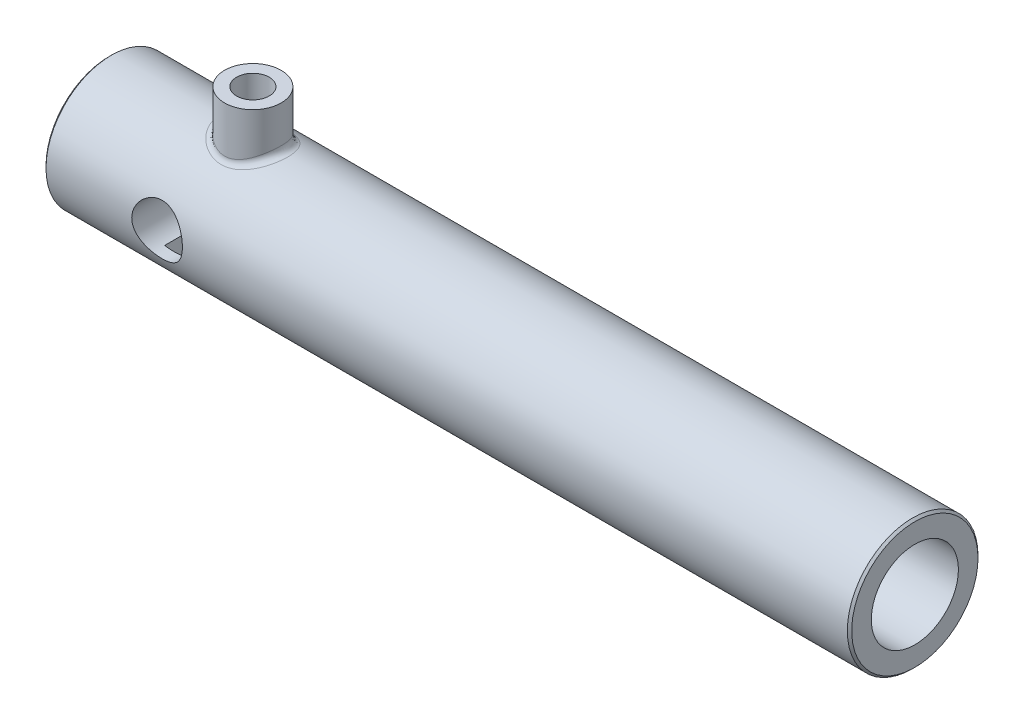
ISO-10303-21;
HEADER;
FILE_DESCRIPTION(('STEP AP214'),'2;1');
FILE_NAME('part.step','',(''),(''),'','','');
FILE_SCHEMA(('AUTOMOTIVE_DESIGN { 1 0 10303 214 1 1 1 1 }'));
ENDSEC;
DATA;
#1=APPLICATION_CONTEXT('core data for automotive mechanical design processes');
#2=APPLICATION_PROTOCOL_DEFINITION('international standard','automotive_design',2000,#1);
#3=PRODUCT_CONTEXT('',#1,'mechanical');
#4=PRODUCT('Part','Part','',(#3));
#5=PRODUCT_RELATED_PRODUCT_CATEGORY('part','',(#4));
#6=PRODUCT_DEFINITION_FORMATION('','',#4);
#7=PRODUCT_DEFINITION_CONTEXT('part definition',#1,'design');
#8=PRODUCT_DEFINITION('design','',#6,#7);
#9=PRODUCT_DEFINITION_SHAPE('','',#8);
#10=(LENGTH_UNIT() NAMED_UNIT(*) SI_UNIT(.MILLI.,.METRE.));
#11=(NAMED_UNIT(*) PLANE_ANGLE_UNIT() SI_UNIT($,.RADIAN.));
#12=(NAMED_UNIT(*) SI_UNIT($,.STERADIAN.) SOLID_ANGLE_UNIT());
#13=UNCERTAINTY_MEASURE_WITH_UNIT(LENGTH_MEASURE(1.E-05),#10,'distance_accuracy_value','');
#14=(GEOMETRIC_REPRESENTATION_CONTEXT(3) GLOBAL_UNCERTAINTY_ASSIGNED_CONTEXT((#13)) GLOBAL_UNIT_ASSIGNED_CONTEXT((#10,
#11,#12)) REPRESENTATION_CONTEXT('',''));
#15=CARTESIAN_POINT('',(0.,0.,0.));
#16=DIRECTION('',(0.,0.,1.));
#17=DIRECTION('',(1.,0.,0.));
#18=AXIS2_PLACEMENT_3D('',#15,#16,#17);
#19=CARTESIAN_POINT('',(320.,0.,0.));
#20=DIRECTION('',(-1.,0.,0.));
#21=DIRECTION('',(0.,0.,1.));
#22=AXIS2_PLACEMENT_3D('',#19,#20,#21);
#23=CYLINDRICAL_SURFACE('',#22,30.);
#24=CARTESIAN_POINT('',(10.006404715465,26.7977398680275,-13.4863315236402));
#25=CARTESIAN_POINT('',(10.7995862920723,27.5860929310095,-11.9198506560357));
#26=CARTESIAN_POINT('',(11.1301934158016,29.477483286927,-12.0534220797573));
#27=CARTESIAN_POINT('',(10.4318607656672,26.7190979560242,-13.6425965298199));
#28=CARTESIAN_POINT('',(11.1620944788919,27.518264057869,-12.0773010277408));
#29=CARTESIAN_POINT('',(11.4758771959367,29.3909772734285,-12.1930840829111));
#30=CARTESIAN_POINT('',(10.86597230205,26.6468962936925,-13.7826762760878));
#31=CARTESIAN_POINT('',(11.5352823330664,27.4552645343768,-12.2197453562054));
#32=CARTESIAN_POINT('',(11.8285935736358,29.3115555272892,-12.3182804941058));
#33=CARTESIAN_POINT('',(11.7484896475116,26.5181419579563,-14.0288089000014));
#34=CARTESIAN_POINT('',(12.296516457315,27.3425800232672,-12.4703362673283));
#35=CARTESIAN_POINT('',(12.5456404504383,29.1699259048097,-12.538261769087));
#36=CARTESIAN_POINT('',(12.1968953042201,26.4615891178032,-14.134862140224));
#37=CARTESIAN_POINT('',(12.6850140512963,27.2927441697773,-12.5788437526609));
#38=CARTESIAN_POINT('',(12.9099708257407,29.1077178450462,-12.633046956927));
#39=CARTESIAN_POINT('',(13.1038768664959,26.366543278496,-14.3113753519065));
#40=CARTESIAN_POINT('',(13.4724334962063,27.2088772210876,-12.7594716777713));
#41=CARTESIAN_POINT('',(13.6468949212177,29.0031675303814,-12.7908058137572));
#42=CARTESIAN_POINT('',(13.5624408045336,26.328030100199,-14.3818751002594));
#43=CARTESIAN_POINT('',(13.8718989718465,27.1747031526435,-12.8319118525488));
#44=CARTESIAN_POINT('',(14.0194789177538,28.9608030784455,-12.8538150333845));
#45=CARTESIAN_POINT('',(14.4860504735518,26.2706902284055,-14.4863534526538));
#46=CARTESIAN_POINT('',(14.6771217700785,27.1238391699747,-12.9391763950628));
#47=CARTESIAN_POINT('',(14.7699133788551,28.8977292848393,-12.9471926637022));
#48=CARTESIAN_POINT('',(14.9510955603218,26.2518615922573,-14.5203356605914));
#49=CARTESIAN_POINT('',(15.0835144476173,27.1070656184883,-12.9741789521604));
#50=CARTESIAN_POINT('',(15.1477633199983,28.8770178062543,-12.9775642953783));
#51=CARTESIAN_POINT('',(15.82846480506,26.2357504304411,-14.5494184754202));
#52=CARTESIAN_POINT('',(15.849978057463,27.0927352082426,-13.0040890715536));
#53=CARTESIAN_POINT('',(15.8606273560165,28.8592955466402,-13.0035570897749));
#54=CARTESIAN_POINT('',(16.2405823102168,26.2362020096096,-14.5486080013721));
#55=CARTESIAN_POINT('',(16.2103665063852,27.0931384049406,-13.0032528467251));
#56=CARTESIAN_POINT('',(16.1954735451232,28.8597922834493,-13.0028327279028));
#57=CARTESIAN_POINT('',(17.0630353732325,26.2530859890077,-14.5181194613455));
#58=CARTESIAN_POINT('',(16.9287941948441,27.108153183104,-12.9719022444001));
#59=CARTESIAN_POINT('',(16.8637180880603,28.878364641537,-12.9755835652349));
#60=CARTESIAN_POINT('',(17.4733713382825,26.2695145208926,-14.4884483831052));
#61=CARTESIAN_POINT('',(17.2872981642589,27.122780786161,-12.9413544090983));
#62=CARTESIAN_POINT('',(17.1971167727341,28.896436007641,-12.9490650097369));
#63=CARTESIAN_POINT('',(18.2891582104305,26.3177519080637,-14.4006396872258));
#64=CARTESIAN_POINT('',(17.9986652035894,27.1655821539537,-12.8511885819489));
#65=CARTESIAN_POINT('',(17.8599450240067,28.9494970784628,-12.8705859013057));
#66=CARTESIAN_POINT('',(18.6946097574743,26.3495587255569,-14.3425058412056));
#67=CARTESIAN_POINT('',(18.3519687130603,27.1938079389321,-12.7914600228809));
#68=CARTESIAN_POINT('',(18.1893751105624,28.9844845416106,-12.8186287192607));
#69=CARTESIAN_POINT('',(19.4980630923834,26.4274674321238,-14.1984386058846));
#70=CARTESIAN_POINT('',(19.0501686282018,27.2626361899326,-12.6439244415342));
#71=CARTESIAN_POINT('',(18.8421823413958,29.0701840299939,-12.6898684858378));
#72=CARTESIAN_POINT('',(19.8960597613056,26.4735787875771,-14.1124868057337));
#73=CARTESIAN_POINT('',(19.3954536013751,27.3033283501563,-12.5559191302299));
#74=CARTESIAN_POINT('',(19.1655553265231,29.1209064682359,-12.6130489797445));
#75=CARTESIAN_POINT('',(20.6697172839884,26.5769569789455,-13.9167955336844));
#76=CARTESIAN_POINT('',(20.0642215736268,27.3940515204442,-12.3563496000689));
#77=CARTESIAN_POINT('',(19.7941534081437,29.2346223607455,-12.4381497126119));
#78=CARTESIAN_POINT('',(21.0456889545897,26.6338393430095,-13.8078643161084));
#79=CARTESIAN_POINT('',(20.3884007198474,27.4438567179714,-12.2453606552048));
#80=CARTESIAN_POINT('',(20.0996310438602,29.297192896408,-12.340792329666));
#81=CARTESIAN_POINT('',(21.7860813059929,26.757974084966,-13.5657408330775));
#82=CARTESIAN_POINT('',(21.0241215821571,27.5518720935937,-11.9997383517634));
#83=CARTESIAN_POINT('',(20.7012011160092,29.4337409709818,-12.1243942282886));
#84=CARTESIAN_POINT('',(22.1504971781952,26.8252307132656,-13.4325386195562));
#85=CARTESIAN_POINT('',(21.3358977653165,27.6101828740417,-11.8648501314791));
#86=CARTESIAN_POINT('',(20.9972896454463,29.5077231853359,-12.0053446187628));
#87=CARTESIAN_POINT('',(22.8660045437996,26.9683134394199,-13.1429125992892));
#88=CARTESIAN_POINT('',(21.9449914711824,27.7333418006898,-11.5730252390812));
#89=CARTESIAN_POINT('',(21.5786406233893,29.6651140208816,-11.7464910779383));
#90=CARTESIAN_POINT('',(23.2170916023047,27.0441423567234,-12.9864811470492));
#91=CARTESIAN_POINT('',(22.2424751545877,27.7982864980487,-11.4158161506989));
#92=CARTESIAN_POINT('',(21.8638994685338,29.7485257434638,-11.6066803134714));
#93=CARTESIAN_POINT('',(23.9043585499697,27.2024707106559,-12.6514784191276));
#94=CARTESIAN_POINT('',(22.8214164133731,27.9327756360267,-11.0810613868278));
#95=CARTESIAN_POINT('',(22.4223050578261,29.9226867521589,-11.3072712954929));
#96=CARTESIAN_POINT('',(24.2405370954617,27.2849707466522,-12.4729051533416));
#97=CARTESIAN_POINT('',(23.1029730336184,28.0024037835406,-10.9032425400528));
#98=CARTESIAN_POINT('',(22.6954507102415,30.0134366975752,-11.1476712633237));
#99=CARTESIAN_POINT('',(24.9316537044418,27.4637858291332,-12.0744804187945));
#100=CARTESIAN_POINT('',(23.6781531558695,28.1519793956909,-10.5088779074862));
#101=CARTESIAN_POINT('',(23.2569841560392,30.2101330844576,-10.7915787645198));
#102=CARTESIAN_POINT('',(25.2847726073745,27.5606361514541,-11.8522579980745));
#103=CARTESIAN_POINT('',(23.9696359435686,28.2322504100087,-10.2900670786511));
#104=CARTESIAN_POINT('',(23.5438938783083,30.3166683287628,-10.5929672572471));
#105=CARTESIAN_POINT('',(25.9692048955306,27.7575170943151,-11.3835316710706));
#106=CARTESIAN_POINT('',(24.5297861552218,28.393516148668,-9.83229579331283));
#107=CARTESIAN_POINT('',(24.0999963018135,30.533237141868,-10.1740426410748));
#108=CARTESIAN_POINT('',(26.3005388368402,27.8575445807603,-11.1370512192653));
#109=CARTESIAN_POINT('',(24.798418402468,28.474563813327,-9.59302855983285));
#110=CARTESIAN_POINT('',(24.3692057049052,30.6432672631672,-9.95375049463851));
#111=CARTESIAN_POINT('',(26.9405737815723,28.0584790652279,-10.6206669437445));
#112=CARTESIAN_POINT('',(25.3123394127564,28.635244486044,-9.09631081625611));
#113=CARTESIAN_POINT('',(24.8892352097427,30.8642949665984,-9.49223153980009));
#114=CARTESIAN_POINT('',(27.2492535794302,28.1593867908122,-10.350741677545));
#115=CARTESIAN_POINT('',(25.5574517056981,28.7148880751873,-8.83857551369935));
#116=CARTESIAN_POINT('',(25.1400380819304,30.9752933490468,-9.25098556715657));
#117=CARTESIAN_POINT('',(27.8422092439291,28.359600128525,-9.78887394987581));
#118=CARTESIAN_POINT('',(26.0232451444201,28.8706302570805,-8.30747567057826));
#119=CARTESIAN_POINT('',(25.6218155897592,31.1955277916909,-8.74881573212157));
#120=CARTESIAN_POINT('',(28.1264780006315,28.4589052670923,-9.49692512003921));
#121=CARTESIAN_POINT('',(26.2436833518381,28.9466981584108,-8.033912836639));
#122=CARTESIAN_POINT('',(25.8527844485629,31.30476333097,-8.4878861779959));
#123=CARTESIAN_POINT('',(28.6910209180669,28.6614647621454,-8.86782338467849));
#124=CARTESIAN_POINT('',(26.6765064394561,29.0994875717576,-7.45064210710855));
#125=CARTESIAN_POINT('',(26.31147655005,31.5275785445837,-7.92562588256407));
#126=CARTESIAN_POINT('',(28.9690933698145,28.764384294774,-8.52892499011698));
#127=CARTESIAN_POINT('',(26.8862095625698,29.1756039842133,-7.13995684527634));
#128=CARTESIAN_POINT('',(26.5374109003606,31.6407899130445,-7.62273510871));
#129=CARTESIAN_POINT('',(29.4926993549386,28.9627465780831,-7.82889763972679));
#130=CARTESIAN_POINT('',(27.2757623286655,29.3196646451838,-6.50637794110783));
#131=CARTESIAN_POINT('',(26.9628416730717,31.8589881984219,-6.99708497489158));
#132=CARTESIAN_POINT('',(29.7382343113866,29.0581896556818,-7.46776965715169));
#133=CARTESIAN_POINT('',(27.4551631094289,29.3874757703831,-6.18351791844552));
#134=CARTESIAN_POINT('',(27.1623392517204,31.9639754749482,-6.67432648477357));
#135=CARTESIAN_POINT('',(30.1945957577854,29.2389040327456,-6.72549872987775));
#136=CARTESIAN_POINT('',(27.7840066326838,29.5135019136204,-5.52862897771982));
#137=CARTESIAN_POINT('',(27.5331337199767,32.1627610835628,-6.01092111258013));
#138=CARTESIAN_POINT('',(30.4054314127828,29.324178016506,-6.34436110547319));
#139=CARTESIAN_POINT('',(27.9329751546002,29.5715553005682,-5.19681018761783));
#140=CARTESIAN_POINT('',(27.7044380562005,32.2565623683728,-5.67027898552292));
#141=CARTESIAN_POINT('',(30.7903249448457,29.4821030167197,-5.56451420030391));
#142=CARTESIAN_POINT('',(28.2013094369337,29.6771466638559,-4.52664913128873));
#143=CARTESIAN_POINT('',(28.0171647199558,32.4302796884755,-4.97329004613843));
#144=CARTESIAN_POINT('',(30.9643853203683,29.5547548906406,-5.16580611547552));
#145=CARTESIAN_POINT('',(28.3202009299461,29.7245091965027,-4.18869750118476));
#146=CARTESIAN_POINT('',(28.158589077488,32.5101966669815,-4.61694430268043));
#147=CARTESIAN_POINT('',(31.2660703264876,29.6820199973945,-4.37384337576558));
#148=CARTESIAN_POINT('',(28.5238158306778,29.8061421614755,-3.52546631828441));
#149=CARTESIAN_POINT('',(28.4037086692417,32.6501881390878,-3.90912682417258));
#150=CARTESIAN_POINT('',(31.3955639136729,29.7373469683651,-3.98129208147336));
#151=CARTESIAN_POINT('',(28.6095976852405,29.8408122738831,-3.20075072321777));
#152=CARTESIAN_POINT('',(28.5089224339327,32.711047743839,-3.55828371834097));
#153=CARTESIAN_POINT('',(31.6179721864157,29.8330410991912,-3.18591556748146));
#154=CARTESIAN_POINT('',(28.7556607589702,29.9000660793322,-2.54891802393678));
#155=CARTESIAN_POINT('',(28.6896295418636,32.8163111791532,-2.84741517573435));
#156=CARTESIAN_POINT('',(31.7108879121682,29.8734086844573,-2.78309064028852));
#157=CARTESIAN_POINT('',(28.8156408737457,29.9245292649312,-2.22240633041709));
#158=CARTESIAN_POINT('',(28.7651237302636,32.860715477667,-2.48739000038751));
#159=CARTESIAN_POINT('',(31.8589012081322,29.9379746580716,-1.97068919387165));
#160=CARTESIAN_POINT('',(28.9107328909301,29.9633862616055,-1.56809514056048));
#161=CARTESIAN_POINT('',(28.8853847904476,32.9317379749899,-1.76130540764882));
#162=CARTESIAN_POINT('',(31.914020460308,29.9621823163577,-1.56111668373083));
#163=CARTESIAN_POINT('',(28.9456481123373,29.9777000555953,-1.24099273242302));
#164=CARTESIAN_POINT('',(28.930169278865,32.9583663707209,-1.39524957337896));
#165=CARTESIAN_POINT('',(31.9857685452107,29.9937305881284,-0.738558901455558));
#166=CARTESIAN_POINT('',(28.9911024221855,29.9963438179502,-0.585799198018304));
#167=CARTESIAN_POINT('',(28.9884647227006,32.9930694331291,-0.66008774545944));
#168=CARTESIAN_POINT('',(32.0024002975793,30.0010724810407,-0.325573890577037));
#169=CARTESIAN_POINT('',(29.0015382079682,30.0006314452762,-0.258461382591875));
#170=CARTESIAN_POINT('',(29.0019780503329,33.0011455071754,-0.290981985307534));
#171=CARTESIAN_POINT('',(31.9972019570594,29.9987823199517,0.462709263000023));
#172=CARTESIAN_POINT('',(28.998254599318,29.9992834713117,0.367263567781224));
#173=CARTESIAN_POINT('',(28.9977543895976,32.9986263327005,0.41354685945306));
#174=CARTESIAN_POINT('',(31.9787178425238,29.990626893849,0.838034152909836));
#175=CARTESIAN_POINT('',(28.9866420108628,29.994513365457,0.664976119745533));
#176=CARTESIAN_POINT('',(28.9827360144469,32.989655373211,0.748993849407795));
#177=CARTESIAN_POINT('',(31.9099574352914,29.9603997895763,1.58568192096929));
#178=CARTESIAN_POINT('',(28.9430624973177,29.9766406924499,1.26072694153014));
#179=CARTESIAN_POINT('',(28.926868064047,32.9564055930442,1.41720477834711));
#180=CARTESIAN_POINT('',(31.8596833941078,29.9383290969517,1.95800500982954));
#181=CARTESIAN_POINT('',(28.9111802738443,29.9635728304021,1.55820058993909));
#182=CARTESIAN_POINT('',(28.8860203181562,32.9321278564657,1.74996890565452));
#183=CARTESIAN_POINT('',(31.7279124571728,29.8808235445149,2.69698986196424));
#184=CARTESIAN_POINT('',(28.8265858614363,29.9289983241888,2.15303442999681));
#185=CARTESIAN_POINT('',(28.7789562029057,32.8688718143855,2.41043734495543));
#186=CARTESIAN_POINT('',(31.6464159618,29.8453888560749,3.06365169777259));
#187=CARTESIAN_POINT('',(28.7740295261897,29.9075550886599,2.44986879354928));
#188=CARTESIAN_POINT('',(28.7127401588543,32.8298936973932,2.73814172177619));
#189=CARTESIAN_POINT('',(31.4530715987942,29.7620208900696,3.78884444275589));
#190=CARTESIAN_POINT('',(28.6474694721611,29.856152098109,3.04264810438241));
#191=CARTESIAN_POINT('',(28.5556475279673,32.7381890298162,3.38628345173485));
#192=CARTESIAN_POINT('',(31.3412229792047,29.7140873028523,4.14737515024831));
#193=CARTESIAN_POINT('',(28.5736836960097,29.8262797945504,3.33812839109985));
#194=CARTESIAN_POINT('',(28.4647703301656,32.6854621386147,3.70672062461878));
#195=CARTESIAN_POINT('',(31.0889175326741,29.6071256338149,4.85227477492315));
#196=CARTESIAN_POINT('',(28.4044607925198,29.7582262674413,3.92554195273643));
#197=CARTESIAN_POINT('',(28.2597717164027,32.5678044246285,4.33672535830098));
#198=CARTESIAN_POINT('',(30.948606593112,29.5481542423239,5.19869555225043));
#199=CARTESIAN_POINT('',(28.3094009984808,29.7201920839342,4.21709540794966));
#200=CARTESIAN_POINT('',(28.1457688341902,32.502935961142,4.64633926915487));
#201=CARTESIAN_POINT('',(30.6402365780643,29.4202762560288,5.87940015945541));
#202=CARTESIAN_POINT('',(28.0968928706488,29.6359492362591,4.79669566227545));
#203=CARTESIAN_POINT('',(27.8952176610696,32.3622703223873,5.25471968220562));
#204=CARTESIAN_POINT('',(30.4721677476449,29.3513661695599,6.21367967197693));
#205=CARTESIAN_POINT('',(27.9797315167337,29.5898489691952,5.08445431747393));
#206=CARTESIAN_POINT('',(27.7586614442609,32.2864693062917,5.55348232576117));
#207=CARTESIAN_POINT('',(30.1096712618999,29.2051366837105,6.86821520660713));
#208=CARTESIAN_POINT('',(27.7227302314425,29.4899567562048,5.65451008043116));
#209=CARTESIAN_POINT('',(27.464132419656,32.1256170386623,6.13847410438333));
#210=CARTESIAN_POINT('',(29.9152486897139,29.1278189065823,7.18847391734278));
#211=CARTESIAN_POINT('',(27.5832029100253,29.4362761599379,5.93661808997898));
#212=CARTESIAN_POINT('',(27.3061637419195,32.0405675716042,6.42470564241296));
#213=CARTESIAN_POINT('',(29.5013729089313,28.9663974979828,7.81359328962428));
#214=CARTESIAN_POINT('',(27.2814153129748,29.3219987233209,6.49339598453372));
#215=CARTESIAN_POINT('',(26.9698889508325,31.8630042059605,6.98340669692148));
#216=CARTESIAN_POINT('',(29.2819106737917,28.8822914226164,8.11844834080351));
#217=CARTESIAN_POINT('',(27.1194472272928,29.261497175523,6.76797478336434));
#218=CARTESIAN_POINT('',(26.7915755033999,31.7704876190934,7.2558711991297));
#219=CARTESIAN_POINT('',(28.5497775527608,28.6080506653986,9.05678838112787));
#220=CARTESIAN_POINT('',(26.5739779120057,29.0616427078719,7.61724881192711));
#221=CARTESIAN_POINT('',(26.1967160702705,31.4688230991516,8.09451353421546));
#222=CARTESIAN_POINT('',(27.9931356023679,28.4084434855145,9.65979496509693));
#223=CARTESIAN_POINT('',(26.1473625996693,28.9105907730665,8.17981074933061));
#224=CARTESIAN_POINT('',(25.7444435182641,31.2492554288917,8.63345126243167));
#225=CARTESIAN_POINT('',(26.7809613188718,28.0040194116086,10.7763013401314));
#226=CARTESIAN_POINT('',(25.1911588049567,28.5943684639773,9.23856299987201));
#227=CARTESIAN_POINT('',(24.7595498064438,30.8043894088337,9.63132993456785));
#228=CARTESIAN_POINT('',(26.1253195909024,27.7991969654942,11.2897007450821));
#229=CARTESIAN_POINT('',(24.6632661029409,28.4293682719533,9.73641026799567));
#230=CARTESIAN_POINT('',(24.2268397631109,30.5790849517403,10.0901811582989));
#231=CARTESIAN_POINT('',(25.051971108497,27.4962318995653,12.0012710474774));
#232=CARTESIAN_POINT('',(23.7780669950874,28.1791073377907,10.4362646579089));
#233=CARTESIAN_POINT('',(23.3547422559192,30.2458237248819,10.7261478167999));
#234=CARTESIAN_POINT('',(24.6644651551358,27.3925626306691,12.2354158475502));
#235=CARTESIAN_POINT('',(23.4569400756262,28.0927380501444,10.6675809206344));
#236=CARTESIAN_POINT('',(23.0398929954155,30.1317876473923,10.9354149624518));
#237=CARTESIAN_POINT('',(23.8667804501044,27.1929143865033,12.6729301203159));
#238=CARTESIAN_POINT('',(22.7906257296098,27.92493993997,11.1018569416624));
#239=CARTESIAN_POINT('',(22.3917727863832,29.9121748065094,11.3264437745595));
#240=CARTESIAN_POINT('',(23.456611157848,27.0969322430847,12.8763123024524));
#241=CARTESIAN_POINT('',(22.445361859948,27.843386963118,11.3052865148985));
#242=CARTESIAN_POINT('',(22.0585095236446,29.8065945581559,11.508216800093));
#243=CARTESIAN_POINT('',(22.6167985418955,26.9161020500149,13.2501517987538));
#244=CARTESIAN_POINT('',(21.7339940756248,27.6887115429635,11.6804887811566));
#245=CARTESIAN_POINT('',(21.376160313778,29.6076815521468,11.8423362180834));
#246=CARTESIAN_POINT('',(22.1871990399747,26.8312304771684,13.4206790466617));
#247=CARTESIAN_POINT('',(21.367709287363,27.6154188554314,11.8527876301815));
#248=CARTESIAN_POINT('',(21.0271099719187,29.5143229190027,11.9947451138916));
#249=CARTESIAN_POINT('',(21.3106788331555,26.6755755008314,13.7274647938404));
#250=CARTESIAN_POINT('',(20.6169003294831,27.4803854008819,12.16341925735));
#251=CARTESIAN_POINT('',(20.3149357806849,29.3431026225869,12.2689351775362));
#252=CARTESIAN_POINT('',(20.8637686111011,26.6047837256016,13.863743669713));
#253=CARTESIAN_POINT('',(20.2320135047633,27.4184717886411,12.3022032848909));
#254=CARTESIAN_POINT('',(19.9518204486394,29.2652317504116,12.3907345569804));
#255=CARTESIAN_POINT('',(20.0211793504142,26.4890874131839,14.083371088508));
#256=CARTESIAN_POINT('',(19.5038061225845,27.3169748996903,12.5261730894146));
#257=CARTESIAN_POINT('',(19.2672152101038,29.1379659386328,12.5870267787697));
#258=CARTESIAN_POINT('',(19.6273810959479,26.4419236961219,14.1715141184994));
#259=CARTESIAN_POINT('',(19.1623618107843,27.2753856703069,12.6163780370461));
#260=CARTESIAN_POINT('',(18.9472534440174,29.0860859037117,12.6658046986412));
#261=CARTESIAN_POINT('',(18.8318037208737,26.3614963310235,14.3205695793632));
#262=CARTESIAN_POINT('',(18.4713435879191,27.2043764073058,12.7689624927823));
#263=CARTESIAN_POINT('',(18.3008454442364,28.9976158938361,12.7990231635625));
#264=CARTESIAN_POINT('',(18.4300233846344,26.3282348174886,14.3814778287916));
#265=CARTESIAN_POINT('',(18.1213885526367,27.174876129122,12.8315197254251));
#266=CARTESIAN_POINT('',(17.9743982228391,28.9610282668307,12.8534599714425));
#267=CARTESIAN_POINT('',(17.623808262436,26.2769202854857,14.4750232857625));
#268=CARTESIAN_POINT('',(17.4185872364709,27.1293621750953,12.9275535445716));
#269=CARTESIAN_POINT('',(17.3193470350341,28.9045823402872,12.9370663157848));
#270=CARTESIAN_POINT('',(17.2194042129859,26.2587765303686,14.5078291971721));
#271=CARTESIAN_POINT('',(17.0653561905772,27.1132128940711,12.9613213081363));
#272=CARTESIAN_POINT('',(16.9907680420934,28.8846242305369,12.9663866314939));
#273=CARTESIAN_POINT('',(16.4083990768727,26.2379924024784,14.5453849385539));
#274=CARTESIAN_POINT('',(16.357021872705,27.0947334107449,12.9999338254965));
#275=CARTESIAN_POINT('',(16.3318249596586,28.8617617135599,12.9999521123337));
#276=CARTESIAN_POINT('',(16.0017973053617,26.2353571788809,14.5501254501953));
#277=CARTESIAN_POINT('',(16.0014736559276,27.0923845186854,13.0048176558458));
#278=CARTESIAN_POINT('',(16.0014603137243,28.8588629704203,13.004188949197));
#279=CARTESIAN_POINT('',(15.1891398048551,26.2457046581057,14.5314520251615));
#280=CARTESIAN_POINT('',(15.2914999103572,27.1015878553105,12.9856145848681));
#281=CARTESIAN_POINT('',(15.3411746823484,28.8702451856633,12.9874995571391));
#282=CARTESIAN_POINT('',(14.7830852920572,26.2587058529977,14.5080047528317));
#283=CARTESIAN_POINT('',(14.9366268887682,27.1131682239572,12.9614690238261));
#284=CARTESIAN_POINT('',(15.0112546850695,28.8845464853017,12.966543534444));
#285=CARTESIAN_POINT('',(13.9750834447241,26.2998938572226,14.4332045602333));
#286=CARTESIAN_POINT('',(14.2316877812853,27.1497384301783,12.8846298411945));
#287=CARTESIAN_POINT('',(14.3547517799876,28.9298532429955,12.8996907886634));
#288=CARTESIAN_POINT('',(13.5731358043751,26.3280795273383,14.3818537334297));
#289=CARTESIAN_POINT('',(13.8811903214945,27.1747725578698,12.831842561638));
#290=CARTESIAN_POINT('',(14.0281686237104,28.9608574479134,12.8537959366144));
#291=CARTESIAN_POINT('',(12.7774248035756,26.3985543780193,14.2520785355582));
#292=CARTESIAN_POINT('',(13.1890822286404,27.237105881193,12.6988475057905));
#293=CARTESIAN_POINT('',(13.3816520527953,29.0383797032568,12.7378092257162));
#294=CARTESIAN_POINT('',(12.3836396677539,26.4407988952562,14.1737398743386));
#295=CARTESIAN_POINT('',(12.8470551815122,27.2744392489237,12.6185671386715));
#296=CARTESIAN_POINT('',(13.0617009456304,29.0848486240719,12.6677939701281));
#297=CARTESIAN_POINT('',(11.6054791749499,26.5380414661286,13.9908207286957));
#298=CARTESIAN_POINT('',(12.1733986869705,27.3599363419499,12.4318025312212));
#299=CARTESIAN_POINT('',(12.429444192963,29.1918153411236,12.5043098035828));
#300=CARTESIAN_POINT('',(11.2211040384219,26.5930398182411,13.8862396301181));
#301=CARTESIAN_POINT('',(11.841436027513,27.4081921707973,12.325106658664));
#302=CARTESIAN_POINT('',(12.1171387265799,29.2523134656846,12.4108403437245));
#303=CARTESIAN_POINT('',(10.4640052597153,26.7141120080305,13.6518714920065));
#304=CARTESIAN_POINT('',(11.1902442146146,27.5137730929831,12.0870276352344));
#305=CARTESIAN_POINT('',(11.5019946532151,29.3854927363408,12.201373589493));
#306=CARTESIAN_POINT('',(10.0912805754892,26.7801848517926,13.5220867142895));
#307=CARTESIAN_POINT('',(10.8707462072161,27.5711984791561,11.9553967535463));
#308=CARTESIAN_POINT('',(11.1991551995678,29.4581727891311,12.0853783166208));
#309=CARTESIAN_POINT('',(9.35917949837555,26.9215744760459,13.2383513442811));
#310=CARTESIAN_POINT('',(10.2462648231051,27.6932110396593,11.6690504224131));
#311=CARTESIAN_POINT('',(10.6043218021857,29.6137012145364,11.8317895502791));
#312=CARTESIAN_POINT('',(8.99980842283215,26.9968948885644,13.0843912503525));
#313=CARTESIAN_POINT('',(9.94109264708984,27.7579011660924,11.5140518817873));
#314=CARTESIAN_POINT('',(10.3123321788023,29.6965535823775,11.694187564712));
#315=CARTESIAN_POINT('',(8.27828453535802,27.1588107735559,12.7450421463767));
#316=CARTESIAN_POINT('',(9.33180185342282,27.8958567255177,11.1742818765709));
#317=CARTESIAN_POINT('',(9.72609276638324,29.8746608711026,11.3908939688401));
#318=CARTESIAN_POINT('',(7.91691705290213,27.2457845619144,12.5584542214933));
#319=CARTESIAN_POINT('',(9.02850247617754,27.9694669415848,10.9881406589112));
#320=CARTESIAN_POINT('',(9.4324810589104,29.970331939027,11.2241308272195));
#321=CARTESIAN_POINT('',(7.21243611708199,27.4254459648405,12.1611038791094));
#322=CARTESIAN_POINT('',(8.44137985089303,28.1200318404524,10.5944388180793));
#323=CARTESIAN_POINT('',(8.86008907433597,30.1679592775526,10.8689985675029));
#324=CARTESIAN_POINT('',(6.86932401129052,27.5181340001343,11.9503396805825));
#325=CARTESIAN_POINT('',(8.15750980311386,28.1970692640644,10.3865543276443));
#326=CARTESIAN_POINT('',(8.58130989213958,30.2699160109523,10.6806278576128));
#327=CARTESIAN_POINT('',(6.20267724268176,27.7069661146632,11.5057537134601));
#328=CARTESIAN_POINT('',(7.61040441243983,28.3522816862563,9.95140202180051));
#329=CARTESIAN_POINT('',(8.03965823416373,30.477631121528,10.2832787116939));
#330=CARTESIAN_POINT('',(5.87915063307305,27.8031115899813,11.2719225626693));
#331=CARTESIAN_POINT('',(7.34721775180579,28.4305098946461,9.7238297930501));
#332=CARTESIAN_POINT('',(7.77679230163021,30.5833910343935,10.0742918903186));
#333=CARTESIAN_POINT('',(5.25317672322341,27.9965812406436,10.7824257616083));
#334=CARTESIAN_POINT('',(6.84262306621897,28.5859835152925,9.25151023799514));
#335=CARTESIAN_POINT('',(7.26818741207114,30.7962074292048,9.63680364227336));
#336=CARTESIAN_POINT('',(4.95073090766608,28.0939054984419,10.5267585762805));
#337=CARTESIAN_POINT('',(6.60133802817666,28.6632473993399,9.00650838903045));
#338=CARTESIAN_POINT('',(7.0224496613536,30.9032640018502,9.40830084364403));
#339=CARTESIAN_POINT('',(4.33661000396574,28.2980766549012,9.96580809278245));
#340=CARTESIAN_POINT('',(6.1161129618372,28.8232095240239,8.47375732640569));
#341=CARTESIAN_POINT('',(6.52347535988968,31.1278520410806,8.90695079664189));
#342=CARTESIAN_POINT('',(4.02750401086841,28.4048089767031,9.65815227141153));
#343=CARTESIAN_POINT('',(5.87528099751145,28.9054657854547,8.1843301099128));
#344=CARTESIAN_POINT('',(6.27232620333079,31.2452574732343,8.63198310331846));
#345=CARTESIAN_POINT('',(3.43887438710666,28.6141243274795,9.01913995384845));
#346=CARTESIAN_POINT('',(5.42231516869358,29.0641107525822,7.59016688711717));
#347=CARTESIAN_POINT('',(5.79406361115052,31.4755041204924,8.06086521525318));
#348=CARTESIAN_POINT('',(3.15934139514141,28.7167086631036,8.68779101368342));
#349=CARTESIAN_POINT('',(5.21052975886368,29.1404242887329,7.2852946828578));
#350=CARTESIAN_POINT('',(5.56694256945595,31.5883467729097,7.764721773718));
#351=CARTESIAN_POINT('',(2.63158056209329,28.9150623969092,8.00289394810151));
#352=CARTESIAN_POINT('',(4.81595701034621,29.285375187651,6.66297756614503));
#353=CARTESIAN_POINT('',(5.13813597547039,31.8065356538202,7.1525943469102));
#354=CARTESIAN_POINT('',(2.38336770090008,29.0108285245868,7.64933532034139));
#355=CARTESIAN_POINT('',(4.6336112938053,29.3538857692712,6.3455346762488));
#356=CARTESIAN_POINT('',(4.93646259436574,31.9118782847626,6.83660097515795));
#357=CARTESIAN_POINT('',(1.92056734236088,29.1928311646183,6.92234951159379));
#358=CARTESIAN_POINT('',(4.29826441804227,29.4817128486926,5.70127408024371));
#359=CARTESIAN_POINT('',(4.56043649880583,32.1120809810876,6.18685669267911));
#360=CARTESIAN_POINT('',(1.70596377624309,29.279072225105,6.54893194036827));
#361=CARTESIAN_POINT('',(4.14571174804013,29.5408791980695,5.37463104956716));
#362=CARTESIAN_POINT('',(4.38607072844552,32.206946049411,5.85311437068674));
#363=CARTESIAN_POINT('',(1.3146424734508,29.4386954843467,5.78896808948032));
#364=CARTESIAN_POINT('',(3.87126503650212,29.6484240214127,4.71845308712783));
#365=CARTESIAN_POINT('',(4.06812148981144,32.3825314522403,5.17389593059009));
#366=CARTESIAN_POINT('',(1.13750574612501,29.5122180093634,5.40262994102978));
#367=CARTESIAN_POINT('',(3.74946365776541,29.6967636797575,4.38929536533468));
#368=CARTESIAN_POINT('',(3.92419759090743,32.4634061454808,4.82860582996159));
#369=CARTESIAN_POINT('',(0.81986195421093,29.6455335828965,4.61537517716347));
#370=CARTESIAN_POINT('',(3.53364936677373,29.7830048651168,3.72649764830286));
#371=CARTESIAN_POINT('',(3.66611145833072,32.6100531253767,4.12499610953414));
#372=CARTESIAN_POINT('',(0.679355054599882,29.7053265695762,4.21445849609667));
#373=CARTESIAN_POINT('',(3.44004924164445,29.8207471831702,3.39335108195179));
#374=CARTESIAN_POINT('',(3.55194935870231,32.6758253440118,3.7666764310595));
#375=CARTESIAN_POINT('',(0.436774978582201,29.8093612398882,3.40144165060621));
#376=CARTESIAN_POINT('',(3.27996603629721,29.8855695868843,2.72450145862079));
#377=CARTESIAN_POINT('',(3.35485262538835,32.7902633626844,3.0400418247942));
#378=CARTESIAN_POINT('',(0.334675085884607,29.8536137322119,2.98934947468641));
#379=CARTESIAN_POINT('',(3.21380669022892,29.9125205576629,2.38943219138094));
#380=CARTESIAN_POINT('',(3.27189628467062,32.8389410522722,2.67173403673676));
#381=CARTESIAN_POINT('',(0.170150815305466,29.9252508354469,2.157236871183));
#382=CARTESIAN_POINT('',(3.10777979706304,29.9558063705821,1.71761833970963));
#383=CARTESIAN_POINT('',(3.13822002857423,32.9177417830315,1.92803257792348));
#384=CARTESIAN_POINT('',(0.1077223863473,29.952637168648,1.73721725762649));
#385=CARTESIAN_POINT('',(3.06815557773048,29.9720424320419,1.38161608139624));
#386=CARTESIAN_POINT('',(3.08749682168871,32.9478667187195,1.55263963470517));
#387=CARTESIAN_POINT('',(0.0274105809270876,29.9879263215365,0.933070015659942));
#388=CARTESIAN_POINT('',(3.01722016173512,29.9929278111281,0.74047970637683));
#389=CARTESIAN_POINT('',(3.02224334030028,32.9866847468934,0.833932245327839));
#390=CARTESIAN_POINT('',(0.00586829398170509,29.9974287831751,0.549310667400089));
#391=CARTESIAN_POINT('',(3.00368004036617,29.9984890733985,0.435999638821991));
#392=CARTESIAN_POINT('',(3.00474019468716,32.9971374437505,0.490946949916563));
#393=CARTESIAN_POINT('',(-0.00373228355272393,30.0016599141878,-0.218621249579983));
#394=CARTESIAN_POINT('',(2.99762312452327,30.0009758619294,-0.173596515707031));
#395=CARTESIAN_POINT('',(2.99693970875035,33.0017916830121,-0.19539295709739));
#396=CARTESIAN_POINT('',(0.00820708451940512,29.9963896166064,-0.602793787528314));
#397=CARTESIAN_POINT('',(3.00511712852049,29.9978969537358,-0.47809323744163));
#398=CARTESIAN_POINT('',(3.0066404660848,32.9959943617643,-0.538747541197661));
#399=CARTESIAN_POINT('',(0.0654184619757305,29.9712170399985,-1.36853872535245));
#400=CARTESIAN_POINT('',(3.04131871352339,29.9830441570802,-1.08747144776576));
#401=CARTESIAN_POINT('',(3.05312480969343,32.9683045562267,-1.22313283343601));
#402=CARTESIAN_POINT('',(0.110686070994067,29.9513166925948,-1.75011146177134));
#403=CARTESIAN_POINT('',(3.06995081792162,29.9713012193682,-1.39174357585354));
#404=CARTESIAN_POINT('',(3.08990482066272,32.9464141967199,-1.56416384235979));
#405=CARTESIAN_POINT('',(0.234010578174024,29.8974083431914,-2.50783541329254));
#406=CARTESIAN_POINT('',(3.14889912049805,29.9390083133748,-2.00030279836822));
#407=CARTESIAN_POINT('',(3.19010619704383,32.8871150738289,-2.24138037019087));
#408=CARTESIAN_POINT('',(0.312067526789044,29.8634003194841,-2.88398662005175));
#409=CARTESIAN_POINT('',(3.19906217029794,29.9185207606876,-2.3040181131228));
#410=CARTESIAN_POINT('',(3.25352760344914,32.8497062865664,-2.57756588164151));
#411=CARTESIAN_POINT('',(0.49660949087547,29.7836531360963,-3.6144133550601));
#412=CARTESIAN_POINT('',(3.31946277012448,29.8695611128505,-2.89952623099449));
#413=CARTESIAN_POINT('',(3.40346826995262,32.7619844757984,-3.23038549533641));
#414=CARTESIAN_POINT('',(0.601938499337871,29.7383934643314,-3.96898379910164));
#415=CARTESIAN_POINT('',(3.38867549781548,29.8414984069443,-3.19082471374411));
#416=CARTESIAN_POINT('',(3.48904827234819,32.7121988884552,-3.5472831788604));
#417=CARTESIAN_POINT('',(0.841198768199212,29.636630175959,-4.66852554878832));
#418=CARTESIAN_POINT('',(3.54843628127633,29.7771220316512,-3.77171878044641));
#419=CARTESIAN_POINT('',(3.68344765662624,32.6002593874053,-4.17249930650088));
#420=CARTESIAN_POINT('',(0.975139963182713,29.5801226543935,-5.01349347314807));
#421=CARTESIAN_POINT('',(3.63874299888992,29.7409034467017,-4.06093237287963));
#422=CARTESIAN_POINT('',(3.79227511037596,32.5381011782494,-4.48081472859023));
#423=CARTESIAN_POINT('',(1.27037541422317,29.4571498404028,-5.69166679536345));
#424=CARTESIAN_POINT('',(3.84117178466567,29.6604158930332,-4.6360546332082));
#425=CARTESIAN_POINT('',(4.03215442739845,32.4028312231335,-5.08693280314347));
#426=CARTESIAN_POINT('',(1.43166317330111,29.3906869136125,-6.0248749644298));
#427=CARTESIAN_POINT('',(3.95300651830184,29.6162561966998,-4.92166772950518));
#428=CARTESIAN_POINT('',(4.16320101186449,32.3297220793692,-5.38473793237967));
#429=CARTESIAN_POINT('',(1.78039277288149,29.2491980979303,-6.67803359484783));
#430=CARTESIAN_POINT('',(4.19889086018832,29.5202793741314,-5.4880378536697));
#431=CARTESIAN_POINT('',(4.44654441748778,32.1740845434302,-5.96849910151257));
#432=CARTESIAN_POINT('',(1.9678447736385,29.1741688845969,-6.9979788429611));
#433=CARTESIAN_POINT('',(4.33265176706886,29.4685665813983,-5.76859169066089));
#434=CARTESIAN_POINT('',(4.59884949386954,32.0915524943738,-6.25445048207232));
#435=CARTESIAN_POINT('',(2.38032086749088,29.0121068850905,-7.6429820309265));
#436=CARTESIAN_POINT('',(4.63166174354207,29.3546727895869,-6.34036340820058));
#437=CARTESIAN_POINT('',(4.93398703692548,31.9132844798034,-6.83092271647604));
#438=CARTESIAN_POINT('',(2.60698051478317,28.9246134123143,-7.96705999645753));
#439=CARTESIAN_POINT('',(4.79812639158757,29.2921129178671,-6.63117312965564));
#440=CARTESIAN_POINT('',(5.11814839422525,31.8170417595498,-7.12056771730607));
#441=CARTESIAN_POINT('',(3.08686422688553,28.7436993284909,-8.59692822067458));
#442=CARTESIAN_POINT('',(5.15623112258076,29.1602201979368,-7.20263096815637));
#443=CARTESIAN_POINT('',(5.50805474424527,31.6180364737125,-7.6835130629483));
#444=CARTESIAN_POINT('',(3.34009744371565,28.6502766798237,-8.9027121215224));
#445=CARTESIAN_POINT('',(5.34755014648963,29.0909808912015,-7.48326434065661));
#446=CARTESIAN_POINT('',(5.71380717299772,31.5152716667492,-7.95680772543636));
#447=CARTESIAN_POINT('',(3.87164964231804,28.4596001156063,-9.49462389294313));
#448=CARTESIAN_POINT('',(5.75495073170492,28.9471949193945,-8.03186781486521));
#449=CARTESIAN_POINT('',(6.14569425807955,31.3055276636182,-8.48582945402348));
#450=CARTESIAN_POINT('',(4.14997844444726,28.3623447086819,-9.78074399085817));
#451=CARTESIAN_POINT('',(5.97075801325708,28.8727108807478,-8.29992670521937));
#452=CARTESIAN_POINT('',(6.37183689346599,31.1985468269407,-8.74154957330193));
#453=CARTESIAN_POINT('',(4.73018138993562,28.1662290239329,-10.3319473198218));
#454=CARTESIAN_POINT('',(6.42635942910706,28.7202298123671,-8.82078717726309));
#455=CARTESIAN_POINT('',(6.84325279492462,30.982819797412,-9.23418809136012));
#456=CARTESIAN_POINT('',(5.03205703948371,28.0673686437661,-10.5970292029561));
#457=CARTESIAN_POINT('',(6.66593321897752,28.6422607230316,-9.07376984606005));
#458=CARTESIAN_POINT('',(7.08852728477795,30.8740734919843,-9.47110528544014));
#459=CARTESIAN_POINT('',(5.68607376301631,27.8614560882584,-11.1277760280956));
#460=CARTESIAN_POINT('',(7.19046014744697,28.4778246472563,-9.58377435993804));
#461=CARTESIAN_POINT('',(7.61991700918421,30.647569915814,-9.94546078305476));
#462=CARTESIAN_POINT('',(6.04029405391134,27.7544661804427,-11.3913523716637));
#463=CARTESIAN_POINT('',(7.47763020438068,28.3911306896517,-9.83967675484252));
#464=CARTESIAN_POINT('',(7.90772161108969,30.5298811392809,-10.1810323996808));
#465=CARTESIAN_POINT('',(6.77303906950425,27.5443554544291,-11.8904071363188));
#466=CARTESIAN_POINT('',(8.07767239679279,28.2189020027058,-10.3272960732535));
#467=CARTESIAN_POINT('',(8.50307820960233,30.2987595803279,-10.6270630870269));
#468=CARTESIAN_POINT('',(7.15155575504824,27.4412333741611,-12.125894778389));
#469=CARTESIAN_POINT('',(8.39046681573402,28.1333009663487,-10.5594177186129));
#470=CARTESIAN_POINT('',(8.81062367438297,30.1853254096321,-10.8375303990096));
#471=CARTESIAN_POINT('',(7.93126297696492,27.2418798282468,-12.5673660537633));
#472=CARTESIAN_POINT('',(9.04008038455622,27.9662993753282,-10.9967264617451));
#473=CARTESIAN_POINT('',(9.44413714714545,29.9660367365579,-11.2320957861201));
#474=CARTESIAN_POINT('',(8.33246496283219,27.1456518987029,-12.7733345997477));
#475=CARTESIAN_POINT('',(9.37697637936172,27.8847890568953,-11.2023392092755));
#476=CARTESIAN_POINT('',(9.77011445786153,29.8601861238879,-11.4161803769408));
#477=CARTESIAN_POINT('',(9.15497060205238,26.9633383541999,-13.1538166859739));
#478=CARTESIAN_POINT('',(10.0721248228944,27.7292834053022,-11.5835308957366));
#479=CARTESIAN_POINT('',(10.4384017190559,29.6596414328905,-11.7562366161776));
#480=CARTESIAN_POINT('',(9.57626408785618,26.8772476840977,-13.3283459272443));
#481=CARTESIAN_POINT('',(10.4305655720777,27.655140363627,-11.7595716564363));
#482=CARTESIAN_POINT('',(10.7807034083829,29.5649417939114,-11.9122222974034));
#483=CARTESIAN_POINT('',(10.006404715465,26.7977398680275,-13.4863315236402));
#484=CARTESIAN_POINT('',(10.7995862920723,27.5860929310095,-11.9198506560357));
#485=CARTESIAN_POINT('',(11.1301934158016,29.477483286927,-12.0534220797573));
#486=(BOUNDED_SURFACE() B_SPLINE_SURFACE(3,2,((#24,#25,#26),(#27,#28,#29),(#30,#31,#32),(#33,
#34,#35),(#36,#37,#38),(#39,#40,#41),(#42,#43,#44),(#45,#46,#47),(#48,#49,#50),(#51,#52,#53),
(#54,#55,#56),(#57,#58,#59),(#60,#61,#62),(#63,#64,#65),(#66,#67,#68),(#69,#70,#71),(#72,#73,
#74),(#75,#76,#77),(#78,#79,#80),(#81,#82,#83),(#84,#85,#86),(#87,#88,#89),(#90,#91,#92),(#93,
#94,#95),(#96,#97,#98),(#99,#100,#101),(#102,#103,#104),(#105,#106,#107),(#108,#109,#110),(#111,
#112,#113),(#114,#115,#116),(#117,#118,#119),(#120,#121,#122),(#123,#124,#125),(#126,#127,#128),
(#129,#130,#131),(#132,#133,#134),(#135,#136,#137),(#138,#139,#140),(#141,#142,#143),(#144,#145,
#146),(#147,#148,#149),(#150,#151,#152),(#153,#154,#155),(#156,#157,#158),(#159,#160,#161),
(#162,#163,#164),(#165,#166,#167),(#168,#169,#170),(#171,#172,#173),(#174,#175,#176),(#177,#178,
#179),(#180,#181,#182),(#183,#184,#185),(#186,#187,#188),(#189,#190,#191),(#192,#193,#194),
(#195,#196,#197),(#198,#199,#200),(#201,#202,#203),(#204,#205,#206),(#207,#208,#209),(#210,#211,
#212),(#213,#214,#215),(#216,#217,#218),(#219,#220,#221),(#222,#223,#224),(#225,#226,#227),
(#228,#229,#230),(#231,#232,#233),(#234,#235,#236),(#237,#238,#239),(#240,#241,#242),(#243,#244,
#245),(#246,#247,#248),(#249,#250,#251),(#252,#253,#254),(#255,#256,#257),(#258,#259,#260),
(#261,#262,#263),(#264,#265,#266),(#267,#268,#269),(#270,#271,#272),(#273,#274,#275),(#276,#277,
#278),(#279,#280,#281),(#282,#283,#284),(#285,#286,#287),(#288,#289,#290),(#291,#292,#293),
(#294,#295,#296),(#297,#298,#299),(#300,#301,#302),(#303,#304,#305),(#306,#307,#308),(#309,#310,
#311),(#312,#313,#314),(#315,#316,#317),(#318,#319,#320),(#321,#322,#323),(#324,#325,#326),
(#327,#328,#329),(#330,#331,#332),(#333,#334,#335),(#336,#337,#338),(#339,#340,#341),(#342,#343,
#344),(#345,#346,#347),(#348,#349,#350),(#351,#352,#353),(#354,#355,#356),(#357,#358,#359),
(#360,#361,#362),(#363,#364,#365),(#366,#367,#368),(#369,#370,#371),(#372,#373,#374),(#375,#376,
#377),(#378,#379,#380),(#381,#382,#383),(#384,#385,#386),(#387,#388,#389),(#390,#391,#392),
(#393,#394,#395),(#396,#397,#398),(#399,#400,#401),(#402,#403,#404),(#405,#406,#407),(#408,#409,
#410),(#411,#412,#413),(#414,#415,#416),(#417,#418,#419),(#420,#421,#422),(#423,#424,#425),
(#426,#427,#428),(#429,#430,#431),(#432,#433,#434),(#435,#436,#437),(#438,#439,#440),(#441,#442,
#443),(#444,#445,#446),(#447,#448,#449),(#450,#451,#452),(#453,#454,#455),(#456,#457,#458),
(#459,#460,#461),(#462,#463,#464),(#465,#466,#467),(#468,#469,#470),(#471,#472,#473),(#474,#475,
#476),(#477,#478,#479),(#480,#481,#482),(#483,#484,#485)),.UNSPECIFIED.,.T.,.F.,
.F.) B_SPLINE_SURFACE_WITH_KNOTS((4,2,2,2,2,2,2,2,2,2,2,2,2,2,2,2,2,2,2,2,2,2,2,2,2,2,2,2,2,2,2,
2,2,2,2,2,2,2,2,2,2,2,2,2,2,2,2,2,2,2,2,2,2,2,2,2,2,2,2,2,2,2,2,2,2,2,2,2,2,2,2,2,2,2,2,2,4),(3,
3),(0.,1.40037435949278,2.80073379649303,4.19952303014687,5.59817420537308,6.83295912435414,
8.06744515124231,9.30176763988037,10.5369087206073,11.7342600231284,12.9321031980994,
14.1303414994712,15.3286875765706,16.65474880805,17.9795402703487,19.305556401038,
20.6319574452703,22.0661425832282,23.5002649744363,24.9340079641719,26.367653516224,
27.730486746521,29.0932812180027,30.4552932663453,31.8172019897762,33.0558042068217,
34.2943187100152,35.532817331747,36.7713466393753,38.0036812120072,39.236449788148,
40.4689809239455,41.7019577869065,44.3699798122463,47.0409718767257,48.4766311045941,
49.9116955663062,51.3436708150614,52.774792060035,53.9999992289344,55.2253944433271,
56.4433807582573,57.6617714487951,58.8816044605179,60.101345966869,61.3172489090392,
62.5331803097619,63.7490026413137,64.9653040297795,66.2433659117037,67.521522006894,
68.8002001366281,70.0789682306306,71.4967092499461,72.914000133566,74.3319663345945,
75.7492525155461,77.1497361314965,78.5502260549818,79.9497399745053,81.3491109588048,
82.6159462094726,83.8826928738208,85.1492723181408,86.4158537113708,87.6356712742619,
88.8559130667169,90.0758653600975,91.2962927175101,92.5947146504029,93.8935852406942,
95.192966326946,96.4924305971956,97.9086786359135,99.3244604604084,100.740963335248,
102.156756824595),(0.,1.),
.UNSPECIFIED.) GEOMETRIC_REPRESENTATION_ITEM() RATIONAL_B_SPLINE_SURFACE(((1.,0.841668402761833,
1.),(1.,0.844537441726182,1.),(1.,0.847144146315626,1.),(1.,0.851760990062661,1.),(1.,
0.853771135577,1.),(1.,0.857133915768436,1.),(1.,0.85848728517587,1.),(1.,0.860497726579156,1.),
(1.,0.86115486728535,1.),(1.,0.861717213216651,1.),(1.,0.861701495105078,1.),(1.,
0.861112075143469,1.),(1.,0.860538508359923,1.),(1.,0.8588479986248,1.),(1.,0.857731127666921,
1.),(1.,0.854980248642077,1.),(1.,0.853345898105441,1.),(1.,0.849655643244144,1.),(1.,
0.847614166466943,1.),(1.,0.843122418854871,1.),(1.,0.840671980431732,1.),(1.,0.835410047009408,
1.),(1.,0.832598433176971,1.),(1.,0.826667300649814,1.),(1.,0.82354775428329,1.),(1.,
0.81671135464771,1.),(1.,0.812966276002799,1.),(1.,0.805254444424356,1.),(1.,0.801287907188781,
1.),(1.,0.793213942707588,1.),(1.,0.789106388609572,1.),(1.,0.780847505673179,1.),(1.,
0.776696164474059,1.),(1.,0.76811714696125,1.),(1.,0.763694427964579,1.),(1.,0.755055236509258,
1.),(1.,0.750838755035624,1.),(1.,0.74275659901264,1.),(1.,0.738890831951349,1.),(1.,
0.731654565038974,1.),(1.,0.728284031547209,1.),(1.,0.722328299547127,1.),(1.,0.719712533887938,
1.),(1.,0.71516036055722,1.),(1.,0.713223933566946,1.),(1.,0.710115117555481,1.),(1.,
0.708942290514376,1.),(1.,0.707412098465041,1.),(1.,0.707054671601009,1.),(1.,0.707165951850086,
1.),(1.,0.70756279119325,1.),(1.,0.709028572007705,1.),(1.,0.71009746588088,1.),(1.,
0.712867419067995,1.),(1.,0.714568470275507,1.),(1.,0.71854164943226,1.),(1.,0.720813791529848,
1.),(1.,0.725839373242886,1.),(1.,0.72859034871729,1.),(1.,0.734495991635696,1.),(1.,
0.737650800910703,1.),(1.,0.744271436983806,1.),(1.,0.747737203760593,1.),(1.,0.754888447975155,
1.),(1.,0.758574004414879,1.),(1.,0.770442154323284,1.),(1.,0.778866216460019,1.),(1.,
0.795471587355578,1.),(1.,0.803652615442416,1.),(1.,0.815464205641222,1.),(1.,0.819449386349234,
1.),(1.,0.827033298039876,1.),(1.,0.830632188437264,1.),(1.,0.837341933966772,1.),(1.,
0.840453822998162,1.),(1.,0.846112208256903,1.),(1.,0.848659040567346,1.),(1.,0.852794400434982,
1.),(1.,0.854468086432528,1.),(1.,0.857310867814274,1.),(1.,0.858479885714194,1.),(1.,
0.860279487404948,1.),(1.,0.860913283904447,1.),(1.,0.861639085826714,1.),(1.,0.861730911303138,
1.),(1.,0.861369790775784,1.),(1.,0.86091619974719,1.),(1.,0.859474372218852,1.),(1.,
0.858486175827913,1.),(1.,0.856002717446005,1.),(1.,0.854509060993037,1.),(1.,0.851047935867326,
1.),(1.,0.849080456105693,1.),(1.,0.844714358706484,1.),(1.,0.842315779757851,1.),(1.,
0.837135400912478,1.),(1.,0.834353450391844,1.),(1.,0.828311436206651,1.),(1.,0.825034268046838,
1.),(1.,0.818185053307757,1.),(1.,0.814612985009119,1.),(1.,0.807245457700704,1.),(1.,
0.803449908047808,1.),(1.,0.795714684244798,1.),(1.,0.791774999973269,1.),(1.,0.783403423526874,
1.),(1.,0.778964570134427,1.),(1.,0.770136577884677,1.),(1.,0.765747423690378,1.),(1.,
0.7571463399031,1.),(1.,0.752934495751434,1.),(1.,0.744830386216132,1.),(1.,0.740937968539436,
1.),(1.,0.733654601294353,1.),(1.,0.730258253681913,1.),(1.,0.724044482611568,1.),(1.,
0.721227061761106,1.),(1.,0.716291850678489,1.),(1.,0.714173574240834,1.),(1.,0.710729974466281,
1.),(1.,0.709404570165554,1.),(1.,0.707694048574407,1.),(1.,0.707231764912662,1.),(1.,
0.707026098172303,1.),(1.,0.7072826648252,1.),(1.,0.708504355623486,1.),(1.,0.709469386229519,
1.),(1.,0.712069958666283,1.),(1.,0.713705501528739,1.),(1.,0.717513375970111,1.),(1.,
0.719663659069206,1.),(1.,0.724457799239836,1.),(1.,0.727101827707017,1.),(1.,0.732799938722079,
1.),(1.,0.735853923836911,1.),(1.,0.742285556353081,1.),(1.,0.745663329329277,1.),(1.,
0.75287532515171,1.),(1.,0.756724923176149,1.),(1.,0.764582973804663,1.),(1.,0.768591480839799,
1.),(1.,0.776666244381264,1.),(1.,0.7807325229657,1.),(1.,0.788825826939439,1.),(1.,
0.79285284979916,1.),(1.,0.801134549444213,1.),(1.,0.805377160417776,1.),(1.,0.813600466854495,
1.),(1.,0.817581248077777,1.),(1.,0.825184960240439,1.),(1.,0.828807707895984,1.),(1.,
0.835599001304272,1.),(1.,0.838767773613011,1.),(1.,0.841668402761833,1.))) REPRESENTATION_ITEM('') SURFACE());
#487=CARTESIAN_POINT('',(10.006404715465,26.7977398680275,-13.4863315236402));
#488=CARTESIAN_POINT('',(10.4318607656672,26.7190979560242,-13.6425965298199));
#489=CARTESIAN_POINT('',(10.86597230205,26.6468962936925,-13.7826762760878));
#490=CARTESIAN_POINT('',(11.7484896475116,26.5181419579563,-14.0288089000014));
#491=CARTESIAN_POINT('',(12.1968953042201,26.4615891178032,-14.134862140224));
#492=CARTESIAN_POINT('',(13.1038768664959,26.366543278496,-14.3113753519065));
#493=CARTESIAN_POINT('',(13.5624408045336,26.328030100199,-14.3818751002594));
#494=CARTESIAN_POINT('',(14.4860504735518,26.2706902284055,-14.4863534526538));
#495=CARTESIAN_POINT('',(14.9510955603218,26.2518615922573,-14.5203356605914));
#496=CARTESIAN_POINT('',(15.82846480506,26.2357504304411,-14.5494184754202));
#497=CARTESIAN_POINT('',(16.2405823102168,26.2362020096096,-14.5486080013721));
#498=CARTESIAN_POINT('',(17.0630353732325,26.2530859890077,-14.5181194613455));
#499=CARTESIAN_POINT('',(17.4733713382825,26.2695145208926,-14.4884483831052));
#500=CARTESIAN_POINT('',(18.2891582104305,26.3177519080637,-14.4006396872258));
#501=CARTESIAN_POINT('',(18.6946097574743,26.3495587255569,-14.3425058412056));
#502=CARTESIAN_POINT('',(19.4980630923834,26.4274674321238,-14.1984386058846));
#503=CARTESIAN_POINT('',(19.8960597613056,26.4735787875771,-14.1124868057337));
#504=CARTESIAN_POINT('',(20.6697172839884,26.5769569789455,-13.9167955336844));
#505=CARTESIAN_POINT('',(21.0456889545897,26.6338393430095,-13.8078643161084));
#506=CARTESIAN_POINT('',(21.7860813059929,26.757974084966,-13.5657408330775));
#507=CARTESIAN_POINT('',(22.1504971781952,26.8252307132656,-13.4325386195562));
#508=CARTESIAN_POINT('',(22.8660045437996,26.9683134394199,-13.1429125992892));
#509=CARTESIAN_POINT('',(23.2170916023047,27.0441423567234,-12.9864811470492));
#510=CARTESIAN_POINT('',(23.9043585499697,27.2024707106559,-12.6514784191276));
#511=CARTESIAN_POINT('',(24.2405370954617,27.2849707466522,-12.4729051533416));
#512=CARTESIAN_POINT('',(24.9316537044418,27.4637858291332,-12.0744804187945));
#513=CARTESIAN_POINT('',(25.2847726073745,27.5606361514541,-11.8522579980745));
#514=CARTESIAN_POINT('',(25.9692048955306,27.7575170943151,-11.3835316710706));
#515=CARTESIAN_POINT('',(26.3005388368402,27.8575445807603,-11.1370512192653));
#516=CARTESIAN_POINT('',(26.9405737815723,28.0584790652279,-10.6206669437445));
#517=CARTESIAN_POINT('',(27.2492535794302,28.1593867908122,-10.350741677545));
#518=CARTESIAN_POINT('',(27.8422092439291,28.359600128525,-9.78887394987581));
#519=CARTESIAN_POINT('',(28.1264780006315,28.4589052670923,-9.49692512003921));
#520=CARTESIAN_POINT('',(28.6910209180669,28.6614647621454,-8.86782338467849));
#521=CARTESIAN_POINT('',(28.9690933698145,28.764384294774,-8.52892499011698));
#522=CARTESIAN_POINT('',(29.4926993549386,28.9627465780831,-7.82889763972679));
#523=CARTESIAN_POINT('',(29.7382343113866,29.0581896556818,-7.46776965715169));
#524=CARTESIAN_POINT('',(30.1945957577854,29.2389040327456,-6.72549872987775));
#525=CARTESIAN_POINT('',(30.4054314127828,29.324178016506,-6.34436110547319));
#526=CARTESIAN_POINT('',(30.7903249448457,29.4821030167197,-5.56451420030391));
#527=CARTESIAN_POINT('',(30.9643853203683,29.5547548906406,-5.16580611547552));
#528=CARTESIAN_POINT('',(31.2660703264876,29.6820199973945,-4.37384337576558));
#529=CARTESIAN_POINT('',(31.3955639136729,29.7373469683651,-3.98129208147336));
#530=CARTESIAN_POINT('',(31.6179721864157,29.8330410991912,-3.18591556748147));
#531=CARTESIAN_POINT('',(31.7108879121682,29.8734086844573,-2.78309064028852));
#532=CARTESIAN_POINT('',(31.8589012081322,29.9379746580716,-1.97068919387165));
#533=CARTESIAN_POINT('',(31.914020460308,29.9621823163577,-1.56111668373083));
#534=CARTESIAN_POINT('',(31.9857685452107,29.9937305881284,-0.738558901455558));
#535=CARTESIAN_POINT('',(32.0024002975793,30.0010724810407,-0.325573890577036));
#536=CARTESIAN_POINT('',(31.9972019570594,29.9987823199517,0.462709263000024));
#537=CARTESIAN_POINT('',(31.9787178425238,29.990626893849,0.838034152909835));
#538=CARTESIAN_POINT('',(31.9099574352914,29.9603997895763,1.58568192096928));
#539=CARTESIAN_POINT('',(31.8596833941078,29.9383290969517,1.95800500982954));
#540=CARTESIAN_POINT('',(31.7279124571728,29.8808235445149,2.69698986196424));
#541=CARTESIAN_POINT('',(31.6464159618,29.8453888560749,3.06365169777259));
#542=CARTESIAN_POINT('',(31.4530715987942,29.7620208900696,3.78884444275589));
#543=CARTESIAN_POINT('',(31.3412229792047,29.7140873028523,4.1473751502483));
#544=CARTESIAN_POINT('',(31.0889175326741,29.6071256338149,4.85227477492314));
#545=CARTESIAN_POINT('',(30.948606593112,29.5481542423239,5.19869555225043));
#546=CARTESIAN_POINT('',(30.6402365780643,29.4202762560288,5.87940015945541));
#547=CARTESIAN_POINT('',(30.4721677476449,29.3513661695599,6.21367967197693));
#548=CARTESIAN_POINT('',(30.1096712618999,29.2051366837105,6.86821520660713));
#549=CARTESIAN_POINT('',(29.9152486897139,29.1278189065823,7.18847391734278));
#550=CARTESIAN_POINT('',(29.5013729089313,28.9663974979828,7.81359328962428));
#551=CARTESIAN_POINT('',(29.2819106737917,28.8822914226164,8.11844834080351));
#552=CARTESIAN_POINT('',(28.5497775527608,28.6080506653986,9.05678838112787));
#553=CARTESIAN_POINT('',(27.9931356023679,28.4084434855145,9.65979496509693));
#554=CARTESIAN_POINT('',(26.7809613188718,28.0040194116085,10.7763013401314));
#555=CARTESIAN_POINT('',(26.1253195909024,27.7991969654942,11.2897007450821));
#556=CARTESIAN_POINT('',(25.051971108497,27.4962318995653,12.0012710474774));
#557=CARTESIAN_POINT('',(24.6644651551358,27.3925626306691,12.2354158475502));
#558=CARTESIAN_POINT('',(23.8667804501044,27.1929143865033,12.6729301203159));
#559=CARTESIAN_POINT('',(23.456611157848,27.0969322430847,12.8763123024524));
#560=CARTESIAN_POINT('',(22.6167985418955,26.9161020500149,13.2501517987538));
#561=CARTESIAN_POINT('',(22.1871990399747,26.8312304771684,13.4206790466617));
#562=CARTESIAN_POINT('',(21.3106788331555,26.6755755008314,13.7274647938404));
#563=CARTESIAN_POINT('',(20.8637686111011,26.6047837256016,13.863743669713));
#564=CARTESIAN_POINT('',(20.0211793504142,26.4890874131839,14.083371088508));
#565=CARTESIAN_POINT('',(19.6273810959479,26.4419236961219,14.1715141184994));
#566=CARTESIAN_POINT('',(18.8318037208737,26.3614963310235,14.3205695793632));
#567=CARTESIAN_POINT('',(18.4300233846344,26.3282348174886,14.3814778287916));
#568=CARTESIAN_POINT('',(17.623808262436,26.2769202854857,14.4750232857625));
#569=CARTESIAN_POINT('',(17.2194042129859,26.2587765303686,14.5078291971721));
#570=CARTESIAN_POINT('',(16.4083990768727,26.2379924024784,14.5453849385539));
#571=CARTESIAN_POINT('',(16.0017973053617,26.2353571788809,14.5501254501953));
#572=CARTESIAN_POINT('',(15.1891398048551,26.2457046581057,14.5314520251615));
#573=CARTESIAN_POINT('',(14.7830852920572,26.2587058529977,14.5080047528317));
#574=CARTESIAN_POINT('',(13.9750834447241,26.2998938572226,14.4332045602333));
#575=CARTESIAN_POINT('',(13.5731358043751,26.3280795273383,14.3818537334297));
#576=CARTESIAN_POINT('',(12.7774248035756,26.3985543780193,14.2520785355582));
#577=CARTESIAN_POINT('',(12.3836396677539,26.4407988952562,14.1737398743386));
#578=CARTESIAN_POINT('',(11.6054791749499,26.5380414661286,13.9908207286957));
#579=CARTESIAN_POINT('',(11.2211040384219,26.5930398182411,13.8862396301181));
#580=CARTESIAN_POINT('',(10.4640052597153,26.7141120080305,13.6518714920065));
#581=CARTESIAN_POINT('',(10.0912805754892,26.7801848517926,13.5220867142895));
#582=CARTESIAN_POINT('',(9.35917949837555,26.9215744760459,13.2383513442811));
#583=CARTESIAN_POINT('',(8.99980842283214,26.9968948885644,13.0843912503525));
#584=CARTESIAN_POINT('',(8.27828453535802,27.1588107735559,12.7450421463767));
#585=CARTESIAN_POINT('',(7.91691705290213,27.2457845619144,12.5584542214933));
#586=CARTESIAN_POINT('',(7.21243611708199,27.4254459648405,12.1611038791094));
#587=CARTESIAN_POINT('',(6.86932401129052,27.5181340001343,11.9503396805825));
#588=CARTESIAN_POINT('',(6.20267724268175,27.7069661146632,11.5057537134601));
#589=CARTESIAN_POINT('',(5.87915063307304,27.8031115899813,11.2719225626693));
#590=CARTESIAN_POINT('',(5.25317672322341,27.9965812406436,10.7824257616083));
#591=CARTESIAN_POINT('',(4.95073090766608,28.0939054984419,10.5267585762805));
#592=CARTESIAN_POINT('',(4.33661000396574,28.2980766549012,9.96580809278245));
#593=CARTESIAN_POINT('',(4.02750401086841,28.4048089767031,9.65815227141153));
#594=CARTESIAN_POINT('',(3.43887438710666,28.6141243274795,9.01913995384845));
#595=CARTESIAN_POINT('',(3.15934139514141,28.7167086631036,8.68779101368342));
#596=CARTESIAN_POINT('',(2.63158056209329,28.9150623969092,8.0028939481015));
#597=CARTESIAN_POINT('',(2.38336770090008,29.0108285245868,7.64933532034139));
#598=CARTESIAN_POINT('',(1.92056734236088,29.1928311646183,6.92234951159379));
#599=CARTESIAN_POINT('',(1.70596377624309,29.279072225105,6.54893194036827));
#600=CARTESIAN_POINT('',(1.3146424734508,29.4386954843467,5.78896808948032));
#601=CARTESIAN_POINT('',(1.13750574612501,29.5122180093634,5.40262994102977));
#602=CARTESIAN_POINT('',(0.819861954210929,29.6455335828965,4.61537517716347));
#603=CARTESIAN_POINT('',(0.679355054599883,29.7053265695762,4.21445849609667));
#604=CARTESIAN_POINT('',(0.436774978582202,29.8093612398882,3.40144165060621));
#605=CARTESIAN_POINT('',(0.334675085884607,29.8536137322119,2.98934947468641));
#606=CARTESIAN_POINT('',(0.170150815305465,29.9252508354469,2.15723687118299));
#607=CARTESIAN_POINT('',(0.107722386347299,29.952637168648,1.73721725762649));
#608=CARTESIAN_POINT('',(0.0274105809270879,29.9879263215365,0.933070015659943));
#609=CARTESIAN_POINT('',(0.00586829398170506,29.9974287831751,0.549310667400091));
#610=CARTESIAN_POINT('',(-0.00373228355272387,30.0016599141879,-0.218621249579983));
#611=CARTESIAN_POINT('',(0.00820708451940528,29.9963896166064,-0.602793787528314));
#612=CARTESIAN_POINT('',(0.0654184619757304,29.9712170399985,-1.36853872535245));
#613=CARTESIAN_POINT('',(0.110686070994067,29.9513166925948,-1.75011146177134));
#614=CARTESIAN_POINT('',(0.234010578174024,29.8974083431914,-2.50783541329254));
#615=CARTESIAN_POINT('',(0.312067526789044,29.8634003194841,-2.88398662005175));
#616=CARTESIAN_POINT('',(0.496609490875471,29.7836531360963,-3.6144133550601));
#617=CARTESIAN_POINT('',(0.601938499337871,29.7383934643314,-3.96898379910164));
#618=CARTESIAN_POINT('',(0.841198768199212,29.636630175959,-4.66852554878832));
#619=CARTESIAN_POINT('',(0.975139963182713,29.5801226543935,-5.01349347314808));
#620=CARTESIAN_POINT('',(1.27037541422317,29.4571498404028,-5.69166679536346));
#621=CARTESIAN_POINT('',(1.43166317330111,29.3906869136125,-6.0248749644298));
#622=CARTESIAN_POINT('',(1.78039277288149,29.2491980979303,-6.67803359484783));
#623=CARTESIAN_POINT('',(1.9678447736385,29.1741688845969,-6.99797884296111));
#624=CARTESIAN_POINT('',(2.38032086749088,29.0121068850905,-7.6429820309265));
#625=CARTESIAN_POINT('',(2.60698051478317,28.9246134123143,-7.96705999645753));
#626=CARTESIAN_POINT('',(3.08686422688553,28.7436993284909,-8.59692822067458));
#627=CARTESIAN_POINT('',(3.34009744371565,28.6502766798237,-8.90271212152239));
#628=CARTESIAN_POINT('',(3.87164964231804,28.4596001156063,-9.49462389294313));
#629=CARTESIAN_POINT('',(4.14997844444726,28.3623447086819,-9.78074399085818));
#630=CARTESIAN_POINT('',(4.73018138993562,28.1662290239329,-10.3319473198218));
#631=CARTESIAN_POINT('',(5.03205703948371,28.0673686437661,-10.5970292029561));
#632=CARTESIAN_POINT('',(5.68607376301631,27.8614560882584,-11.1277760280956));
#633=CARTESIAN_POINT('',(6.04029405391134,27.7544661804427,-11.3913523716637));
#634=CARTESIAN_POINT('',(6.77303906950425,27.5443554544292,-11.8904071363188));
#635=CARTESIAN_POINT('',(7.15155575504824,27.4412333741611,-12.125894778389));
#636=CARTESIAN_POINT('',(7.93126297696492,27.2418798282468,-12.5673660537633));
#637=CARTESIAN_POINT('',(8.33246496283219,27.1456518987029,-12.7733345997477));
#638=CARTESIAN_POINT('',(9.15497060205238,26.9633383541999,-13.1538166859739));
#639=CARTESIAN_POINT('',(9.57626408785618,26.8772476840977,-13.3283459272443));
#640=CARTESIAN_POINT('',(10.006404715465,26.7977398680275,-13.4863315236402));
#641=B_SPLINE_CURVE_WITH_KNOTS('',3,(#487,#488,#489,#490,#491,#492,#493,#494,#495,#496,#497,
#498,#499,#500,#501,#502,#503,#504,#505,#506,#507,#508,#509,#510,#511,#512,#513,#514,#515,#516,
#517,#518,#519,#520,#521,#522,#523,#524,#525,#526,#527,#528,#529,#530,#531,#532,#533,#534,#535,
#536,#537,#538,#539,#540,#541,#542,#543,#544,#545,#546,#547,#548,#549,#550,#551,#552,#553,#554,
#555,#556,#557,#558,#559,#560,#561,#562,#563,#564,#565,#566,#567,#568,#569,#570,#571,#572,#573,
#574,#575,#576,#577,#578,#579,#580,#581,#582,#583,#584,#585,#586,#587,#588,#589,#590,#591,#592,
#593,#594,#595,#596,#597,#598,#599,#600,#601,#602,#603,#604,#605,#606,#607,#608,#609,#610,#611,
#612,#613,#614,#615,#616,#617,#618,#619,#620,#621,#622,#623,#624,#625,#626,#627,#628,#629,#630,
#631,#632,#633,#634,#635,#636,#637,#638,#639,#640),.UNSPECIFIED.,.T.,.F.,(4,2,2,2,2,2,2,2,2,2,2,
2,2,2,2,2,2,2,2,2,2,2,2,2,2,2,2,2,2,2,2,2,2,2,2,2,2,2,2,2,2,2,2,2,2,2,2,2,2,2,2,2,2,2,2,2,2,2,2,
2,2,2,2,2,2,2,2,2,2,2,2,2,2,2,2,2,4),(0.,1.40037435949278,2.80073379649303,4.19952303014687,
5.59817420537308,6.83295912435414,8.06744515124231,9.30176763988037,10.5369087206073,
11.7342600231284,12.9321031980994,14.1303414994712,15.3286875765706,16.65474880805,
17.9795402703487,19.305556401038,20.6319574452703,22.0661425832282,23.5002649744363,
24.9340079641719,26.367653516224,27.730486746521,29.0932812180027,30.4552932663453,
31.8172019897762,33.0558042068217,34.2943187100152,35.532817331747,36.7713466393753,
38.0036812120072,39.236449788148,40.4689809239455,41.7019577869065,44.3699798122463,
47.0409718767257,48.4766311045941,49.9116955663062,51.3436708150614,52.774792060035,
53.9999992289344,55.2253944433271,56.4433807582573,57.6617714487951,58.8816044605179,
60.101345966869,61.3172489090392,62.5331803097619,63.7490026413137,64.9653040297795,
66.2433659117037,67.521522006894,68.8002001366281,70.0789682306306,71.4967092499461,
72.914000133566,74.3319663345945,75.7492525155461,77.1497361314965,78.5502260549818,
79.9497399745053,81.3491109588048,82.6159462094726,83.8826928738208,85.1492723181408,
86.4158537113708,87.6356712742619,88.8559130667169,90.0758653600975,91.2962927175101,
92.5947146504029,93.8935852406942,95.192966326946,96.4924305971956,97.9086786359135,
99.3244604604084,100.740963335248,102.156756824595),.UNSPECIFIED.);
#642=CARTESIAN_POINT('',(10.006404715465,26.7977398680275,-13.4863315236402));
#643=VERTEX_POINT('',#642);
#644=EDGE_CURVE('E67',#643,#643,#641,.T.);
#645=ORIENTED_EDGE('',*,*,#644,.T.);
#646=EDGE_LOOP('',(#645));
#647=FACE_BOUND('',#646,.T.);
#648=CARTESIAN_POINT('',(319.,0.,0.));
#649=DIRECTION('',(1.,0.,0.));
#650=DIRECTION('',(0.,0.,-1.));
#651=AXIS2_PLACEMENT_3D('',#648,#649,#650);
#652=CIRCLE('',#651,30.);
#653=CARTESIAN_POINT('',(319.,0.,-30.));
#654=VERTEX_POINT('',#653);
#655=EDGE_CURVE('E90',#654,#654,#652,.F.);
#656=ORIENTED_EDGE('',*,*,#655,.T.);
#657=EDGE_LOOP('',(#656));
#658=FACE_BOUND('',#657,.T.);
#659=CARTESIAN_POINT('',(-48.9999999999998,0.,0.));
#660=DIRECTION('',(-1.,0.,0.));
#661=DIRECTION('',(0.,0.,1.));
#662=AXIS2_PLACEMENT_3D('',#659,#660,#661);
#663=CIRCLE('',#662,30.);
#664=CARTESIAN_POINT('',(-48.9999999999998,0.,30.));
#665=VERTEX_POINT('',#664);
#666=EDGE_CURVE('E87',#665,#665,#663,.F.);
#667=ORIENTED_EDGE('',*,*,#666,.T.);
#668=EDGE_LOOP('',(#667));
#669=FACE_BOUND('',#668,.T.);
#670=CARTESIAN_POINT('',(13.6249999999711,0.,30.));
#671=CARTESIAN_POINT('',(13.6250019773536,-0.314010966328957,30.0000014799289));
#672=CARTESIAN_POINT('',(13.6122675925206,-0.627995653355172,29.9950594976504));
#673=CARTESIAN_POINT('',(13.5614714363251,-1.25357800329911,29.9754305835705));
#674=CARTESIAN_POINT('',(13.5234124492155,-1.56517592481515,29.9607447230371));
#675=CARTESIAN_POINT('',(13.422369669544,-2.18363494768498,29.9220275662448));
#676=CARTESIAN_POINT('',(13.3593912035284,-2.49049704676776,29.8979982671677));
#677=CARTESIAN_POINT('',(13.2091271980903,-3.09738959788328,29.8412310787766));
#678=CARTESIAN_POINT('',(13.1218408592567,-3.39741982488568,29.808492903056));
#679=CARTESIAN_POINT('',(12.923993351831,-3.98795047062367,29.7352414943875));
#680=CARTESIAN_POINT('',(12.8134852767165,-4.27847091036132,29.6947460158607));
#681=CARTESIAN_POINT('',(12.5699718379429,-4.84897461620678,29.6069380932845));
#682=CARTESIAN_POINT('',(12.4369581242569,-5.12895392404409,29.5596231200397));
#683=CARTESIAN_POINT('',(12.1494936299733,-5.67662353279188,29.4593526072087));
#684=CARTESIAN_POINT('',(11.9950423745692,-5.94431356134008,29.4063969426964));
#685=CARTESIAN_POINT('',(11.6657901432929,-6.46593078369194,29.2961228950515));
#686=CARTESIAN_POINT('',(11.4909881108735,-6.71985726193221,29.2388042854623));
#687=CARTESIAN_POINT('',(11.1146918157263,-7.22257184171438,29.1187897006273));
#688=CARTESIAN_POINT('',(10.9124037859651,-7.47073646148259,29.0559699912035));
#689=CARTESIAN_POINT('',(10.4882952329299,-7.94932104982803,28.92869889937));
#690=CARTESIAN_POINT('',(10.2664743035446,-8.17974064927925,28.8642474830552));
#691=CARTESIAN_POINT('',(9.80454343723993,-8.62159527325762,28.7353628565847));
#692=CARTESIAN_POINT('',(9.5644286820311,-8.83302526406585,28.6709296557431));
#693=CARTESIAN_POINT('',(9.06728228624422,-9.23560872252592,28.5437928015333));
#694=CARTESIAN_POINT('',(8.81024852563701,-9.42675964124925,28.481089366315));
#695=CARTESIAN_POINT('',(8.26971057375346,-9.79503387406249,28.356598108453));
#696=CARTESIAN_POINT('',(7.98555049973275,-9.97124562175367,28.2949563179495));
#697=CARTESIAN_POINT('',(7.40231857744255,-10.2989033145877,28.1773471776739));
#698=CARTESIAN_POINT('',(7.10325280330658,-10.4503592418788,28.1213775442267));
#699=CARTESIAN_POINT('',(6.49208592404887,-10.7272698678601,28.0169162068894));
#700=CARTESIAN_POINT('',(6.17998635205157,-10.8527276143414,27.9684236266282));
#701=CARTESIAN_POINT('',(5.54493343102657,-11.0764336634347,27.8805860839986));
#702=CARTESIAN_POINT('',(5.22198076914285,-11.1746836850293,27.8412405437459));
#703=CARTESIAN_POINT('',(4.58182917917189,-11.3392787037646,27.7745981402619));
#704=CARTESIAN_POINT('',(4.26498385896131,-11.4068180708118,27.7468544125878));
#705=CARTESIAN_POINT('',(3.62601981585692,-11.5152802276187,27.7020176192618));
#706=CARTESIAN_POINT('',(3.30390123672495,-11.5562037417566,27.6849242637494));
#707=CARTESIAN_POINT('',(2.65709343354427,-11.6109497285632,27.6620088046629));
#708=CARTESIAN_POINT('',(2.33240525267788,-11.6247826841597,27.6561823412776));
#709=CARTESIAN_POINT('',(1.68301472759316,-11.6252122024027,27.656002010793));
#710=CARTESIAN_POINT('',(1.35831238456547,-11.6118099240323,27.6616476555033));
#711=CARTESIAN_POINT('',(0.732506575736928,-11.5596804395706,27.6834699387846));
#712=CARTESIAN_POINT('',(0.431235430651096,-11.522647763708,27.6989416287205));
#713=CARTESIAN_POINT('',(-0.166864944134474,-11.4252839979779,27.739244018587));
#714=CARTESIAN_POINT('',(-0.463694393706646,-11.3649540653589,27.7640742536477));
#715=CARTESIAN_POINT('',(-1.05097364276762,-11.2215670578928,27.8223365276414));
#716=CARTESIAN_POINT('',(-1.34142271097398,-11.1385073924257,27.8557695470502));
#717=CARTESIAN_POINT('',(-1.91410441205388,-10.9503999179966,27.9302517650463));
#718=CARTESIAN_POINT('',(-2.19633676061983,-10.8453513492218,27.9713012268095));
#719=CARTESIAN_POINT('',(-2.75634128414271,-10.6118639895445,28.0607245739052));
#720=CARTESIAN_POINT('',(-3.03391988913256,-10.483009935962,28.1092254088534));
#721=CARTESIAN_POINT('',(-3.57737884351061,-10.2042527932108,28.2116158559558));
#722=CARTESIAN_POINT('',(-3.84325486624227,-10.054342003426,28.265507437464));
#723=CARTESIAN_POINT('',(-4.36183741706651,-9.73449885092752,28.3772483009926));
#724=CARTESIAN_POINT('',(-4.61454248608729,-9.56456427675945,28.4350980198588));
#725=CARTESIAN_POINT('',(-5.1054834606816,-9.20571510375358,28.5532921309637));
#726=CARTESIAN_POINT('',(-5.34371866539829,-9.01679958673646,28.6136366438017));
#727=CARTESIAN_POINT('',(-5.82122342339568,-8.60669366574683,28.7397652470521));
#728=CARTESIAN_POINT('',(-6.05931763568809,-8.38415659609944,28.8056267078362));
#729=CARTESIAN_POINT('',(-6.51597939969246,-7.91989284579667,28.9367145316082));
#730=CARTESIAN_POINT('',(-6.73455472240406,-7.67817387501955,29.0019411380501));
#731=CARTESIAN_POINT('',(-7.15105038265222,-7.17671185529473,29.1300842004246));
#732=CARTESIAN_POINT('',(-7.34895810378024,-6.91695795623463,29.1929992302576));
#733=CARTESIAN_POINT('',(-7.72253825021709,-6.38118202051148,29.3147735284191));
#734=CARTESIAN_POINT('',(-7.89821969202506,-6.10516664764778,29.3736344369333));
#735=CARTESIAN_POINT('',(-8.22904157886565,-5.53338512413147,29.4867439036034));
#736=CARTESIAN_POINT('',(-8.38376068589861,-5.23735484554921,29.5408917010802));
#737=CARTESIAN_POINT('',(-8.66755528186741,-4.63202183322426,29.6418372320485));
#738=CARTESIAN_POINT('',(-8.79663024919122,-4.32271882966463,29.6886348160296));
#739=CARTESIAN_POINT('',(-9.02785213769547,-3.69316967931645,29.773500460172));
#740=CARTESIAN_POINT('',(-9.13000941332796,-3.37292779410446,29.8115718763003));
#741=CARTESIAN_POINT('',(-9.3063857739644,-2.72384766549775,29.877868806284));
#742=CARTESIAN_POINT('',(-9.38060665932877,-2.39500997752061,29.9060949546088));
#743=CARTESIAN_POINT('',(-9.49691939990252,-1.75006649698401,29.9505562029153));
#744=CARTESIAN_POINT('',(-9.54058232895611,-1.43428362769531,29.9673759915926));
#745=CARTESIAN_POINT('',(-9.60182982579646,-0.799829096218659,29.9910157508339));
#746=CARTESIAN_POINT('',(-9.61941537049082,-0.481157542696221,29.9978360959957));
#747=CARTESIAN_POINT('',(-9.6283183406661,0.156538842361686,30.0012857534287));
#748=CARTESIAN_POINT('',(-9.61964127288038,0.475563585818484,29.9979172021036));
#749=CARTESIAN_POINT('',(-9.57612487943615,1.11155096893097,29.9810880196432));
#750=CARTESIAN_POINT('',(-9.54128600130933,1.42851364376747,29.9676275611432));
#751=CARTESIAN_POINT('',(-9.44781147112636,2.04482369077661,29.9317555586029));
#752=CARTESIAN_POINT('',(-9.39022814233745,2.34435465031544,29.9097404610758));
#753=CARTESIAN_POINT('',(-9.25192304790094,2.93726342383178,29.8573450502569));
#754=CARTESIAN_POINT('',(-9.17120209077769,3.23064145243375,29.8269650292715));
#755=CARTESIAN_POINT('',(-8.98734539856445,3.80933533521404,29.7585930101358));
#756=CARTESIAN_POINT('',(-8.88421174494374,4.09465193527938,29.7206017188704));
#757=CARTESIAN_POINT('',(-8.65633308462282,4.65562968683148,29.6379071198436));
#758=CARTESIAN_POINT('',(-8.5315798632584,4.93128712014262,29.5932012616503));
#759=CARTESIAN_POINT('',(-8.25741966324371,5.47928822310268,29.4967300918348));
#760=CARTESIAN_POINT('',(-8.10739092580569,5.75129079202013,29.4447946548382));
#761=CARTESIAN_POINT('',(-7.78648906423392,6.28183178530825,29.336188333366));
#762=CARTESIAN_POINT('',(-7.6156087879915,6.54036554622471,29.2795158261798));
#763=CARTESIAN_POINT('',(-7.25414539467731,7.04252358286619,29.1628072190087));
#764=CARTESIAN_POINT('',(-7.06355917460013,7.28614550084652,29.1027705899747));
#765=CARTESIAN_POINT('',(-6.66385334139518,7.75717014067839,28.9807783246));
#766=CARTESIAN_POINT('',(-6.45473294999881,7.98457218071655,28.918822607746));
#767=CARTESIAN_POINT('',(-6.00556288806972,8.43558400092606,28.7906105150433));
#768=CARTESIAN_POINT('',(-5.76439830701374,8.65807705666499,28.7243264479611));
#769=CARTESIAN_POINT('',(-5.26399820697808,9.0819849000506,28.5931246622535));
#770=CARTESIAN_POINT('',(-5.00476842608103,9.28340633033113,28.5282065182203));
#771=CARTESIAN_POINT('',(-4.46953186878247,9.66404024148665,28.4015244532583));
#772=CARTESIAN_POINT('',(-4.19351621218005,9.84324081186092,28.3397622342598));
#773=CARTESIAN_POINT('',(-3.6265879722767,10.1779389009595,28.2212876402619));
#774=CARTESIAN_POINT('',(-3.3356817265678,10.3334463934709,28.164573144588));
#775=CARTESIAN_POINT('',(-2.73857814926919,10.6205936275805,28.0575595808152));
#776=CARTESIAN_POINT('',(-2.43228773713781,10.752057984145,28.0073083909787));
#777=CARTESIAN_POINT('',(-1.80839539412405,10.988540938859,27.9153735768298));
#778=CARTESIAN_POINT('',(-1.49079333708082,11.0935592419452,27.8736900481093));
#779=CARTESIAN_POINT('',(-0.846808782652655,11.2760026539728,27.8003856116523));
#780=CARTESIAN_POINT('',(-0.520431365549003,11.3534433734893,27.7687590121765));
#781=CARTESIAN_POINT('',(0.138656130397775,11.4799213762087,27.7167116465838));
#782=CARTESIAN_POINT('',(0.471365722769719,11.5289608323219,27.6962900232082));
#783=CARTESIAN_POINT('',(1.11748213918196,11.5956876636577,27.6684157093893));
#784=CARTESIAN_POINT('',(1.43065913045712,11.6152839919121,27.6601740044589));
#785=CARTESIAN_POINT('',(2.05766416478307,11.6290849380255,27.6543748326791));
#786=CARTESIAN_POINT('',(2.371492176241,11.6232907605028,27.6568168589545));
#787=CARTESIAN_POINT('',(2.99735356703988,11.5863788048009,27.6723005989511));
#788=CARTESIAN_POINT('',(3.30938712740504,11.5552636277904,27.6853412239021));
#789=CARTESIAN_POINT('',(3.92934017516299,11.468053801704,27.7215794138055));
#790=CARTESIAN_POINT('',(4.23725967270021,11.4119592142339,27.7447769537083));
#791=CARTESIAN_POINT('',(4.83605335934,11.2777766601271,27.7995827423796));
#792=CARTESIAN_POINT('',(5.12714649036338,11.2005297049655,27.8308672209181));
#793=CARTESIAN_POINT('',(5.70170171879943,11.0239912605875,27.9012659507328));
#794=CARTESIAN_POINT('',(5.98516110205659,10.9246920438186,27.9403829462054));
#795=CARTESIAN_POINT('',(6.54263209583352,10.7048997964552,28.0253276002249));
#796=CARTESIAN_POINT('',(6.81664529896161,10.5844103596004,28.0711541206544));
#797=CARTESIAN_POINT('',(7.35388825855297,10.3230702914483,28.1683093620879));
#798=CARTESIAN_POINT('',(7.61711377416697,10.1822117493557,28.2196402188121));
#799=CARTESIAN_POINT('',(8.14535112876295,9.8728919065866,28.3293906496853));
#800=CARTESIAN_POINT('',(8.40967886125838,9.70334481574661,28.3880440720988));
#801=CARTESIAN_POINT('',(8.92341392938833,9.34373203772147,28.5084308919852));
#802=CARTESIAN_POINT('',(9.17281445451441,9.15365709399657,28.5701656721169));
#803=CARTESIAN_POINT('',(9.65526448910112,8.75417847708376,28.6950892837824));
#804=CARTESIAN_POINT('',(9.88831276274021,8.54477334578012,28.7582782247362));
#805=CARTESIAN_POINT('',(10.3367777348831,8.10782219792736,28.8845102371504));
#806=CARTESIAN_POINT('',(10.5521940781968,7.88027581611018,28.9475533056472));
#807=CARTESIAN_POINT('',(10.9764678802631,7.39417532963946,29.075643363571));
#808=CARTESIAN_POINT('',(11.1841675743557,7.13458124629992,29.140585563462));
#809=CARTESIAN_POINT('',(11.5768826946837,6.5980620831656,29.2667299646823));
#810=CARTESIAN_POINT('',(11.7619064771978,6.32114344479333,29.3279335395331));
#811=CARTESIAN_POINT('',(12.1080704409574,5.75140878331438,29.4449639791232));
#812=CARTESIAN_POINT('',(12.2691950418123,5.45858255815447,29.5007873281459));
#813=CARTESIAN_POINT('',(12.5659880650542,4.85924884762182,29.6054082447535));
#814=CARTESIAN_POINT('',(12.701667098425,4.55274713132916,29.6542087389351));
#815=CARTESIAN_POINT('',(12.9552532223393,3.90543756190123,29.7466298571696));
#816=CARTESIAN_POINT('',(13.071161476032,3.56375280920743,29.7896193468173));
#817=CARTESIAN_POINT('',(13.2709599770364,2.86991713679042,29.864449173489));
#818=CARTESIAN_POINT('',(13.3548476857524,2.51776538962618,29.8962886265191));
#819=CARTESIAN_POINT('',(13.4894831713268,1.80647416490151,29.9476831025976));
#820=CARTESIAN_POINT('',(13.5402475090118,1.4473382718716,29.967244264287));
#821=CARTESIAN_POINT('',(13.6080021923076,0.725456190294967,29.9934008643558));
#822=CARTESIAN_POINT('',(13.6249977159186,0.36271056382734,29.9999982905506));
#823=CARTESIAN_POINT('',(13.6249999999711,0.,30.));
#824=B_SPLINE_CURVE_WITH_KNOTS('',3,(#670,#671,#672,#673,#674,#675,#676,#677,#678,#679,#680,
#681,#682,#683,#684,#685,#686,#687,#688,#689,#690,#691,#692,#693,#694,#695,#696,#697,#698,#699,
#700,#701,#702,#703,#704,#705,#706,#707,#708,#709,#710,#711,#712,#713,#714,#715,#716,#717,#718,
#719,#720,#721,#722,#723,#724,#725,#726,#727,#728,#729,#730,#731,#732,#733,#734,#735,#736,#737,
#738,#739,#740,#741,#742,#743,#744,#745,#746,#747,#748,#749,#750,#751,#752,#753,#754,#755,#756,
#757,#758,#759,#760,#761,#762,#763,#764,#765,#766,#767,#768,#769,#770,#771,#772,#773,#774,#775,
#776,#777,#778,#779,#780,#781,#782,#783,#784,#785,#786,#787,#788,#789,#790,#791,#792,#793,#794,
#795,#796,#797,#798,#799,#800,#801,#802,#803,#804,#805,#806,#807,#808,#809,#810,#811,#812,#813,
#814,#815,#816,#817,#818,#819,#820,#821,#822,#823),.UNSPECIFIED.,.T.,.F.,(4,2,2,2,2,2,2,2,2,2,2,
2,2,2,2,2,2,2,2,2,2,2,2,2,2,2,2,2,2,2,2,2,2,2,2,2,2,2,2,2,2,2,2,2,2,2,2,2,2,2,2,2,2,2,2,2,2,2,2,
2,2,2,2,2,2,2,2,2,2,2,2,2,2,2,2,2,4),(0.,0.94169207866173,1.88328064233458,2.82466804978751,
3.76608642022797,4.70537533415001,5.64501350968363,6.58467249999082,7.52438029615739,
8.50210510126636,9.47985023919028,10.45785379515,11.4359801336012,12.4547056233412,
13.4730193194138,14.4912135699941,15.5093434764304,16.4835149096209,17.4576598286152,
18.4314277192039,19.4051541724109,20.3158839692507,21.2265685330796,22.1373569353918,
23.048176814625,23.9767151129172,24.9055938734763,25.8345753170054,26.7636017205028,
27.7599300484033,28.7558599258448,29.7523942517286,30.7485230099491,31.7623845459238,
32.7762667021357,33.7897582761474,34.8031845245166,35.7596628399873,36.7161053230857,
37.672347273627,38.6285728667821,39.5449447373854,40.4612845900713,41.3775393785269,
42.2941430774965,43.2379478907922,44.182077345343,45.1263556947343,46.0706737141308,
47.0737596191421,48.0765283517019,49.0798322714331,50.0827126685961,51.0926398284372,
52.1025782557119,53.1119440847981,54.1212326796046,55.0617354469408,56.0021935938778,
56.9425551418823,57.8829143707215,58.790269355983,59.6979427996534,60.605462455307,
61.5133355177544,62.4706746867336,63.4284473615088,64.3862923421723,65.3441566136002,
66.3591589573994,67.3737861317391,68.3890718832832,69.4039333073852,70.492296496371,
71.5807459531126,72.6686507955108,73.7563888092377),.UNSPECIFIED.);
#825=CARTESIAN_POINT('',(13.6249999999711,0.,30.));
#826=VERTEX_POINT('',#825);
#827=EDGE_CURVE('E164',#826,#826,#824,.T.);
#828=ORIENTED_EDGE('',*,*,#827,.T.);
#829=EDGE_LOOP('',(#828));
#830=FACE_BOUND('',#829,.T.);
#831=CARTESIAN_POINT('',(13.6249999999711,0.,-30.));
#832=CARTESIAN_POINT('',(13.6250019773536,0.314010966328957,-30.000001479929));
#833=CARTESIAN_POINT('',(13.6122675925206,0.627995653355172,-29.9950594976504));
#834=CARTESIAN_POINT('',(13.5614714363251,1.25357800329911,-29.9754305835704));
#835=CARTESIAN_POINT('',(13.5234124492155,1.56517592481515,-29.9607447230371));
#836=CARTESIAN_POINT('',(13.422369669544,2.18363494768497,-29.9220275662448));
#837=CARTESIAN_POINT('',(13.3593912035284,2.49049704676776,-29.8979982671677));
#838=CARTESIAN_POINT('',(13.2091271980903,3.09738959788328,-29.8412310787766));
#839=CARTESIAN_POINT('',(13.1218408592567,3.39741982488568,-29.8084929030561));
#840=CARTESIAN_POINT('',(12.923993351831,3.98795047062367,-29.7352414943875));
#841=CARTESIAN_POINT('',(12.8134852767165,4.27847091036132,-29.6947460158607));
#842=CARTESIAN_POINT('',(12.5699718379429,4.84897461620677,-29.6069380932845));
#843=CARTESIAN_POINT('',(12.4369581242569,5.12895392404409,-29.5596231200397));
#844=CARTESIAN_POINT('',(12.1494936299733,5.67662353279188,-29.4593526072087));
#845=CARTESIAN_POINT('',(11.9950423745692,5.94431356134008,-29.4063969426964));
#846=CARTESIAN_POINT('',(11.6657901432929,6.46593078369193,-29.2961228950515));
#847=CARTESIAN_POINT('',(11.4909881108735,6.71985726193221,-29.2388042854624));
#848=CARTESIAN_POINT('',(11.1146918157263,7.22257184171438,-29.1187897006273));
#849=CARTESIAN_POINT('',(10.9124037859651,7.47073646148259,-29.0559699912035));
#850=CARTESIAN_POINT('',(10.4882952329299,7.94932104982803,-28.92869889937));
#851=CARTESIAN_POINT('',(10.2664743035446,8.17974064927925,-28.8642474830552));
#852=CARTESIAN_POINT('',(9.80454343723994,8.62159527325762,-28.7353628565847));
#853=CARTESIAN_POINT('',(9.5644286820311,8.83302526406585,-28.6709296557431));
#854=CARTESIAN_POINT('',(9.06728228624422,9.23560872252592,-28.5437928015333));
#855=CARTESIAN_POINT('',(8.81024852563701,9.42675964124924,-28.481089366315));
#856=CARTESIAN_POINT('',(8.26971057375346,9.79503387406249,-28.356598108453));
#857=CARTESIAN_POINT('',(7.98555049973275,9.97124562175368,-28.2949563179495));
#858=CARTESIAN_POINT('',(7.40231857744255,10.2989033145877,-28.1773471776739));
#859=CARTESIAN_POINT('',(7.10325280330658,10.4503592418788,-28.1213775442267));
#860=CARTESIAN_POINT('',(6.49208592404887,10.7272698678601,-28.0169162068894));
#861=CARTESIAN_POINT('',(6.17998635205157,10.8527276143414,-27.9684236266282));
#862=CARTESIAN_POINT('',(5.54493343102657,11.0764336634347,-27.8805860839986));
#863=CARTESIAN_POINT('',(5.22198076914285,11.1746836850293,-27.8412405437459));
#864=CARTESIAN_POINT('',(4.58182917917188,11.3392787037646,-27.7745981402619));
#865=CARTESIAN_POINT('',(4.26498385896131,11.4068180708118,-27.7468544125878));
#866=CARTESIAN_POINT('',(3.62601981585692,11.5152802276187,-27.7020176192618));
#867=CARTESIAN_POINT('',(3.30390123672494,11.5562037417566,-27.6849242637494));
#868=CARTESIAN_POINT('',(2.65709343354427,11.6109497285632,-27.6620088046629));
#869=CARTESIAN_POINT('',(2.33240525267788,11.6247826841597,-27.6561823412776));
#870=CARTESIAN_POINT('',(1.68301472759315,11.6252122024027,-27.656002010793));
#871=CARTESIAN_POINT('',(1.35831238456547,11.6118099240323,-27.6616476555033));
#872=CARTESIAN_POINT('',(0.732506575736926,11.5596804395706,-27.6834699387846));
#873=CARTESIAN_POINT('',(0.431235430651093,11.522647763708,-27.6989416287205));
#874=CARTESIAN_POINT('',(-0.166864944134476,11.4252839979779,-27.739244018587));
#875=CARTESIAN_POINT('',(-0.463694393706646,11.3649540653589,-27.7640742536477));
#876=CARTESIAN_POINT('',(-1.05097364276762,11.2215670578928,-27.8223365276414));
#877=CARTESIAN_POINT('',(-1.34142271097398,11.1385073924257,-27.8557695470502));
#878=CARTESIAN_POINT('',(-1.91410441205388,10.9503999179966,-27.9302517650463));
#879=CARTESIAN_POINT('',(-2.19633676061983,10.8453513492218,-27.9713012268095));
#880=CARTESIAN_POINT('',(-2.75634128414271,10.6118639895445,-28.0607245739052));
#881=CARTESIAN_POINT('',(-3.03391988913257,10.483009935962,-28.1092254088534));
#882=CARTESIAN_POINT('',(-3.57737884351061,10.2042527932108,-28.2116158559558));
#883=CARTESIAN_POINT('',(-3.84325486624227,10.054342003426,-28.265507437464));
#884=CARTESIAN_POINT('',(-4.36183741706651,9.73449885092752,-28.3772483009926));
#885=CARTESIAN_POINT('',(-4.61454248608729,9.56456427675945,-28.4350980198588));
#886=CARTESIAN_POINT('',(-5.1054834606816,9.20571510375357,-28.5532921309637));
#887=CARTESIAN_POINT('',(-5.34371866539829,9.01679958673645,-28.6136366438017));
#888=CARTESIAN_POINT('',(-5.82122342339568,8.60669366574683,-28.7397652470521));
#889=CARTESIAN_POINT('',(-6.05931763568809,8.38415659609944,-28.8056267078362));
#890=CARTESIAN_POINT('',(-6.51597939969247,7.91989284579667,-28.9367145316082));
#891=CARTESIAN_POINT('',(-6.73455472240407,7.67817387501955,-29.0019411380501));
#892=CARTESIAN_POINT('',(-7.15105038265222,7.17671185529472,-29.1300842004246));
#893=CARTESIAN_POINT('',(-7.34895810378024,6.91695795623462,-29.1929992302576));
#894=CARTESIAN_POINT('',(-7.7225382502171,6.38118202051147,-29.3147735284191));
#895=CARTESIAN_POINT('',(-7.89821969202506,6.10516664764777,-29.3736344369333));
#896=CARTESIAN_POINT('',(-8.22904157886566,5.53338512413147,-29.4867439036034));
#897=CARTESIAN_POINT('',(-8.38376068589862,5.23735484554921,-29.5408917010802));
#898=CARTESIAN_POINT('',(-8.66755528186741,4.63202183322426,-29.6418372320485));
#899=CARTESIAN_POINT('',(-8.79663024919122,4.32271882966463,-29.6886348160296));
#900=CARTESIAN_POINT('',(-9.02785213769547,3.69316967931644,-29.773500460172));
#901=CARTESIAN_POINT('',(-9.13000941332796,3.37292779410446,-29.8115718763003));
#902=CARTESIAN_POINT('',(-9.3063857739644,2.72384766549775,-29.877868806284));
#903=CARTESIAN_POINT('',(-9.38060665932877,2.3950099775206,-29.9060949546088));
#904=CARTESIAN_POINT('',(-9.49691939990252,1.75006649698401,-29.9505562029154));
#905=CARTESIAN_POINT('',(-9.54058232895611,1.4342836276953,-29.9673759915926));
#906=CARTESIAN_POINT('',(-9.60182982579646,0.799829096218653,-29.9910157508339));
#907=CARTESIAN_POINT('',(-9.61941537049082,0.481157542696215,-29.9978360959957));
#908=CARTESIAN_POINT('',(-9.6283183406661,-0.156538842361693,-30.0012857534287));
#909=CARTESIAN_POINT('',(-9.61964127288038,-0.47556358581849,-29.9979172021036));
#910=CARTESIAN_POINT('',(-9.57612487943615,-1.11155096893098,-29.9810880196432));
#911=CARTESIAN_POINT('',(-9.54128600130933,-1.42851364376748,-29.9676275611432));
#912=CARTESIAN_POINT('',(-9.44781147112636,-2.04482369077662,-29.9317555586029));
#913=CARTESIAN_POINT('',(-9.39022814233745,-2.34435465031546,-29.9097404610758));
#914=CARTESIAN_POINT('',(-9.25192304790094,-2.9372634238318,-29.8573450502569));
#915=CARTESIAN_POINT('',(-9.17120209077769,-3.23064145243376,-29.8269650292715));
#916=CARTESIAN_POINT('',(-8.98734539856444,-3.80933533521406,-29.7585930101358));
#917=CARTESIAN_POINT('',(-8.88421174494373,-4.09465193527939,-29.7206017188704));
#918=CARTESIAN_POINT('',(-8.65633308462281,-4.65562968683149,-29.6379071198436));
#919=CARTESIAN_POINT('',(-8.5315798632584,-4.93128712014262,-29.5932012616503));
#920=CARTESIAN_POINT('',(-8.25741966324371,-5.47928822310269,-29.4967300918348));
#921=CARTESIAN_POINT('',(-8.10739092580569,-5.75129079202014,-29.4447946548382));
#922=CARTESIAN_POINT('',(-7.78648906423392,-6.28183178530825,-29.336188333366));
#923=CARTESIAN_POINT('',(-7.6156087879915,-6.54036554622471,-29.2795158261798));
#924=CARTESIAN_POINT('',(-7.25414539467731,-7.04252358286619,-29.1628072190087));
#925=CARTESIAN_POINT('',(-7.06355917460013,-7.28614550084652,-29.1027705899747));
#926=CARTESIAN_POINT('',(-6.66385334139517,-7.75717014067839,-28.9807783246));
#927=CARTESIAN_POINT('',(-6.45473294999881,-7.98457218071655,-28.918822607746));
#928=CARTESIAN_POINT('',(-6.00556288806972,-8.43558400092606,-28.7906105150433));
#929=CARTESIAN_POINT('',(-5.76439830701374,-8.65807705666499,-28.7243264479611));
#930=CARTESIAN_POINT('',(-5.26399820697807,-9.0819849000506,-28.5931246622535));
#931=CARTESIAN_POINT('',(-5.00476842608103,-9.28340633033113,-28.5282065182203));
#932=CARTESIAN_POINT('',(-4.46953186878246,-9.66404024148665,-28.4015244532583));
#933=CARTESIAN_POINT('',(-4.19351621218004,-9.84324081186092,-28.3397622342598));
#934=CARTESIAN_POINT('',(-3.6265879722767,-10.1779389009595,-28.2212876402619));
#935=CARTESIAN_POINT('',(-3.3356817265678,-10.3334463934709,-28.164573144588));
#936=CARTESIAN_POINT('',(-2.73857814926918,-10.6205936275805,-28.0575595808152));
#937=CARTESIAN_POINT('',(-2.4322877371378,-10.752057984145,-28.0073083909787));
#938=CARTESIAN_POINT('',(-1.80839539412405,-10.988540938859,-27.9153735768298));
#939=CARTESIAN_POINT('',(-1.49079333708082,-11.0935592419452,-27.8736900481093));
#940=CARTESIAN_POINT('',(-0.846808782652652,-11.2760026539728,-27.8003856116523));
#941=CARTESIAN_POINT('',(-0.520431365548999,-11.3534433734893,-27.7687590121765));
#942=CARTESIAN_POINT('',(0.13865613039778,-11.4799213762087,-27.7167116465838));
#943=CARTESIAN_POINT('',(0.471365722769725,-11.5289608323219,-27.6962900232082));
#944=CARTESIAN_POINT('',(1.11748213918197,-11.5956876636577,-27.6684157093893));
#945=CARTESIAN_POINT('',(1.43065913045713,-11.6152839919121,-27.6601740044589));
#946=CARTESIAN_POINT('',(2.05766416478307,-11.6290849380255,-27.6543748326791));
#947=CARTESIAN_POINT('',(2.37149217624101,-11.6232907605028,-27.6568168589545));
#948=CARTESIAN_POINT('',(2.99735356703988,-11.5863788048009,-27.6723005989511));
#949=CARTESIAN_POINT('',(3.30938712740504,-11.5552636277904,-27.6853412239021));
#950=CARTESIAN_POINT('',(3.929340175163,-11.468053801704,-27.7215794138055));
#951=CARTESIAN_POINT('',(4.23725967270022,-11.4119592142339,-27.7447769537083));
#952=CARTESIAN_POINT('',(4.83605335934,-11.2777766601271,-27.7995827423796));
#953=CARTESIAN_POINT('',(5.12714649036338,-11.2005297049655,-27.8308672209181));
#954=CARTESIAN_POINT('',(5.70170171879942,-11.0239912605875,-27.9012659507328));
#955=CARTESIAN_POINT('',(5.98516110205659,-10.9246920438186,-27.9403829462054));
#956=CARTESIAN_POINT('',(6.54263209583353,-10.7048997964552,-28.0253276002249));
#957=CARTESIAN_POINT('',(6.81664529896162,-10.5844103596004,-28.0711541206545));
#958=CARTESIAN_POINT('',(7.35388825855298,-10.3230702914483,-28.1683093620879));
#959=CARTESIAN_POINT('',(7.61711377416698,-10.1822117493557,-28.2196402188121));
#960=CARTESIAN_POINT('',(8.14535112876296,-9.87289190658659,-28.3293906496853));
#961=CARTESIAN_POINT('',(8.40967886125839,-9.70334481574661,-28.3880440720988));
#962=CARTESIAN_POINT('',(8.92341392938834,-9.34373203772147,-28.5084308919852));
#963=CARTESIAN_POINT('',(9.17281445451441,-9.15365709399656,-28.5701656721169));
#964=CARTESIAN_POINT('',(9.65526448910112,-8.75417847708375,-28.6950892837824));
#965=CARTESIAN_POINT('',(9.88831276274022,-8.54477334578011,-28.7582782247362));
#966=CARTESIAN_POINT('',(10.3367777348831,-8.10782219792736,-28.8845102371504));
#967=CARTESIAN_POINT('',(10.5521940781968,-7.88027581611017,-28.9475533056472));
#968=CARTESIAN_POINT('',(10.9764678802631,-7.39417532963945,-29.075643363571));
#969=CARTESIAN_POINT('',(11.1841675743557,-7.1345812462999,-29.140585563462));
#970=CARTESIAN_POINT('',(11.5768826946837,-6.59806208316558,-29.2667299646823));
#971=CARTESIAN_POINT('',(11.7619064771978,-6.32114344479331,-29.3279335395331));
#972=CARTESIAN_POINT('',(12.1080704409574,-5.75140878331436,-29.4449639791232));
#973=CARTESIAN_POINT('',(12.2691950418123,-5.45858255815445,-29.5007873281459));
#974=CARTESIAN_POINT('',(12.5659880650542,-4.8592488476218,-29.6054082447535));
#975=CARTESIAN_POINT('',(12.7016670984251,-4.55274713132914,-29.6542087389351));
#976=CARTESIAN_POINT('',(12.9552532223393,-3.90543756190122,-29.7466298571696));
#977=CARTESIAN_POINT('',(13.071161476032,-3.56375280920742,-29.7896193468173));
#978=CARTESIAN_POINT('',(13.2709599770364,-2.8699171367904,-29.864449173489));
#979=CARTESIAN_POINT('',(13.3548476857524,-2.51776538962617,-29.8962886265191));
#980=CARTESIAN_POINT('',(13.4894831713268,-1.8064741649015,-29.9476831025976));
#981=CARTESIAN_POINT('',(13.5402475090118,-1.44733827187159,-29.967244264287));
#982=CARTESIAN_POINT('',(13.6080021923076,-0.725456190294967,-29.9934008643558));
#983=CARTESIAN_POINT('',(13.6249977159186,-0.36271056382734,-29.9999982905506));
#984=CARTESIAN_POINT('',(13.6249999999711,0.,-30.));
#985=B_SPLINE_CURVE_WITH_KNOTS('',3,(#831,#832,#833,#834,#835,#836,#837,#838,#839,#840,#841,
#842,#843,#844,#845,#846,#847,#848,#849,#850,#851,#852,#853,#854,#855,#856,#857,#858,#859,#860,
#861,#862,#863,#864,#865,#866,#867,#868,#869,#870,#871,#872,#873,#874,#875,#876,#877,#878,#879,
#880,#881,#882,#883,#884,#885,#886,#887,#888,#889,#890,#891,#892,#893,#894,#895,#896,#897,#898,
#899,#900,#901,#902,#903,#904,#905,#906,#907,#908,#909,#910,#911,#912,#913,#914,#915,#916,#917,
#918,#919,#920,#921,#922,#923,#924,#925,#926,#927,#928,#929,#930,#931,#932,#933,#934,#935,#936,
#937,#938,#939,#940,#941,#942,#943,#944,#945,#946,#947,#948,#949,#950,#951,#952,#953,#954,#955,
#956,#957,#958,#959,#960,#961,#962,#963,#964,#965,#966,#967,#968,#969,#970,#971,#972,#973,#974,
#975,#976,#977,#978,#979,#980,#981,#982,#983,#984),.UNSPECIFIED.,.T.,.F.,(4,2,2,2,2,2,2,2,2,2,2,
2,2,2,2,2,2,2,2,2,2,2,2,2,2,2,2,2,2,2,2,2,2,2,2,2,2,2,2,2,2,2,2,2,2,2,2,2,2,2,2,2,2,2,2,2,2,2,2,
2,2,2,2,2,2,2,2,2,2,2,2,2,2,2,2,2,4),(0.,0.94169207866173,1.88328064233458,2.82466804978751,
3.76608642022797,4.70537533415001,5.64501350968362,6.58467249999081,7.52438029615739,
8.50210510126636,9.47985023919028,10.45785379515,11.4359801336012,12.4547056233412,
13.4730193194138,14.4912135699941,15.5093434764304,16.4835149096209,17.4576598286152,
18.4314277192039,19.4051541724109,20.3158839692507,21.2265685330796,22.1373569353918,
23.048176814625,23.9767151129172,24.9055938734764,25.8345753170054,26.7636017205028,
27.7599300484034,28.7558599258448,29.7523942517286,30.7485230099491,31.7623845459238,
32.7762667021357,33.7897582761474,34.8031845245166,35.7596628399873,36.7161053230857,
37.672347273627,38.6285728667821,39.5449447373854,40.4612845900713,41.3775393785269,
42.2941430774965,43.2379478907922,44.182077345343,45.1263556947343,46.0706737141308,
47.0737596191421,48.0765283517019,49.0798322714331,50.0827126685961,51.0926398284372,
52.1025782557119,53.1119440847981,54.1212326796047,55.0617354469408,56.0021935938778,
56.9425551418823,57.8829143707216,58.790269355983,59.6979427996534,60.605462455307,
61.5133355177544,62.4706746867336,63.4284473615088,64.3862923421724,65.3441566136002,
66.3591589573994,67.3737861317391,68.3890718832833,69.4039333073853,70.492296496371,
71.5807459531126,72.6686507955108,73.7563888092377),.UNSPECIFIED.);
#986=CARTESIAN_POINT('',(13.6249999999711,0.,-30.));
#987=VERTEX_POINT('',#986);
#988=EDGE_CURVE('E168',#987,#987,#985,.T.);
#989=ORIENTED_EDGE('',*,*,#988,.T.);
#990=EDGE_LOOP('',(#989));
#991=FACE_BOUND('',#990,.T.);
#992=ADVANCED_FACE('F32',(#647,#658,#669,#830,#991),#23,.T.);
#993=CARTESIAN_POINT('',(-49.9999999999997,0.,0.));
#994=DIRECTION('',(-1.,0.,0.));
#995=DIRECTION('',(0.,0.,1.));
#996=AXIS2_PLACEMENT_3D('',#993,#994,#995);
#997=CYLINDRICAL_SURFACE('',#996,3.39999999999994);
#998=CARTESIAN_POINT('',(-49.9999999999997,0.,0.));
#999=DIRECTION('',(-1.,0.,0.));
#1000=DIRECTION('',(0.,0.,1.));
#1001=AXIS2_PLACEMENT_3D('',#998,#999,#1000);
#1002=CIRCLE('',#1001,3.39999999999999);
#1003=CARTESIAN_POINT('',(-49.9999999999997,0.,3.39999999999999));
#1004=VERTEX_POINT('',#1003);
#1005=EDGE_CURVE('E75',#1004,#1004,#1002,.T.);
#1006=ORIENTED_EDGE('',*,*,#1005,.T.);
#1007=EDGE_LOOP('',(#1006));
#1008=FACE_BOUND('',#1007,.T.);
#1009=CARTESIAN_POINT('',(-9.62500000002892,0.,3.39999999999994));
#1010=CARTESIAN_POINT('',(-9.62499805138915,0.186735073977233,3.39999717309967));
#1011=CARTESIAN_POINT('',(-9.62045733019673,0.373498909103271,3.38456502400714));
#1012=CARTESIAN_POINT('',(-9.60278643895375,0.741601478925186,3.32338184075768));
#1013=CARTESIAN_POINT('',(-9.58965334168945,0.922938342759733,3.27762047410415));
#1014=CARTESIAN_POINT('',(-9.55623921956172,1.27482359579,3.15742750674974));
#1015=CARTESIAN_POINT('',(-9.53596843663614,1.44538703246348,3.08303697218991));
#1016=CARTESIAN_POINT('',(-9.49039407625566,1.77161925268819,2.90786200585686));
#1017=CARTESIAN_POINT('',(-9.46508990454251,1.92728627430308,2.80707445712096));
#1018=CARTESIAN_POINT('',(-9.4113795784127,2.22357613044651,2.57905235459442));
#1019=CARTESIAN_POINT('',(-9.38291225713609,2.36373257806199,2.45122621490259));
#1020=CARTESIAN_POINT('',(-9.32645532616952,2.62095637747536,2.17401713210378));
#1021=CARTESIAN_POINT('',(-9.29846579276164,2.7380200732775,2.02463078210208));
#1022=CARTESIAN_POINT('',(-9.24549159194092,2.94814666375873,1.70464842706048));
#1023=CARTESIAN_POINT('',(-9.22058321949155,3.04064804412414,1.53366987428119));
#1024=CARTESIAN_POINT('',(-9.17750231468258,3.19539753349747,1.17773853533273));
#1025=CARTESIAN_POINT('',(-9.15932825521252,3.25765250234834,0.992788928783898));
#1026=CARTESIAN_POINT('',(-9.13240974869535,3.34847474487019,0.619386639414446));
#1027=CARTESIAN_POINT('',(-9.1234260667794,3.37789860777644,0.431160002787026));
#1028=CARTESIAN_POINT('',(-9.1151930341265,3.40489731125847,0.0522441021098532));
#1029=CARTESIAN_POINT('',(-9.1159414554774,3.40247944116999,-0.138444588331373));
#1030=CARTESIAN_POINT('',(-9.12687554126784,3.36653781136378,-0.509973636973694));
#1031=CARTESIAN_POINT('',(-9.13673830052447,3.33407831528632,-0.690928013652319));
#1032=CARTESIAN_POINT('',(-9.16426864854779,3.24069081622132,-1.04470180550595));
#1033=CARTESIAN_POINT('',(-9.18193697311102,3.17976012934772,-1.21752045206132));
#1034=CARTESIAN_POINT('',(-9.22335144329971,3.03035670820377,-1.55276018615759));
#1035=CARTESIAN_POINT('',(-9.24717446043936,2.94153231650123,-1.71501465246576));
#1036=CARTESIAN_POINT('',(-9.29817609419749,2.73910746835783,-2.02267603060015));
#1037=CARTESIAN_POINT('',(-9.32535548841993,2.62550126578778,-2.16807902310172));
#1038=CARTESIAN_POINT('',(-9.38132520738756,2.37141522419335,-2.44395717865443));
#1039=CARTESIAN_POINT('',(-9.41013671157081,2.23004961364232,-2.57361358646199));
#1040=CARTESIAN_POINT('',(-9.46516828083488,1.92722371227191,-2.80756458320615));
#1041=CARTESIAN_POINT('',(-9.49138819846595,1.76576227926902,-2.91185772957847));
#1042=CARTESIAN_POINT('',(-9.53850201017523,1.42589208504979,-3.09258592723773));
#1043=CARTESIAN_POINT('',(-9.55936245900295,1.24738600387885,-3.16884726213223));
#1044=CARTESIAN_POINT('',(-9.59316595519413,0.879331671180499,-3.29002817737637));
#1045=CARTESIAN_POINT('',(-9.60611109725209,0.689786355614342,-3.33495605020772));
#1046=CARTESIAN_POINT('',(-9.6222974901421,0.312000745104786,-3.39084995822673));
#1047=CARTESIAN_POINT('',(-9.62585589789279,0.123938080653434,-3.40292642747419));
#1048=CARTESIAN_POINT('',(-9.62379397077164,-0.251535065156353,-3.39587633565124));
#1049=CARTESIAN_POINT('',(-9.61817479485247,-0.438945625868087,-3.37675371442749));
#1050=CARTESIAN_POINT('',(-9.59859613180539,-0.803657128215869,-3.30874953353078));
#1051=CARTESIAN_POINT('',(-9.58481666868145,-0.981088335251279,-3.26050989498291));
#1052=CARTESIAN_POINT('',(-9.55050363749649,-1.32530589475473,-3.1364069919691));
#1053=CARTESIAN_POINT('',(-9.52996927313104,-1.49209098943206,-3.06054047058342));
#1054=CARTESIAN_POINT('',(-9.48371114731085,-1.81442191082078,-2.88142799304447));
#1055=CARTESIAN_POINT('',(-9.4578816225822,-1.96963306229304,-2.77760779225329));
#1056=CARTESIAN_POINT('',(-9.40400449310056,-2.26081174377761,-2.54623825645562));
#1057=CARTESIAN_POINT('',(-9.37595636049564,-2.3967746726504,-2.41868326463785));
#1058=CARTESIAN_POINT('',(-9.31959726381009,-2.65043910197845,-2.13825357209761));
#1059=CARTESIAN_POINT('',(-9.29131043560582,-2.76735174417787,-1.98465895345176));
#1060=CARTESIAN_POINT('',(-9.23870949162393,-2.97378943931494,-1.65941814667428));
#1061=CARTESIAN_POINT('',(-9.21439525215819,-3.06331534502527,-1.48777252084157));
#1062=CARTESIAN_POINT('',(-9.1727752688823,-3.21180185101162,-1.13194220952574));
#1063=CARTESIAN_POINT('',(-9.15543438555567,-3.2709161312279,-0.947825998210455));
#1064=CARTESIAN_POINT('',(-9.12979224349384,-3.35714346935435,-0.571656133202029));
#1065=CARTESIAN_POINT('',(-9.12148808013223,-3.38426681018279,-0.379605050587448));
#1066=CARTESIAN_POINT('',(-9.11513583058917,-3.40506733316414,-0.00118295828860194));
#1067=CARTESIAN_POINT('',(-9.11669478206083,-3.40002594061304,0.185111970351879));
#1068=CARTESIAN_POINT('',(-9.12895410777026,-3.35967859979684,0.554073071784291));
#1069=CARTESIAN_POINT('',(-9.13965414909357,-3.32437375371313,0.736739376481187));
#1070=CARTESIAN_POINT('',(-9.16873310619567,-3.22531014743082,1.0912772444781));
#1071=CARTESIAN_POINT('',(-9.1870246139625,-3.16187473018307,1.263246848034));
#1072=CARTESIAN_POINT('',(-9.2292133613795,-3.00860134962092,1.59423892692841));
#1073=CARTESIAN_POINT('',(-9.25311163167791,-2.91875853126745,1.75325901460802));
#1074=CARTESIAN_POINT('',(-9.30485993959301,-2.71155493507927,2.05982507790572));
#1075=CARTESIAN_POINT('',(-9.33281859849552,-2.59334494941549,2.20677876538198));
#1076=CARTESIAN_POINT('',(-9.38899259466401,-2.33431129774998,2.47917939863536));
#1077=CARTESIAN_POINT('',(-9.41720799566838,-2.19348186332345,2.6046208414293));
#1078=CARTESIAN_POINT('',(-9.47163961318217,-1.88857284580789,2.83383990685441));
#1079=CARTESIAN_POINT('',(-9.49778020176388,-1.72396339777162,2.93693244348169));
#1080=CARTESIAN_POINT('',(-9.54422968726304,-1.37898364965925,3.11382946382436));
#1081=CARTESIAN_POINT('',(-9.56454155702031,-1.19862144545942,3.18764888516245));
#1082=CARTESIAN_POINT('',(-9.5950672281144,-0.849674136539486,3.29656483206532));
#1083=CARTESIAN_POINT('',(-9.60620192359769,-0.682282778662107,3.33525160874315));
#1084=CARTESIAN_POINT('',(-9.62116866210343,-0.343268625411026,3.38696858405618));
#1085=CARTESIAN_POINT('',(-9.62500179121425,-0.171646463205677,3.40000259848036));
#1086=CARTESIAN_POINT('',(-9.62500000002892,0.,3.39999999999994));
#1087=B_SPLINE_CURVE_WITH_KNOTS('',3,(#1009,#1010,#1011,#1012,#1013,#1014,#1015,#1016,#1017,
#1018,#1019,#1020,#1021,#1022,#1023,#1024,#1025,#1026,#1027,#1028,#1029,#1030,#1031,#1032,#1033,
#1034,#1035,#1036,#1037,#1038,#1039,#1040,#1041,#1042,#1043,#1044,#1045,#1046,#1047,#1048,#1049,
#1050,#1051,#1052,#1053,#1054,#1055,#1056,#1057,#1058,#1059,#1060,#1061,#1062,#1063,#1064,#1065,
#1066,#1067,#1068,#1069,#1070,#1071,#1072,#1073,#1074,#1075,#1076,#1077,#1078,#1079,#1080,#1081,
#1082,#1083,#1084,#1085,#1086),.UNSPECIFIED.,.T.,.F.,(4,2,2,2,2,2,2,2,2,2,2,2,2,2,2,2,2,2,2,2,2,
2,2,2,2,2,2,2,2,2,2,2,2,2,2,2,2,2,4),(0.,0.559574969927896,1.11934067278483,1.67830641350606,
2.23733818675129,2.81017373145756,3.38309989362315,3.9681737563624,4.55311486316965,
5.1224089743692,5.69157276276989,6.24131457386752,6.79110821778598,7.34813198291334,
7.90528504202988,8.48449289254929,9.06373367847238,9.64650586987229,10.2291237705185,
10.7917880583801,11.3543812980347,11.9050027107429,12.4556890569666,13.0186880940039,
13.5818214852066,14.1643220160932,14.7468044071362,15.3263136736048,15.9056366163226,
16.462027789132,17.0183986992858,17.5685338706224,18.1187702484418,18.6881648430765,
19.2577048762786,19.8427968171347,20.4275898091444,20.9420263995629,21.4563864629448),.UNSPECIFIED.);
#1088=CARTESIAN_POINT('',(-9.62500000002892,0.,3.39999999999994));
#1089=VERTEX_POINT('',#1088);
#1090=EDGE_CURVE('E159',#1089,#1089,#1087,.T.);
#1091=ORIENTED_EDGE('',*,*,#1090,.F.);
#1092=EDGE_LOOP('',(#1091));
#1093=FACE_BOUND('',#1092,.T.);
#1094=ADVANCED_FACE('F193',(#1008,#1093),#997,.F.);
#1095=CARTESIAN_POINT('',(-1.9999999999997,0.,0.));
#1096=DIRECTION('',(-1.,0.,0.));
#1097=DIRECTION('',(0.,0.,1.));
#1098=AXIS2_PLACEMENT_3D('',#1095,#1096,#1097);
#1099=PLANE('',#1098);
#1100=DIRECTION('',(0.,0.,1.));
#1101=VECTOR('',#1100,1.);
#1102=CARTESIAN_POINT('',(-1.9999999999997,-10.9151557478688,36.3757452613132));
#1103=LINE('',#1102,#1101);
#1104=CARTESIAN_POINT('',(-1.99999999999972,-10.9151557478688,22.4913177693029));
#1105=VERTEX_POINT('',#1104);
#1106=CARTESIAN_POINT('',(-1.99999999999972,-10.9151557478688,-22.4913177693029));
#1107=VERTEX_POINT('',#1106);
#1108=EDGE_CURVE('E51',#1105,#1107,#1103,.F.);
#1109=ORIENTED_EDGE('',*,*,#1108,.F.);
#1110=CARTESIAN_POINT('',(-1.99999999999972,0.,0.));
#1111=DIRECTION('',(1.,0.,0.));
#1112=DIRECTION('',(0.,0.,-1.));
#1113=AXIS2_PLACEMENT_3D('',#1110,#1111,#1112);
#1114=CIRCLE('',#1113,24.9999999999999);
#1115=EDGE_CURVE('E76',#1105,#1107,#1114,.T.);
#1116=ORIENTED_EDGE('',*,*,#1115,.T.);
#1117=EDGE_LOOP('',(#1109,#1116));
#1118=FACE_BOUND('',#1117,.T.);
#1119=ADVANCED_FACE('F198',(#1118),#1099,.F.);
#1120=DIRECTION('',(0.,0.,1.));
#1121=VECTOR('',#1120,1.);
#1122=CARTESIAN_POINT('',(-1.9999999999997,10.9151557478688,36.3757452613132));
#1123=LINE('',#1122,#1121);
#1124=CARTESIAN_POINT('',(-1.99999999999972,10.9151557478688,-22.491317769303));
#1125=VERTEX_POINT('',#1124);
#1126=CARTESIAN_POINT('',(-1.99999999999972,10.9151557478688,22.4913177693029));
#1127=VERTEX_POINT('',#1126);
#1128=EDGE_CURVE('E62',#1125,#1127,#1123,.T.);
#1129=ORIENTED_EDGE('',*,*,#1128,.F.);
#1130=EDGE_CURVE('E71',#1125,#1127,#1114,.T.);
#1131=ORIENTED_EDGE('',*,*,#1130,.T.);
#1132=EDGE_LOOP('',(#1129,#1131));
#1133=FACE_BOUND('',#1132,.T.);
#1134=ADVANCED_FACE('F70',(#1133),#1099,.F.);
#1135=CARTESIAN_POINT('',(320.,0.,0.));
#1136=DIRECTION('',(1.,0.,0.));
#1137=DIRECTION('',(0.,0.,-1.));
#1138=AXIS2_PLACEMENT_3D('',#1135,#1136,#1137);
#1139=CYLINDRICAL_SURFACE('',#1138,24.9999999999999);
#1140=CARTESIAN_POINT('',(15.9999999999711,23.8484800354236,7.5));
#1141=CARTESIAN_POINT('',(15.7945055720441,23.8484803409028,7.4999995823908));
#1142=CARTESIAN_POINT('',(15.5890040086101,23.8511432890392,7.49154724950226));
#1143=CARTESIAN_POINT('',(15.1795186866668,23.8617117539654,7.45781606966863));
#1144=CARTESIAN_POINT('',(14.975534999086,23.8696175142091,7.43253644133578));
#1145=CARTESIAN_POINT('',(14.5705579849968,23.8904249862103,7.36538031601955));
#1146=CARTESIAN_POINT('',(14.3695649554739,23.9033271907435,7.32350218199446));
#1147=CARTESIAN_POINT('',(13.9719441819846,23.9337353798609,7.22350591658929));
#1148=CARTESIAN_POINT('',(13.7753180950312,23.9512430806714,7.16538173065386));
#1149=CARTESIAN_POINT('',(13.3882387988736,23.9902961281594,7.03352028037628));
#1150=CARTESIAN_POINT('',(13.1977736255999,24.0118330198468,6.95981566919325));
#1151=CARTESIAN_POINT('',(12.8238011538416,24.0583403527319,6.79730728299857));
#1152=CARTESIAN_POINT('',(12.6402965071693,24.0833120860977,6.70849782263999));
#1153=CARTESIAN_POINT('',(12.1021130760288,24.1623252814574,6.42042028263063));
#1154=CARTESIAN_POINT('',(11.7594149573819,24.2205020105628,6.19938315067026));
#1155=CARTESIAN_POINT('',(11.10557057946,24.3433568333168,5.69816478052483));
#1156=CARTESIAN_POINT('',(10.795610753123,24.4081735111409,5.41646942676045));
#1157=CARTESIAN_POINT('',(10.3689903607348,24.5038572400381,4.95837130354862));
#1158=CARTESIAN_POINT('',(10.2331016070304,24.5355130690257,4.79964241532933));
#1159=CARTESIAN_POINT('',(9.97493744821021,24.5974732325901,4.47126137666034));
#1160=CARTESIAN_POINT('',(9.8526569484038,24.62777807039,4.30161335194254));
#1161=CARTESIAN_POINT('',(9.62011231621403,24.6868394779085,3.94875089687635));
#1162=CARTESIAN_POINT('',(9.51015662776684,24.7155498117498,3.76532557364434));
#1163=CARTESIAN_POINT('',(9.30617972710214,24.7698923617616,3.38946393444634));
#1164=CARTESIAN_POINT('',(9.21215267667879,24.7955257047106,3.19703095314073));
#1165=CARTESIAN_POINT('',(9.04075469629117,24.8429931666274,2.80442256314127));
#1166=CARTESIAN_POINT('',(8.96338419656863,24.8648271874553,2.60424695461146));
#1167=CARTESIAN_POINT('',(8.82597970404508,24.9040604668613,2.1976091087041));
#1168=CARTESIAN_POINT('',(8.76594511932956,24.9214598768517,1.99114708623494));
#1169=CARTESIAN_POINT('',(8.6652266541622,24.9508847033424,1.57946655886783));
#1170=CARTESIAN_POINT('',(8.62403850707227,24.963049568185,1.37438132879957));
#1171=CARTESIAN_POINT('',(8.55891765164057,24.9823685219,0.961258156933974));
#1172=CARTESIAN_POINT('',(8.53498439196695,24.9895227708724,0.753220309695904));
#1173=CARTESIAN_POINT('',(8.5045996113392,24.9986162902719,0.335794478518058));
#1174=CARTESIAN_POINT('',(8.49814504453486,25.0005564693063,0.126406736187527));
#1175=CARTESIAN_POINT('',(8.50277073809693,24.9991688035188,-0.292155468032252));
#1176=CARTESIAN_POINT('',(8.51385067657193,24.9958410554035,-0.501329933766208));
#1177=CARTESIAN_POINT('',(8.55280271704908,24.9842033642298,-0.91118693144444));
#1178=CARTESIAN_POINT('',(8.58012487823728,24.9760566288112,-1.11192666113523));
#1179=CARTESIAN_POINT('',(8.65086875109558,24.9551315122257,-1.51037210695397));
#1180=CARTESIAN_POINT('',(8.69429584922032,24.9423515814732,-1.7080767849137));
#1181=CARTESIAN_POINT('',(8.79686379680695,24.9125022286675,-2.09896295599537));
#1182=CARTESIAN_POINT('',(8.85599958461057,24.895434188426,-2.29214588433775));
#1183=CARTESIAN_POINT('',(8.9895370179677,24.8574434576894,-2.67284816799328));
#1184=CARTESIAN_POINT('',(9.06394440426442,24.8365193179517,-2.86036536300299));
#1185=CARTESIAN_POINT('',(9.22836267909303,24.7911024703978,-3.23054262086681));
#1186=CARTESIAN_POINT('',(9.31853993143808,24.7665722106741,-3.41312415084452));
#1187=CARTESIAN_POINT('',(9.5132762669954,24.7147481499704,-3.77011574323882));
#1188=CARTESIAN_POINT('',(9.61784028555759,24.6874534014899,-3.94452297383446));
#1189=CARTESIAN_POINT('',(9.8406048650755,24.6308048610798,-4.2840493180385));
#1190=CARTESIAN_POINT('',(9.95880576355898,24.6014510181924,-4.44916820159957));
#1191=CARTESIAN_POINT('',(10.2080716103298,24.5414303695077,-4.76914015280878));
#1192=CARTESIAN_POINT('',(10.3391369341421,24.5107635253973,-4.92399292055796));
#1193=CARTESIAN_POINT('',(10.6186352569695,24.4476960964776,-5.2283105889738));
#1194=CARTESIAN_POINT('',(10.7675445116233,24.4152743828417,-5.37733404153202));
#1195=CARTESIAN_POINT('',(11.0773526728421,24.3507600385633,-5.66231662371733));
#1196=CARTESIAN_POINT('',(11.2382477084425,24.3186673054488,-5.79827993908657));
#1197=CARTESIAN_POINT('',(11.5711326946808,24.255682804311,-6.05636098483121));
#1198=CARTESIAN_POINT('',(11.7431278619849,24.2247916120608,-6.17847212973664));
#1199=CARTESIAN_POINT('',(12.0969838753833,24.1651223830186,-6.40787855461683));
#1200=CARTESIAN_POINT('',(12.2788408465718,24.1363435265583,-6.51517959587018));
#1201=CARTESIAN_POINT('',(12.6531773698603,24.0814577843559,-6.71522621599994));
#1202=CARTESIAN_POINT('',(12.8457452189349,24.055380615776,-6.80781489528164));
#1203=CARTESIAN_POINT('',(13.2384158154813,24.0070491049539,-6.97633721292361));
#1204=CARTESIAN_POINT('',(13.4385156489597,23.9847933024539,-7.05227721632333));
#1205=CARTESIAN_POINT('',(13.8448739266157,23.9448052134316,-7.18687957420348));
#1206=CARTESIAN_POINT('',(14.0511319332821,23.9270726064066,-7.24554315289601));
#1207=CARTESIAN_POINT('',(14.4682699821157,23.8967139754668,-7.34505097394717));
#1208=CARTESIAN_POINT('',(14.6791498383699,23.8840877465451,-7.38589593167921));
#1209=CARTESIAN_POINT('',(15.0959652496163,23.8647347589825,-7.44818479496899));
#1210=CARTESIAN_POINT('',(15.301791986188,23.8578055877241,-7.47029529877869));
#1211=CARTESIAN_POINT('',(15.7146771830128,23.8492938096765,-7.49742553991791));
#1212=CARTESIAN_POINT('',(15.9217356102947,23.8477110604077,-7.50244573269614));
#1213=CARTESIAN_POINT('',(16.3355019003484,23.8499426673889,-7.49534840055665));
#1214=CARTESIAN_POINT('',(16.542209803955,23.853756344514,-7.48323303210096));
#1215=CARTESIAN_POINT('',(16.953751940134,23.8666575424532,-7.44198383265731));
#1216=CARTESIAN_POINT('',(17.1585861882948,23.8757450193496,-7.41285014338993));
#1217=CARTESIAN_POINT('',(17.5595442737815,23.8986017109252,-7.33882080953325));
#1218=CARTESIAN_POINT('',(17.7557556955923,23.9122419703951,-7.2943583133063));
#1219=CARTESIAN_POINT('',(18.1437141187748,23.9438534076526,-7.18991367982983));
#1220=CARTESIAN_POINT('',(18.3354596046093,23.9618260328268,-7.12992635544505));
#1221=CARTESIAN_POINT('',(18.7131261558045,24.001578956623,-6.99493760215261));
#1222=CARTESIAN_POINT('',(18.8990486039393,24.0233583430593,-6.91993976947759));
#1223=CARTESIAN_POINT('',(19.264030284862,24.0701291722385,-6.75545633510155));
#1224=CARTESIAN_POINT('',(19.4430868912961,24.095121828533,-6.66596525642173));
#1225=CARTESIAN_POINT('',(19.7978340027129,24.148332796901,-6.47059032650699));
#1226=CARTESIAN_POINT('',(19.9733098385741,24.1766189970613,-6.36433516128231));
#1227=CARTESIAN_POINT('',(20.3148158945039,24.2350844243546,-6.13794350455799));
#1228=CARTESIAN_POINT('',(20.4808428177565,24.2652643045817,-6.01780221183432));
#1229=CARTESIAN_POINT('',(20.80240115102,24.3266961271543,-5.76444636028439));
#1230=CARTESIAN_POINT('',(20.9579321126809,24.3579481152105,-5.63123124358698));
#1231=CARTESIAN_POINT('',(21.2575606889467,24.4206977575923,-5.35256167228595));
#1232=CARTESIAN_POINT('',(21.4016581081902,24.4521954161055,-5.20710700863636));
#1233=CARTESIAN_POINT('',(21.6827822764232,24.5158022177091,-4.89909116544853));
#1234=CARTESIAN_POINT('',(21.8193325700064,24.547889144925,-4.73609007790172));
#1235=CARTESIAN_POINT('',(22.0781850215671,24.6105376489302,-4.39895645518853));
#1236=CARTESIAN_POINT('',(22.2004920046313,24.6410997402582,-4.22482772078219));
#1237=CARTESIAN_POINT('',(22.4300721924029,24.6998685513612,-3.86645450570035));
#1238=CARTESIAN_POINT('',(22.5373399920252,24.7280744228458,-3.68220642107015));
#1239=CARTESIAN_POINT('',(22.7359230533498,24.7813136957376,-3.304959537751));
#1240=CARTESIAN_POINT('',(22.8272448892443,24.8063484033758,-3.11196438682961));
#1241=CARTESIAN_POINT('',(22.9926406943,24.8523793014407,-2.71991051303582));
#1242=CARTESIAN_POINT('',(23.0668343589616,24.8734033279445,-2.52090558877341));
#1243=CARTESIAN_POINT('',(23.1981472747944,24.9110289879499,-2.11701409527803));
#1244=CARTESIAN_POINT('',(23.2552731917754,24.9276323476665,-1.91212985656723));
#1245=CARTESIAN_POINT('',(23.3519671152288,24.9559468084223,-1.49793328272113));
#1246=CARTESIAN_POINT('',(23.3915358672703,24.9676581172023,-1.2886211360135));
#1247=CARTESIAN_POINT('',(23.4527415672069,24.985845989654,-0.867168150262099));
#1248=CARTESIAN_POINT('',(23.474379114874,24.992322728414,-0.655027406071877));
#1249=CARTESIAN_POINT('',(23.4990289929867,24.9997061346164,-0.237786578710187));
#1250=CARTESIAN_POINT('',(23.5027271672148,25.0008179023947,-0.0327303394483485));
#1251=CARTESIAN_POINT('',(23.4933224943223,24.9979971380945,0.376960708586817));
#1252=CARTESIAN_POINT('',(23.4802198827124,24.9940646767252,0.581595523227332));
#1253=CARTESIAN_POINT('',(23.4373344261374,24.9812635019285,0.988937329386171));
#1254=CARTESIAN_POINT('',(23.4075526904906,24.9723951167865,1.1916444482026));
#1255=CARTESIAN_POINT('',(23.3315753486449,24.9499635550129,1.59369298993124));
#1256=CARTESIAN_POINT('',(23.2853796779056,24.9364003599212,1.79303439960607));
#1257=CARTESIAN_POINT('',(23.1775675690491,24.9051168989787,2.18479941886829));
#1258=CARTESIAN_POINT('',(23.1161256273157,24.8874438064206,2.37727489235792));
#1259=CARTESIAN_POINT('',(22.97804681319,24.8483149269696,2.75636935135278));
#1260=CARTESIAN_POINT('',(22.9014048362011,24.8268578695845,2.94298634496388));
#1261=CARTESIAN_POINT('',(22.7335404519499,24.7807195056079,3.30907467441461));
#1262=CARTESIAN_POINT('',(22.6423212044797,24.7560388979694,3.48854754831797));
#1263=CARTESIAN_POINT('',(22.4459091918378,24.7040639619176,3.83935973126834));
#1264=CARTESIAN_POINT('',(22.3407114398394,24.6767687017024,4.01069610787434));
#1265=CARTESIAN_POINT('',(22.1135119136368,24.6193535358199,4.34946904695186));
#1266=CARTESIAN_POINT('',(21.9910818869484,24.5891713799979,4.51660794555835));
#1267=CARTESIAN_POINT('',(21.7329472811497,24.5275555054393,4.84005492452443));
#1268=CARTESIAN_POINT('',(21.5972423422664,24.4961217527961,4.99636271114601));
#1269=CARTESIAN_POINT('',(21.3133687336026,24.4328209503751,5.29725501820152));
#1270=CARTESIAN_POINT('',(21.1651946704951,24.4009537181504,5.44183441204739));
#1271=CARTESIAN_POINT('',(20.8574063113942,24.3376606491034,5.71824934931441));
#1272=CARTESIAN_POINT('',(20.697795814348,24.3062346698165,5.85008909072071));
#1273=CARTESIAN_POINT('',(20.3630738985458,24.2437327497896,6.10401811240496));
#1274=CARTESIAN_POINT('',(20.1876397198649,24.2126961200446,6.22569207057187));
#1275=CARTESIAN_POINT('',(19.8268216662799,24.1529072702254,6.45375620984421));
#1276=CARTESIAN_POINT('',(19.6414414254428,24.1241542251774,6.56015192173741));
#1277=CARTESIAN_POINT('',(19.2619471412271,24.0697953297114,6.75687576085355));
#1278=CARTESIAN_POINT('',(19.0678349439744,24.0441888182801,6.84720726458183));
#1279=CARTESIAN_POINT('',(18.6721927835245,23.9969177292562,7.01107840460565));
#1280=CARTESIAN_POINT('',(18.4706635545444,23.9752527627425,7.08461969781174));
#1281=CARTESIAN_POINT('',(18.0837357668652,23.9386499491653,7.20726545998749));
#1282=CARTESIAN_POINT('',(17.8989443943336,23.9232383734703,7.25815090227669));
#1283=CARTESIAN_POINT('',(17.5257300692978,23.8965106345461,7.345670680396));
#1284=CARTESIAN_POINT('',(17.3373073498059,23.8851942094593,7.38230592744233));
#1285=CARTESIAN_POINT('',(16.9579917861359,23.8669617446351,7.44104058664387));
#1286=CARTESIAN_POINT('',(16.7670988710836,23.8600458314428,7.46313958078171));
#1287=CARTESIAN_POINT('',(16.3841390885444,23.8508056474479,7.4926168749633));
#1288=CARTESIAN_POINT('',(16.1920726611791,23.8484797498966,7.50000039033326));
#1289=CARTESIAN_POINT('',(15.9999999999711,23.8484800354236,7.5));
#1290=B_SPLINE_CURVE_WITH_KNOTS('',3,(#1140,#1141,#1142,#1143,#1144,#1145,#1146,#1147,#1148,
#1149,#1150,#1151,#1152,#1153,#1154,#1155,#1156,#1157,#1158,#1159,#1160,#1161,#1162,#1163,#1164,
#1165,#1166,#1167,#1168,#1169,#1170,#1171,#1172,#1173,#1174,#1175,#1176,#1177,#1178,#1179,#1180,
#1181,#1182,#1183,#1184,#1185,#1186,#1187,#1188,#1189,#1190,#1191,#1192,#1193,#1194,#1195,#1196,
#1197,#1198,#1199,#1200,#1201,#1202,#1203,#1204,#1205,#1206,#1207,#1208,#1209,#1210,#1211,#1212,
#1213,#1214,#1215,#1216,#1217,#1218,#1219,#1220,#1221,#1222,#1223,#1224,#1225,#1226,#1227,#1228,
#1229,#1230,#1231,#1232,#1233,#1234,#1235,#1236,#1237,#1238,#1239,#1240,#1241,#1242,#1243,#1244,
#1245,#1246,#1247,#1248,#1249,#1250,#1251,#1252,#1253,#1254,#1255,#1256,#1257,#1258,#1259,#1260,
#1261,#1262,#1263,#1264,#1265,#1266,#1267,#1268,#1269,#1270,#1271,#1272,#1273,#1274,#1275,#1276,
#1277,#1278,#1279,#1280,#1281,#1282,#1283,#1284,#1285,#1286,#1287,#1288,#1289),.UNSPECIFIED.,
.T.,.F.,(4,2,2,2,2,2,2,2,2,2,2,2,2,2,2,2,2,2,2,2,2,2,2,2,2,2,2,2,2,2,2,2,2,2,2,2,2,2,2,2,2,2,2,
2,2,2,2,2,2,2,2,2,2,2,2,2,2,2,2,2,2,2,2,2,2,2,2,2,2,2,2,2,2,2,4),(0.,0.616305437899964,
1.23263949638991,1.84903435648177,2.46565924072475,3.08100440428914,3.69658169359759,
4.92663474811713,6.19195712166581,6.82536258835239,7.45853011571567,8.1050743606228,
8.7513811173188,9.39770456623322,10.0440059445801,10.6718254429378,11.299624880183,
11.9273149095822,12.5549934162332,13.1625415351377,13.7702930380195,14.3778489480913,
14.9856336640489,15.6002665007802,16.2151107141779,16.8299701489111,17.4448475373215,
18.0835566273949,18.7220603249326,19.3608663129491,19.9994230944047,20.6443889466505,
21.2891077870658,21.9337809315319,22.5784281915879,23.1990393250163,23.8196339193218,
24.4401504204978,25.0606617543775,25.6649089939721,26.269358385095,26.8736631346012,
27.4781967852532,28.0987376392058,28.7194936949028,29.3402762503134,29.9610694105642,
30.6054421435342,31.2495959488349,31.8939806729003,32.5380990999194,33.1775699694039,
33.8167907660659,34.4559844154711,35.0951566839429,35.709688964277,36.324212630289,
36.9386954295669,37.5531806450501,38.1609335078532,38.7688908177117,39.3767165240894,
39.9847596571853,40.6121544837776,41.2395663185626,41.8672509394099,42.4947280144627,
43.1411766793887,43.7873907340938,44.4334688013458,45.0794830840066,45.6557593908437,
46.2319988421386,46.8082548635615,47.3843066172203),.UNSPECIFIED.);
#1291=CARTESIAN_POINT('',(15.9999999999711,23.8484800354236,7.5));
#1292=VERTEX_POINT('',#1291);
#1293=EDGE_CURVE('E226',#1292,#1292,#1290,.T.);
#1294=ORIENTED_EDGE('',*,*,#1293,.F.);
#1295=EDGE_LOOP('',(#1294));
#1296=FACE_BOUND('',#1295,.T.);
#1297=CARTESIAN_POINT('',(261.,0.,0.));
#1298=DIRECTION('',(1.,0.,0.));
#1299=DIRECTION('',(0.,0.,-1.));
#1300=AXIS2_PLACEMENT_3D('',#1297,#1298,#1299);
#1301=CIRCLE('',#1300,25.);
#1302=CARTESIAN_POINT('',(261.,0.,-25.));
#1303=VERTEX_POINT('',#1302);
#1304=EDGE_CURVE('E81',#1303,#1303,#1301,.T.);
#1305=ORIENTED_EDGE('',*,*,#1304,.T.);
#1306=EDGE_LOOP('',(#1305));
#1307=FACE_BOUND('',#1306,.T.);
#1308=CARTESIAN_POINT('',(-1.99999999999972,10.9151557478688,22.491317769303));
#1309=CARTESIAN_POINT('',(-1.72575442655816,11.0156914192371,22.4424994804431));
#1310=CARTESIAN_POINT('',(-1.44699923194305,11.106086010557,22.3978232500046));
#1311=CARTESIAN_POINT('',(-0.882121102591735,11.2658771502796,22.3178928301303));
#1312=CARTESIAN_POINT('',(-0.59599576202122,11.3352667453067,22.2826417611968));
#1313=CARTESIAN_POINT('',(-0.0185734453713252,11.452191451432,22.2227708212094));
#1314=CARTESIAN_POINT('',(0.272716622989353,11.499753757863,22.1981377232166));
#1315=CARTESIAN_POINT('',(0.8587652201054,11.572612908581,22.1602425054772));
#1316=CARTESIAN_POINT('',(1.15352323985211,11.597912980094,22.1469787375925));
#1317=CARTESIAN_POINT('',(1.74510590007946,11.6259859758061,22.1322547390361));
#1318=CARTESIAN_POINT('',(2.04193377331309,11.6287056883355,22.1308223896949));
#1319=CARTESIAN_POINT('',(2.63475903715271,11.6114446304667,22.1398836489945));
#1320=CARTESIAN_POINT('',(2.93075638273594,11.5914626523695,22.1503778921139));
#1321=CARTESIAN_POINT('',(3.51955557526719,11.5290579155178,22.1829225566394));
#1322=CARTESIAN_POINT('',(3.81235913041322,11.4866478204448,22.2049664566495));
#1323=CARTESIAN_POINT('',(4.39289141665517,11.379885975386,22.2598694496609));
#1324=CARTESIAN_POINT('',(4.680620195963,11.3155344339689,22.2927284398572));
#1325=CARTESIAN_POINT('',(5.2454777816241,11.1665445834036,22.3677252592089));
#1326=CARTESIAN_POINT('',(5.5226955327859,11.0821792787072,22.4097376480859));
#1327=CARTESIAN_POINT('',(6.06892348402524,10.893485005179,22.5020668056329));
#1328=CARTESIAN_POINT('',(6.33793076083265,10.7891490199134,22.5523864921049));
#1329=CARTESIAN_POINT('',(6.86641348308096,10.5613204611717,22.6599730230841));
#1330=CARTESIAN_POINT('',(7.12588424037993,10.4378186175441,22.7172432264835));
#1331=CARTESIAN_POINT('',(7.63400420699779,10.1725501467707,22.8372592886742));
#1332=CARTESIAN_POINT('',(7.88265248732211,10.0307819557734,22.9000056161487));
#1333=CARTESIAN_POINT('',(8.39061044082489,9.71586884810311,23.0354927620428));
#1334=CARTESIAN_POINT('',(8.64876987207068,9.54103329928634,23.1086207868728));
#1335=CARTESIAN_POINT('',(9.14971064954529,9.17164783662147,23.2576985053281));
#1336=CARTESIAN_POINT('',(9.3924912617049,8.97709698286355,23.333648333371));
#1337=CARTESIAN_POINT('',(9.86159773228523,8.5692778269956,23.4864833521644));
#1338=CARTESIAN_POINT('',(10.087919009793,8.35600435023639,23.5633687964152));
#1339=CARTESIAN_POINT('',(10.5229366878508,7.91181581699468,23.7162042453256));
#1340=CARTESIAN_POINT('',(10.7316306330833,7.68089831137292,23.7921541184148));
#1341=CARTESIAN_POINT('',(11.1459190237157,7.1837011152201,23.9471804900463));
#1342=CARTESIAN_POINT('',(11.3499779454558,6.91606862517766,24.0260328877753));
#1343=CARTESIAN_POINT('',(11.7346800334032,6.36317569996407,24.1783410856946));
#1344=CARTESIAN_POINT('',(11.9153321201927,6.07792204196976,24.25179893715));
#1345=CARTESIAN_POINT('',(12.2518166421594,5.49137399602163,24.3913032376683));
#1346=CARTESIAN_POINT('',(12.4076482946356,5.19007910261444,24.4573494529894));
#1347=CARTESIAN_POINT('',(12.6929721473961,4.57344059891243,24.5801227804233));
#1348=CARTESIAN_POINT('',(12.822466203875,4.25809798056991,24.636850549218));
#1349=CARTESIAN_POINT('',(13.0489288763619,3.62890241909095,24.7371851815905));
#1350=CARTESIAN_POINT('',(13.1470183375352,3.31552405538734,24.7812365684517));
#1351=CARTESIAN_POINT('',(13.316573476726,2.68026970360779,24.8579662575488));
#1352=CARTESIAN_POINT('',(13.388039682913,2.35839388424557,24.8906447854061));
#1353=CARTESIAN_POINT('',(13.503431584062,1.70892013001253,24.9436502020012));
#1354=CARTESIAN_POINT('',(13.5473727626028,1.38132551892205,24.963984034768));
#1355=CARTESIAN_POINT('',(13.607197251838,0.723047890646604,24.9917124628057));
#1356=CARTESIAN_POINT('',(13.6230826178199,0.392365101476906,24.9991080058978));
#1357=CARTESIAN_POINT('',(13.6264415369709,-0.240988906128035,25.0006706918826));
#1358=CARTESIAN_POINT('',(13.6162187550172,-0.54364815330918,24.995910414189));
#1359=CARTESIAN_POINT('',(13.5722408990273,-1.14686622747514,24.9755030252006));
#1360=CARTESIAN_POINT('',(13.5384873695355,-1.44742519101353,24.9598566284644));
#1361=CARTESIAN_POINT('',(13.4478243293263,-2.04427561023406,24.9180746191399));
#1362=CARTESIAN_POINT('',(13.3909151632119,-2.34056712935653,24.8919391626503));
#1363=CARTESIAN_POINT('',(13.2545423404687,-2.92685676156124,24.8298291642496));
#1364=CARTESIAN_POINT('',(13.1750782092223,-3.21685474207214,24.7938544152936));
#1365=CARTESIAN_POINT('',(12.9950949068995,-3.78642516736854,24.7132569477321));
#1366=CARTESIAN_POINT('',(12.8947471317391,-4.06606190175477,24.6687048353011));
#1367=CARTESIAN_POINT('',(12.6735157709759,-4.61567383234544,24.5718015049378));
#1368=CARTESIAN_POINT('',(12.5526324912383,-4.88564917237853,24.5194504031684));
#1369=CARTESIAN_POINT('',(12.2912928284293,-5.4145099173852,24.4081156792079));
#1370=CARTESIAN_POINT('',(12.1508368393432,-5.67339554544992,24.3491321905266));
#1371=CARTESIAN_POINT('',(11.8512861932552,-6.17892803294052,24.2257834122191));
#1372=CARTESIAN_POINT('',(11.6921843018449,-6.42557008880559,24.1614160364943));
#1373=CARTESIAN_POINT('',(11.3436131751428,-6.9236399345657,24.023632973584));
#1374=CARTESIAN_POINT('',(11.1527554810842,-7.17400940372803,23.9499013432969));
#1375=CARTESIAN_POINT('',(10.7518509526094,-7.65796849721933,23.7995743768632));
#1376=CARTESIAN_POINT('',(10.5418029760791,-7.89155712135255,23.7229788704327));
#1377=CARTESIAN_POINT('',(10.1035398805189,-8.34097383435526,23.568721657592));
#1378=CARTESIAN_POINT('',(9.87531228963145,-8.55678952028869,23.4910592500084));
#1379=CARTESIAN_POINT('',(9.40193650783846,-8.9694242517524,23.3366230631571));
#1380=CARTESIAN_POINT('',(9.15678541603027,-9.16624002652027,23.2598494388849));
#1381=CARTESIAN_POINT('',(8.63339634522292,-9.55257004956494,23.10399790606));
#1382=CARTESIAN_POINT('',(8.35404226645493,-9.74065787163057,23.0251230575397));
#1383=CARTESIAN_POINT('',(7.77903203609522,-10.092420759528,22.8731230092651));
#1384=CARTESIAN_POINT('',(7.48338261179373,-10.2561057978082,22.7999954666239));
#1385=CARTESIAN_POINT('',(6.87760077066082,-10.5576522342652,22.6619389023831));
#1386=CARTESIAN_POINT('',(6.56747847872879,-10.6955313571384,22.5970042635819));
#1387=CARTESIAN_POINT('',(5.93459669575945,-10.9441825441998,22.4776314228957));
#1388=CARTESIAN_POINT('',(5.61183836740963,-11.0549570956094,22.4231922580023));
#1389=CARTESIAN_POINT('',(4.97187871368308,-11.2434159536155,22.3292667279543));
#1390=CARTESIAN_POINT('',(4.65515883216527,-11.3224373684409,22.2891863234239));
#1391=CARTESIAN_POINT('',(4.01484605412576,-11.4537246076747,22.222008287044));
#1392=CARTESIAN_POINT('',(3.69125325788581,-11.5059908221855,22.1949104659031));
#1393=CARTESIAN_POINT('',(3.0398732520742,-11.5830422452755,22.1547969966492));
#1394=CARTESIAN_POINT('',(2.71208523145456,-11.6078220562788,22.1417841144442));
#1395=CARTESIAN_POINT('',(2.05536126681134,-11.6295083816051,22.1304021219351));
#1396=CARTESIAN_POINT('',(1.72642548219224,-11.6264186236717,22.1320310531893));
#1397=CARTESIAN_POINT('',(1.1072125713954,-11.5943360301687,22.1488515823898));
#1398=CARTESIAN_POINT('',(0.816735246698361,-11.5682856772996,22.1625023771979));
#1399=CARTESIAN_POINT('',(0.239261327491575,-11.4945706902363,22.200823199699));
#1400=CARTESIAN_POINT('',(-0.0477351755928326,-11.4469054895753,22.2254935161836));
#1401=CARTESIAN_POINT('',(-0.616587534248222,-11.3304208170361,22.2851052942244));
#1402=CARTESIAN_POINT('',(-0.898438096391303,-11.2615807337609,22.3200567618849));
#1403=CARTESIAN_POINT('',(-1.45498397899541,-11.1034931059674,22.399105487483));
#1404=CARTESIAN_POINT('',(-1.72968085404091,-11.0142500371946,22.4432007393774));
#1405=CARTESIAN_POINT('',(-1.99999999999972,-10.9151557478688,22.491317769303));
#1406=B_SPLINE_CURVE_WITH_KNOTS('',3,(#1308,#1309,#1310,#1311,#1312,#1313,#1314,#1315,#1316,
#1317,#1318,#1319,#1320,#1321,#1322,#1323,#1324,#1325,#1326,#1327,#1328,#1329,#1330,#1331,#1332,
#1333,#1334,#1335,#1336,#1337,#1338,#1339,#1340,#1341,#1342,#1343,#1344,#1345,#1346,#1347,#1348,
#1349,#1350,#1351,#1352,#1353,#1354,#1355,#1356,#1357,#1358,#1359,#1360,#1361,#1362,#1363,#1364,
#1365,#1366,#1367,#1368,#1369,#1370,#1371,#1372,#1373,#1374,#1375,#1376,#1377,#1378,#1379,#1380,
#1381,#1382,#1383,#1384,#1385,#1386,#1387,#1388,#1389,#1390,#1391,#1392,#1393,#1394,#1395,#1396,
#1397,#1398,#1399,#1400,#1401,#1402,#1403,#1404,#1405),.UNSPECIFIED.,.F.,.F.,(4,2,2,2,2,2,2,2,2,
2,2,2,2,2,2,2,2,2,2,2,2,2,2,2,2,2,2,2,2,2,2,2,2,2,2,2,2,2,2,2,2,2,2,2,2,2,2,2,4),(0.,
0.888274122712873,1.7768419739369,2.66429970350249,3.55162876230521,4.44104826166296,
5.33051507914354,6.21948020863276,7.10843688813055,7.98590187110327,8.86367570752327,
9.74187543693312,10.6201504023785,11.5798871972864,12.5396697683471,13.4997184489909,
14.4599006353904,15.495622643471,16.5309487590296,17.5663075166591,18.6015932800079,
19.5941965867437,20.5867802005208,21.5788049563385,22.5707570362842,23.4782607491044,
24.385704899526,25.2931355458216,26.200585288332,27.1008620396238,28.0011253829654,
28.9013706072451,29.801966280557,30.7709364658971,31.7399643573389,32.709662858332,
33.6795279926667,34.7159070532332,35.7518614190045,36.7871016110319,37.8222467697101,
38.807520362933,39.7927795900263,40.778232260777,41.7635531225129,42.6384224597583,
43.5133147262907,44.389061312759,45.2646159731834),.UNSPECIFIED.);
#1407=EDGE_CURVE('E11',#1127,#1105,#1406,.T.);
#1408=ORIENTED_EDGE('',*,*,#1407,.F.);
#1409=ORIENTED_EDGE('',*,*,#1130,.F.);
#1410=CARTESIAN_POINT('',(-1.99999999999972,-10.9151557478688,-22.491317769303));
#1411=CARTESIAN_POINT('',(-1.72575442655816,-11.0156914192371,-22.4424994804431));
#1412=CARTESIAN_POINT('',(-1.44699923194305,-11.106086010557,-22.3978232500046));
#1413=CARTESIAN_POINT('',(-0.882121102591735,-11.2658771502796,-22.3178928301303));
#1414=CARTESIAN_POINT('',(-0.59599576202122,-11.3352667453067,-22.2826417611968));
#1415=CARTESIAN_POINT('',(-0.0185734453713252,-11.452191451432,-22.2227708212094));
#1416=CARTESIAN_POINT('',(0.272716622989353,-11.499753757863,-22.1981377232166));
#1417=CARTESIAN_POINT('',(0.8587652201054,-11.572612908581,-22.1602425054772));
#1418=CARTESIAN_POINT('',(1.15352323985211,-11.597912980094,-22.1469787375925));
#1419=CARTESIAN_POINT('',(1.74510590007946,-11.6259859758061,-22.1322547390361));
#1420=CARTESIAN_POINT('',(2.04193377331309,-11.6287056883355,-22.1308223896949));
#1421=CARTESIAN_POINT('',(2.63475903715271,-11.6114446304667,-22.1398836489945));
#1422=CARTESIAN_POINT('',(2.93075638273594,-11.5914626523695,-22.1503778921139));
#1423=CARTESIAN_POINT('',(3.51955557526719,-11.5290579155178,-22.1829225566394));
#1424=CARTESIAN_POINT('',(3.81235913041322,-11.4866478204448,-22.2049664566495));
#1425=CARTESIAN_POINT('',(4.39289141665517,-11.379885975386,-22.2598694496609));
#1426=CARTESIAN_POINT('',(4.680620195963,-11.3155344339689,-22.2927284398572));
#1427=CARTESIAN_POINT('',(5.2454777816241,-11.1665445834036,-22.3677252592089));
#1428=CARTESIAN_POINT('',(5.5226955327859,-11.0821792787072,-22.4097376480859));
#1429=CARTESIAN_POINT('',(6.06892348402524,-10.893485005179,-22.5020668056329));
#1430=CARTESIAN_POINT('',(6.33793076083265,-10.7891490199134,-22.5523864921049));
#1431=CARTESIAN_POINT('',(6.86641348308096,-10.5613204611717,-22.6599730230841));
#1432=CARTESIAN_POINT('',(7.12588424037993,-10.4378186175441,-22.7172432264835));
#1433=CARTESIAN_POINT('',(7.63400420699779,-10.1725501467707,-22.8372592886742));
#1434=CARTESIAN_POINT('',(7.88265248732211,-10.0307819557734,-22.9000056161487));
#1435=CARTESIAN_POINT('',(8.39061044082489,-9.71586884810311,-23.0354927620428));
#1436=CARTESIAN_POINT('',(8.64876987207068,-9.54103329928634,-23.1086207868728));
#1437=CARTESIAN_POINT('',(9.14971064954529,-9.17164783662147,-23.2576985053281));
#1438=CARTESIAN_POINT('',(9.3924912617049,-8.97709698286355,-23.333648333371));
#1439=CARTESIAN_POINT('',(9.86159773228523,-8.5692778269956,-23.4864833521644));
#1440=CARTESIAN_POINT('',(10.087919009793,-8.35600435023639,-23.5633687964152));
#1441=CARTESIAN_POINT('',(10.5229366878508,-7.91181581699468,-23.7162042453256));
#1442=CARTESIAN_POINT('',(10.7316306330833,-7.68089831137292,-23.7921541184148));
#1443=CARTESIAN_POINT('',(11.1459190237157,-7.1837011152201,-23.9471804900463));
#1444=CARTESIAN_POINT('',(11.3499779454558,-6.91606862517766,-24.0260328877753));
#1445=CARTESIAN_POINT('',(11.7346800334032,-6.36317569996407,-24.1783410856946));
#1446=CARTESIAN_POINT('',(11.9153321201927,-6.07792204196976,-24.25179893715));
#1447=CARTESIAN_POINT('',(12.2518166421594,-5.49137399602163,-24.3913032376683));
#1448=CARTESIAN_POINT('',(12.4076482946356,-5.19007910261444,-24.4573494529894));
#1449=CARTESIAN_POINT('',(12.6929721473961,-4.57344059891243,-24.5801227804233));
#1450=CARTESIAN_POINT('',(12.822466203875,-4.25809798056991,-24.636850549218));
#1451=CARTESIAN_POINT('',(13.0489288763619,-3.62890241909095,-24.7371851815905));
#1452=CARTESIAN_POINT('',(13.1470183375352,-3.31552405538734,-24.7812365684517));
#1453=CARTESIAN_POINT('',(13.316573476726,-2.68026970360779,-24.8579662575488));
#1454=CARTESIAN_POINT('',(13.388039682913,-2.35839388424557,-24.8906447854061));
#1455=CARTESIAN_POINT('',(13.503431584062,-1.70892013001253,-24.9436502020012));
#1456=CARTESIAN_POINT('',(13.5473727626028,-1.38132551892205,-24.963984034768));
#1457=CARTESIAN_POINT('',(13.607197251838,-0.723047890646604,-24.9917124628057));
#1458=CARTESIAN_POINT('',(13.6230826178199,-0.392365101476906,-24.9991080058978));
#1459=CARTESIAN_POINT('',(13.6264415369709,0.240988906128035,-25.0006706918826));
#1460=CARTESIAN_POINT('',(13.6162187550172,0.54364815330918,-24.995910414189));
#1461=CARTESIAN_POINT('',(13.5722408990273,1.14686622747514,-24.9755030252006));
#1462=CARTESIAN_POINT('',(13.5384873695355,1.44742519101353,-24.9598566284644));
#1463=CARTESIAN_POINT('',(13.4478243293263,2.04427561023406,-24.9180746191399));
#1464=CARTESIAN_POINT('',(13.3909151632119,2.34056712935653,-24.8919391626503));
#1465=CARTESIAN_POINT('',(13.2545423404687,2.92685676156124,-24.8298291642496));
#1466=CARTESIAN_POINT('',(13.1750782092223,3.21685474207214,-24.7938544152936));
#1467=CARTESIAN_POINT('',(12.9950949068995,3.78642516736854,-24.7132569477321));
#1468=CARTESIAN_POINT('',(12.8947471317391,4.06606190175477,-24.6687048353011));
#1469=CARTESIAN_POINT('',(12.6735157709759,4.61567383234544,-24.5718015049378));
#1470=CARTESIAN_POINT('',(12.5526324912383,4.88564917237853,-24.5194504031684));
#1471=CARTESIAN_POINT('',(12.2912928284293,5.4145099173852,-24.4081156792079));
#1472=CARTESIAN_POINT('',(12.1508368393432,5.67339554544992,-24.3491321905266));
#1473=CARTESIAN_POINT('',(11.8512861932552,6.17892803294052,-24.2257834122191));
#1474=CARTESIAN_POINT('',(11.6921843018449,6.42557008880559,-24.1614160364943));
#1475=CARTESIAN_POINT('',(11.3436131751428,6.9236399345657,-24.023632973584));
#1476=CARTESIAN_POINT('',(11.1527554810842,7.17400940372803,-23.9499013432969));
#1477=CARTESIAN_POINT('',(10.7518509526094,7.65796849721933,-23.7995743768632));
#1478=CARTESIAN_POINT('',(10.5418029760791,7.89155712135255,-23.7229788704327));
#1479=CARTESIAN_POINT('',(10.1035398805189,8.34097383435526,-23.568721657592));
#1480=CARTESIAN_POINT('',(9.87531228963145,8.55678952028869,-23.4910592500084));
#1481=CARTESIAN_POINT('',(9.40193650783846,8.9694242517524,-23.3366230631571));
#1482=CARTESIAN_POINT('',(9.15678541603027,9.16624002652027,-23.2598494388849));
#1483=CARTESIAN_POINT('',(8.63339634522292,9.55257004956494,-23.10399790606));
#1484=CARTESIAN_POINT('',(8.35404226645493,9.74065787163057,-23.0251230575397));
#1485=CARTESIAN_POINT('',(7.77903203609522,10.092420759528,-22.8731230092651));
#1486=CARTESIAN_POINT('',(7.48338261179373,10.2561057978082,-22.7999954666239));
#1487=CARTESIAN_POINT('',(6.87760077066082,10.5576522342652,-22.6619389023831));
#1488=CARTESIAN_POINT('',(6.56747847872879,10.6955313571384,-22.5970042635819));
#1489=CARTESIAN_POINT('',(5.93459669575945,10.9441825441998,-22.4776314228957));
#1490=CARTESIAN_POINT('',(5.61183836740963,11.0549570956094,-22.4231922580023));
#1491=CARTESIAN_POINT('',(4.97187871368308,11.2434159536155,-22.3292667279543));
#1492=CARTESIAN_POINT('',(4.65515883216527,11.3224373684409,-22.2891863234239));
#1493=CARTESIAN_POINT('',(4.01484605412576,11.4537246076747,-22.222008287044));
#1494=CARTESIAN_POINT('',(3.69125325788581,11.5059908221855,-22.1949104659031));
#1495=CARTESIAN_POINT('',(3.0398732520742,11.5830422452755,-22.1547969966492));
#1496=CARTESIAN_POINT('',(2.71208523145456,11.6078220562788,-22.1417841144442));
#1497=CARTESIAN_POINT('',(2.05536126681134,11.6295083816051,-22.1304021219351));
#1498=CARTESIAN_POINT('',(1.72642548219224,11.6264186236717,-22.1320310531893));
#1499=CARTESIAN_POINT('',(1.1072125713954,11.5943360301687,-22.1488515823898));
#1500=CARTESIAN_POINT('',(0.816735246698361,11.5682856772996,-22.1625023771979));
#1501=CARTESIAN_POINT('',(0.239261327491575,11.4945706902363,-22.200823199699));
#1502=CARTESIAN_POINT('',(-0.0477351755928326,11.4469054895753,-22.2254935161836));
#1503=CARTESIAN_POINT('',(-0.616587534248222,11.3304208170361,-22.2851052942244));
#1504=CARTESIAN_POINT('',(-0.898438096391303,11.2615807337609,-22.3200567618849));
#1505=CARTESIAN_POINT('',(-1.45498397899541,11.1034931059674,-22.399105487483));
#1506=CARTESIAN_POINT('',(-1.72968085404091,11.0142500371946,-22.4432007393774));
#1507=CARTESIAN_POINT('',(-1.99999999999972,10.9151557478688,-22.491317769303));
#1508=B_SPLINE_CURVE_WITH_KNOTS('',3,(#1410,#1411,#1412,#1413,#1414,#1415,#1416,#1417,#1418,
#1419,#1420,#1421,#1422,#1423,#1424,#1425,#1426,#1427,#1428,#1429,#1430,#1431,#1432,#1433,#1434,
#1435,#1436,#1437,#1438,#1439,#1440,#1441,#1442,#1443,#1444,#1445,#1446,#1447,#1448,#1449,#1450,
#1451,#1452,#1453,#1454,#1455,#1456,#1457,#1458,#1459,#1460,#1461,#1462,#1463,#1464,#1465,#1466,
#1467,#1468,#1469,#1470,#1471,#1472,#1473,#1474,#1475,#1476,#1477,#1478,#1479,#1480,#1481,#1482,
#1483,#1484,#1485,#1486,#1487,#1488,#1489,#1490,#1491,#1492,#1493,#1494,#1495,#1496,#1497,#1498,
#1499,#1500,#1501,#1502,#1503,#1504,#1505,#1506,#1507),.UNSPECIFIED.,.F.,.F.,(4,2,2,2,2,2,2,2,2,
2,2,2,2,2,2,2,2,2,2,2,2,2,2,2,2,2,2,2,2,2,2,2,2,2,2,2,2,2,2,2,2,2,2,2,2,2,2,2,4),(0.,
0.888274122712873,1.7768419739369,2.66429970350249,3.55162876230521,4.44104826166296,
5.33051507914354,6.21948020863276,7.10843688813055,7.98590187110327,8.86367570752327,
9.74187543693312,10.6201504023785,11.5798871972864,12.5396697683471,13.4997184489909,
14.4599006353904,15.495622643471,16.5309487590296,17.5663075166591,18.6015932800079,
19.5941965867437,20.5867802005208,21.5788049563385,22.5707570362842,23.4782607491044,
24.385704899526,25.2931355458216,26.200585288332,27.1008620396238,28.0011253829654,
28.9013706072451,29.801966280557,30.7709364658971,31.7399643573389,32.709662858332,
33.6795279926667,34.7159070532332,35.7518614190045,36.7871016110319,37.8222467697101,
38.807520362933,39.7927795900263,40.778232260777,41.7635531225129,42.6384224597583,
43.5133147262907,44.389061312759,45.2646159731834),.UNSPECIFIED.);
#1509=EDGE_CURVE('E45',#1107,#1125,#1508,.T.);
#1510=ORIENTED_EDGE('',*,*,#1509,.F.);
#1511=ORIENTED_EDGE('',*,*,#1115,.F.);
#1512=EDGE_LOOP('',(#1408,#1409,#1510,#1511));
#1513=FACE_BOUND('',#1512,.T.);
#1514=ADVANCED_FACE('F74',(#1296,#1307,#1513),#1139,.F.);
#1515=CARTESIAN_POINT('',(320.,30.,0.));
#1516=DIRECTION('',(1.,0.,0.));
#1517=DIRECTION('',(0.,0.,-1.));
#1518=AXIS2_PLACEMENT_3D('',#1515,#1516,#1517);
#1519=PLANE('',#1518);
#1520=CARTESIAN_POINT('',(320.,0.,0.));
#1521=DIRECTION('',(1.,0.,0.));
#1522=DIRECTION('',(0.,0.,-1.));
#1523=AXIS2_PLACEMENT_3D('',#1520,#1521,#1522);
#1524=CIRCLE('',#1523,29.0000000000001);
#1525=CARTESIAN_POINT('',(320.,0.,-29.0000000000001));
#1526=VERTEX_POINT('',#1525);
#1527=EDGE_CURVE('E93',#1526,#1526,#1524,.T.);
#1528=ORIENTED_EDGE('',*,*,#1527,.T.);
#1529=EDGE_LOOP('',(#1528));
#1530=FACE_BOUND('',#1529,.T.);
#1531=CARTESIAN_POINT('',(320.,0.,0.));
#1532=DIRECTION('',(1.,0.,0.));
#1533=DIRECTION('',(0.,0.,-1.));
#1534=AXIS2_PLACEMENT_3D('',#1531,#1532,#1533);
#1535=CIRCLE('',#1534,20.);
#1536=CARTESIAN_POINT('',(320.,0.,-20.));
#1537=VERTEX_POINT('',#1536);
#1538=EDGE_CURVE('E173',#1537,#1537,#1535,.T.);
#1539=ORIENTED_EDGE('',*,*,#1538,.F.);
#1540=EDGE_LOOP('',(#1539));
#1541=FACE_BOUND('',#1540,.T.);
#1542=ADVANCED_FACE('F218',(#1530,#1541),#1519,.T.);
#1543=CARTESIAN_POINT('',(-49.9999999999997,0.,0.));
#1544=DIRECTION('',(-1.,0.,0.));
#1545=DIRECTION('',(0.,0.,1.));
#1546=AXIS2_PLACEMENT_3D('',#1543,#1544,#1545);
#1547=PLANE('',#1546);
#1548=CARTESIAN_POINT('',(-49.9999999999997,0.,0.));
#1549=DIRECTION('',(-1.,0.,0.));
#1550=DIRECTION('',(0.,0.,1.));
#1551=AXIS2_PLACEMENT_3D('',#1548,#1549,#1550);
#1552=CIRCLE('',#1551,29.0000000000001);
#1553=CARTESIAN_POINT('',(-49.9999999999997,0.,29.0000000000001));
#1554=VERTEX_POINT('',#1553);
#1555=EDGE_CURVE('E96',#1554,#1554,#1552,.T.);
#1556=ORIENTED_EDGE('',*,*,#1555,.T.);
#1557=EDGE_LOOP('',(#1556));
#1558=FACE_BOUND('',#1557,.T.);
#1559=ORIENTED_EDGE('',*,*,#1005,.F.);
#1560=EDGE_LOOP('',(#1559));
#1561=FACE_BOUND('',#1560,.T.);
#1562=ADVANCED_FACE('F120',(#1558,#1561),#1547,.T.);
#1563=CARTESIAN_POINT('',(15.9999999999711,50.0000000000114,0.));
#1564=DIRECTION('',(0.,-1.,0.));
#1565=DIRECTION('',(0.,0.,-1.));
#1566=AXIS2_PLACEMENT_3D('',#1563,#1564,#1565);
#1567=CYLINDRICAL_SURFACE('',#1566,13.);
#1568=CARTESIAN_POINT('',(11.1301934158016,29.477483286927,-12.0534220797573));
#1569=CARTESIAN_POINT('',(10.7807034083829,29.5649417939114,-11.9122222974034));
#1570=CARTESIAN_POINT('',(10.4384017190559,29.6596414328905,-11.7562366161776));
#1571=CARTESIAN_POINT('',(9.77011445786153,29.8601861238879,-11.4161803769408));
#1572=CARTESIAN_POINT('',(9.44413714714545,29.9660367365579,-11.2320957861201));
#1573=CARTESIAN_POINT('',(8.81062367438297,30.1853254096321,-10.8375303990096));
#1574=CARTESIAN_POINT('',(8.50307820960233,30.2987595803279,-10.6270630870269));
#1575=CARTESIAN_POINT('',(7.90772161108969,30.5298811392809,-10.1810323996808));
#1576=CARTESIAN_POINT('',(7.61991700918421,30.647569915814,-9.94546078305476));
#1577=CARTESIAN_POINT('',(7.08852728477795,30.8740734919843,-9.47110528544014));
#1578=CARTESIAN_POINT('',(6.84325279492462,30.982819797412,-9.23418809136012));
#1579=CARTESIAN_POINT('',(6.37183689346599,31.1985468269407,-8.74154957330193));
#1580=CARTESIAN_POINT('',(6.14569425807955,31.3055276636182,-8.48582945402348));
#1581=CARTESIAN_POINT('',(5.71380717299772,31.5152716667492,-7.95680772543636));
#1582=CARTESIAN_POINT('',(5.50805474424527,31.6180364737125,-7.6835130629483));
#1583=CARTESIAN_POINT('',(5.11814839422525,31.8170417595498,-7.12056771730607));
#1584=CARTESIAN_POINT('',(4.93398703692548,31.9132844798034,-6.83092271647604));
#1585=CARTESIAN_POINT('',(4.59884949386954,32.0915524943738,-6.25445048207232));
#1586=CARTESIAN_POINT('',(4.44654441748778,32.1740845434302,-5.96849910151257));
#1587=CARTESIAN_POINT('',(4.16320101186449,32.3297220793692,-5.38473793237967));
#1588=CARTESIAN_POINT('',(4.03215442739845,32.4028312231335,-5.08693280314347));
#1589=CARTESIAN_POINT('',(3.79227511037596,32.5381011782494,-4.48081472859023));
#1590=CARTESIAN_POINT('',(3.68344765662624,32.6002593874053,-4.17249930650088));
#1591=CARTESIAN_POINT('',(3.48904827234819,32.7121988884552,-3.5472831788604));
#1592=CARTESIAN_POINT('',(3.40346826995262,32.7619844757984,-3.23038549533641));
#1593=CARTESIAN_POINT('',(3.25352760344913,32.8497062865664,-2.57756588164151));
#1594=CARTESIAN_POINT('',(3.19010619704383,32.8871150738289,-2.24138037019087));
#1595=CARTESIAN_POINT('',(3.08990482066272,32.9464141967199,-1.56416384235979));
#1596=CARTESIAN_POINT('',(3.05312480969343,32.9683045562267,-1.22313283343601));
#1597=CARTESIAN_POINT('',(3.0066404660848,32.9959943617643,-0.538747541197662));
#1598=CARTESIAN_POINT('',(2.99693970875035,33.0017916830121,-0.19539295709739));
#1599=CARTESIAN_POINT('',(3.00474019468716,32.9971374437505,0.490946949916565));
#1600=CARTESIAN_POINT('',(3.02224334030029,32.9866847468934,0.833932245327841));
#1601=CARTESIAN_POINT('',(3.08749682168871,32.9478667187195,1.55263963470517));
#1602=CARTESIAN_POINT('',(3.13822002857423,32.9177417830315,1.92803257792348));
#1603=CARTESIAN_POINT('',(3.27189628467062,32.8389410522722,2.67173403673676));
#1604=CARTESIAN_POINT('',(3.35485262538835,32.7902633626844,3.0400418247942));
#1605=CARTESIAN_POINT('',(3.55194935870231,32.6758253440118,3.7666764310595));
#1606=CARTESIAN_POINT('',(3.66611145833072,32.6100531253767,4.12499610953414));
#1607=CARTESIAN_POINT('',(3.92419759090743,32.4634061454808,4.82860582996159));
#1608=CARTESIAN_POINT('',(4.06812148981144,32.3825314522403,5.17389593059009));
#1609=CARTESIAN_POINT('',(4.38607072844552,32.206946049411,5.85311437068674));
#1610=CARTESIAN_POINT('',(4.56043649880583,32.1120809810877,6.18685669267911));
#1611=CARTESIAN_POINT('',(4.93646259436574,31.9118782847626,6.83660097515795));
#1612=CARTESIAN_POINT('',(5.13813597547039,31.8065356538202,7.1525943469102));
#1613=CARTESIAN_POINT('',(5.56694256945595,31.5883467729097,7.764721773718));
#1614=CARTESIAN_POINT('',(5.79406361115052,31.4755041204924,8.06086521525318));
#1615=CARTESIAN_POINT('',(6.27232620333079,31.2452574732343,8.63198310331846));
#1616=CARTESIAN_POINT('',(6.52347535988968,31.1278520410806,8.90695079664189));
#1617=CARTESIAN_POINT('',(7.0224496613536,30.9032640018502,9.40830084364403));
#1618=CARTESIAN_POINT('',(7.26818741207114,30.7962074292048,9.63680364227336));
#1619=CARTESIAN_POINT('',(7.77679230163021,30.5833910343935,10.0742918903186));
#1620=CARTESIAN_POINT('',(8.03965823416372,30.477631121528,10.2832787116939));
#1621=CARTESIAN_POINT('',(8.58130989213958,30.2699160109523,10.6806278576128));
#1622=CARTESIAN_POINT('',(8.86008907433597,30.1679592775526,10.8689985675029));
#1623=CARTESIAN_POINT('',(9.43248105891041,29.970331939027,11.2241308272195));
#1624=CARTESIAN_POINT('',(9.72609276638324,29.8746608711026,11.3908939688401));
#1625=CARTESIAN_POINT('',(10.3123321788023,29.6965535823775,11.694187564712));
#1626=CARTESIAN_POINT('',(10.6043218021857,29.6137012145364,11.8317895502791));
#1627=CARTESIAN_POINT('',(11.1991551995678,29.4581727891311,12.0853783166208));
#1628=CARTESIAN_POINT('',(11.5019946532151,29.3854927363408,12.201373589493));
#1629=CARTESIAN_POINT('',(12.1171387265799,29.2523134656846,12.4108403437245));
#1630=CARTESIAN_POINT('',(12.429444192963,29.1918153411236,12.5043098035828));
#1631=CARTESIAN_POINT('',(13.0617009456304,29.0848486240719,12.6677939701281));
#1632=CARTESIAN_POINT('',(13.3816520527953,29.0383797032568,12.7378092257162));
#1633=CARTESIAN_POINT('',(14.0281686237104,28.9608574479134,12.8537959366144));
#1634=CARTESIAN_POINT('',(14.3547517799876,28.9298532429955,12.8996907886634));
#1635=CARTESIAN_POINT('',(15.0112546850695,28.8845464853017,12.966543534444));
#1636=CARTESIAN_POINT('',(15.3411746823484,28.8702451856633,12.9874995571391));
#1637=CARTESIAN_POINT('',(16.0014603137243,28.8588629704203,13.004188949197));
#1638=CARTESIAN_POINT('',(16.3318249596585,28.8617617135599,12.9999521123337));
#1639=CARTESIAN_POINT('',(16.9907680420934,28.8846242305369,12.9663866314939));
#1640=CARTESIAN_POINT('',(17.3193470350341,28.9045823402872,12.9370663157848));
#1641=CARTESIAN_POINT('',(17.9743982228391,28.9610282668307,12.8534599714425));
#1642=CARTESIAN_POINT('',(18.3008454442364,28.9976158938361,12.7990231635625));
#1643=CARTESIAN_POINT('',(18.9472534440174,29.0860859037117,12.6658046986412));
#1644=CARTESIAN_POINT('',(19.2672152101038,29.1379659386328,12.5870267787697));
#1645=CARTESIAN_POINT('',(19.9518204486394,29.2652317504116,12.3907345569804));
#1646=CARTESIAN_POINT('',(20.3149357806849,29.3431026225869,12.2689351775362));
#1647=CARTESIAN_POINT('',(21.0271099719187,29.5143229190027,11.9947451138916));
#1648=CARTESIAN_POINT('',(21.376160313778,29.6076815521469,11.8423362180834));
#1649=CARTESIAN_POINT('',(22.0585095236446,29.8065945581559,11.508216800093));
#1650=CARTESIAN_POINT('',(22.3917727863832,29.9121748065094,11.3264437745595));
#1651=CARTESIAN_POINT('',(23.0398929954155,30.1317876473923,10.9354149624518));
#1652=CARTESIAN_POINT('',(23.3547422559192,30.2458237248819,10.7261478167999));
#1653=CARTESIAN_POINT('',(24.2268397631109,30.5790849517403,10.0901811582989));
#1654=CARTESIAN_POINT('',(24.7595498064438,30.8043894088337,9.63132993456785));
#1655=CARTESIAN_POINT('',(25.7444435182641,31.2492554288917,8.63345126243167));
#1656=CARTESIAN_POINT('',(26.1967160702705,31.4688230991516,8.09451353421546));
#1657=CARTESIAN_POINT('',(26.7915755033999,31.7704876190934,7.2558711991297));
#1658=CARTESIAN_POINT('',(26.9698889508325,31.8630042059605,6.98340669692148));
#1659=CARTESIAN_POINT('',(27.3061637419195,32.0405675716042,6.42470564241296));
#1660=CARTESIAN_POINT('',(27.464132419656,32.1256170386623,6.13847410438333));
#1661=CARTESIAN_POINT('',(27.7586614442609,32.2864693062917,5.55348232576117));
#1662=CARTESIAN_POINT('',(27.8952176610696,32.3622703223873,5.25471968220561));
#1663=CARTESIAN_POINT('',(28.1457688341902,32.502935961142,4.64633926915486));
#1664=CARTESIAN_POINT('',(28.2597717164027,32.5678044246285,4.33672535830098));
#1665=CARTESIAN_POINT('',(28.4647703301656,32.6854621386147,3.70672062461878));
#1666=CARTESIAN_POINT('',(28.5556475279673,32.7381890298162,3.38628345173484));
#1667=CARTESIAN_POINT('',(28.7127401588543,32.8298936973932,2.73814172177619));
#1668=CARTESIAN_POINT('',(28.7789562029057,32.8688718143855,2.41043734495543));
#1669=CARTESIAN_POINT('',(28.8860203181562,32.9321278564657,1.74996890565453));
#1670=CARTESIAN_POINT('',(28.926868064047,32.9564055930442,1.41720477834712));
#1671=CARTESIAN_POINT('',(28.9827360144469,32.989655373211,0.748993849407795));
#1672=CARTESIAN_POINT('',(28.9977543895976,32.9986263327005,0.413546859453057));
#1673=CARTESIAN_POINT('',(29.0019780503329,33.0011455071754,-0.290981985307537));
#1674=CARTESIAN_POINT('',(28.9884647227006,32.9930694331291,-0.660087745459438));
#1675=CARTESIAN_POINT('',(28.930169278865,32.9583663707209,-1.39524957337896));
#1676=CARTESIAN_POINT('',(28.8853847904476,32.9317379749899,-1.76130540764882));
#1677=CARTESIAN_POINT('',(28.7651237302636,32.860715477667,-2.48739000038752));
#1678=CARTESIAN_POINT('',(28.6896295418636,32.8163111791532,-2.84741517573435));
#1679=CARTESIAN_POINT('',(28.5089224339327,32.711047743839,-3.55828371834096));
#1680=CARTESIAN_POINT('',(28.4037086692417,32.6501881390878,-3.90912682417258));
#1681=CARTESIAN_POINT('',(28.158589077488,32.5101966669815,-4.61694430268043));
#1682=CARTESIAN_POINT('',(28.0171647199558,32.4302796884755,-4.97329004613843));
#1683=CARTESIAN_POINT('',(27.7044380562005,32.2565623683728,-5.67027898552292));
#1684=CARTESIAN_POINT('',(27.5331337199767,32.1627610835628,-6.01092111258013));
#1685=CARTESIAN_POINT('',(27.1623392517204,31.9639754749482,-6.67432648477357));
#1686=CARTESIAN_POINT('',(26.9628416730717,31.8589881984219,-6.99708497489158));
#1687=CARTESIAN_POINT('',(26.5374109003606,31.6407899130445,-7.62273510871));
#1688=CARTESIAN_POINT('',(26.31147655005,31.5275785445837,-7.92562588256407));
#1689=CARTESIAN_POINT('',(25.8527844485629,31.30476333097,-8.48788617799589));
#1690=CARTESIAN_POINT('',(25.6218155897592,31.1955277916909,-8.74881573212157));
#1691=CARTESIAN_POINT('',(25.1400380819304,30.9752933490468,-9.25098556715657));
#1692=CARTESIAN_POINT('',(24.8892352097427,30.8642949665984,-9.49223153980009));
#1693=CARTESIAN_POINT('',(24.3692057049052,30.6432672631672,-9.95375049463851));
#1694=CARTESIAN_POINT('',(24.0999963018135,30.533237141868,-10.1740426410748));
#1695=CARTESIAN_POINT('',(23.5438938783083,30.3166683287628,-10.5929672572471));
#1696=CARTESIAN_POINT('',(23.2569841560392,30.2101330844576,-10.7915787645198));
#1697=CARTESIAN_POINT('',(22.6954507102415,30.0134366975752,-11.1476712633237));
#1698=CARTESIAN_POINT('',(22.4223050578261,29.9226867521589,-11.3072712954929));
#1699=CARTESIAN_POINT('',(21.8638994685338,29.7485257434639,-11.6066803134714));
#1700=CARTESIAN_POINT('',(21.5786406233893,29.6651140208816,-11.7464910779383));
#1701=CARTESIAN_POINT('',(20.9972896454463,29.5077231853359,-12.0053446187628));
#1702=CARTESIAN_POINT('',(20.7012011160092,29.4337409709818,-12.1243942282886));
#1703=CARTESIAN_POINT('',(20.0996310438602,29.297192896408,-12.340792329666));
#1704=CARTESIAN_POINT('',(19.7941534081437,29.2346223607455,-12.4381497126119));
#1705=CARTESIAN_POINT('',(19.1655553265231,29.1209064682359,-12.6130489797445));
#1706=CARTESIAN_POINT('',(18.8421823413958,29.0701840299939,-12.6898684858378));
#1707=CARTESIAN_POINT('',(18.1893751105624,28.9844845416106,-12.8186287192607));
#1708=CARTESIAN_POINT('',(17.8599450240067,28.9494970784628,-12.8705859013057));
#1709=CARTESIAN_POINT('',(17.1971167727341,28.896436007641,-12.9490650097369));
#1710=CARTESIAN_POINT('',(16.8637180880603,28.878364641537,-12.9755835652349));
#1711=CARTESIAN_POINT('',(16.1954735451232,28.8597922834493,-13.0028327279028));
#1712=CARTESIAN_POINT('',(15.8606273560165,28.8592955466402,-13.0035570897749));
#1713=CARTESIAN_POINT('',(15.1477633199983,28.8770178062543,-12.9775642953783));
#1714=CARTESIAN_POINT('',(14.7699133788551,28.8977292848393,-12.9471926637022));
#1715=CARTESIAN_POINT('',(14.0194789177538,28.9608030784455,-12.8538150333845));
#1716=CARTESIAN_POINT('',(13.6468949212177,29.0031675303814,-12.7908058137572));
#1717=CARTESIAN_POINT('',(12.9099708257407,29.1077178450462,-12.633046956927));
#1718=CARTESIAN_POINT('',(12.5456404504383,29.1699259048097,-12.538261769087));
#1719=CARTESIAN_POINT('',(11.8285935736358,29.3115555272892,-12.3182804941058));
#1720=CARTESIAN_POINT('',(11.4758771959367,29.3909772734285,-12.1930840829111));
#1721=CARTESIAN_POINT('',(11.1301934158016,29.477483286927,-12.0534220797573));
#1722=B_SPLINE_CURVE_WITH_KNOTS('',3,(#1568,#1569,#1570,#1571,#1572,#1573,#1574,#1575,#1576,
#1577,#1578,#1579,#1580,#1581,#1582,#1583,#1584,#1585,#1586,#1587,#1588,#1589,#1590,#1591,#1592,
#1593,#1594,#1595,#1596,#1597,#1598,#1599,#1600,#1601,#1602,#1603,#1604,#1605,#1606,#1607,#1608,
#1609,#1610,#1611,#1612,#1613,#1614,#1615,#1616,#1617,#1618,#1619,#1620,#1621,#1622,#1623,#1624,
#1625,#1626,#1627,#1628,#1629,#1630,#1631,#1632,#1633,#1634,#1635,#1636,#1637,#1638,#1639,#1640,
#1641,#1642,#1643,#1644,#1645,#1646,#1647,#1648,#1649,#1650,#1651,#1652,#1653,#1654,#1655,#1656,
#1657,#1658,#1659,#1660,#1661,#1662,#1663,#1664,#1665,#1666,#1667,#1668,#1669,#1670,#1671,#1672,
#1673,#1674,#1675,#1676,#1677,#1678,#1679,#1680,#1681,#1682,#1683,#1684,#1685,#1686,#1687,#1688,
#1689,#1690,#1691,#1692,#1693,#1694,#1695,#1696,#1697,#1698,#1699,#1700,#1701,#1702,#1703,#1704,
#1705,#1706,#1707,#1708,#1709,#1710,#1711,#1712,#1713,#1714,#1715,#1716,#1717,#1718,#1719,#1720,
#1721),.UNSPECIFIED.,.T.,.F.,(4,2,2,2,2,2,2,2,2,2,2,2,2,2,2,2,2,2,2,2,2,2,2,2,2,2,2,2,2,2,2,2,2,
2,2,2,2,2,2,2,2,2,2,2,2,2,2,2,2,2,2,2,2,2,2,2,2,2,2,2,2,2,2,2,2,2,2,2,2,2,2,2,2,2,2,2,4),(0.,
1.41579348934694,2.83229636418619,4.24807818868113,5.66432622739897,6.96379049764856,
8.26317158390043,9.56204217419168,10.8604641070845,12.0808914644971,13.3008437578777,
14.5210855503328,15.7409031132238,17.0074845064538,18.2740639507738,19.540810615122,
20.8076458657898,22.2070168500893,23.6065307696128,25.0070206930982,26.4075043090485,
27.8247904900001,29.2427566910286,30.6600475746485,32.0777885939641,33.3565566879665,
34.6352348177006,35.9133909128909,37.1914527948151,38.4077541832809,39.6235765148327,
40.8395079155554,42.0554108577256,43.2751523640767,44.4949853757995,45.7133760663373,
46.9313623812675,48.1567575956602,49.3819647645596,50.8130860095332,52.2450612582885,
53.6801257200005,55.1157849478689,57.7867770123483,60.4547990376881,61.6877759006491,
62.9203070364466,64.1530756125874,65.3854101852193,66.6239394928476,67.8624381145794,
69.1009526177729,70.3395548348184,71.7014635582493,73.0634756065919,74.4262700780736,
75.7891033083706,77.2227488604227,78.6564918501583,80.0906142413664,81.5247993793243,
82.8512004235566,84.177216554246,85.5020080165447,86.828069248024,88.0264153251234,
89.2246536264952,90.4224968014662,91.6198481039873,92.8549891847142,94.0893116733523,
95.3237977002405,96.5585826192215,97.9572337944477,99.3560230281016,100.756382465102,
102.156756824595),.UNSPECIFIED.);
#1723=CARTESIAN_POINT('',(11.1301934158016,29.477483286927,-12.0534220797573));
#1724=VERTEX_POINT('',#1723);
#1725=EDGE_CURVE('E99',#1724,#1724,#1722,.T.);
#1726=ORIENTED_EDGE('',*,*,#1725,.T.);
#1727=EDGE_LOOP('',(#1726));
#1728=FACE_BOUND('',#1727,.T.);
#1729=CARTESIAN_POINT('',(15.9999999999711,50.0000000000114,0.));
#1730=DIRECTION('',(0.,-1.,0.));
#1731=DIRECTION('',(0.,0.,-1.));
#1732=AXIS2_PLACEMENT_3D('',#1729,#1730,#1731);
#1733=CIRCLE('',#1732,13.);
#1734=CARTESIAN_POINT('',(15.9999999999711,50.0000000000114,-13.));
#1735=VERTEX_POINT('',#1734);
#1736=EDGE_CURVE('E79',#1735,#1735,#1733,.T.);
#1737=ORIENTED_EDGE('',*,*,#1736,.T.);
#1738=EDGE_LOOP('',(#1737));
#1739=FACE_BOUND('',#1738,.T.);
#1740=ADVANCED_FACE('F114',(#1728,#1739),#1567,.T.);
#1741=CARTESIAN_POINT('',(15.9999999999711,50.0000000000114,-13.));
#1742=DIRECTION('',(0.,1.,0.));
#1743=DIRECTION('',(0.,0.,1.));
#1744=AXIS2_PLACEMENT_3D('',#1741,#1742,#1743);
#1745=PLANE('',#1744);
#1746=CARTESIAN_POINT('',(15.9999999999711,50.0000000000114,0.));
#1747=DIRECTION('',(0.,1.,0.));
#1748=DIRECTION('',(0.,0.,1.));
#1749=AXIS2_PLACEMENT_3D('',#1746,#1747,#1748);
#1750=CIRCLE('',#1749,7.5);
#1751=CARTESIAN_POINT('',(15.9999999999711,50.0000000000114,7.5));
#1752=VERTEX_POINT('',#1751);
#1753=EDGE_CURVE('E72',#1752,#1752,#1750,.T.);
#1754=ORIENTED_EDGE('',*,*,#1753,.F.);
#1755=EDGE_LOOP('',(#1754));
#1756=FACE_BOUND('',#1755,.T.);
#1757=ORIENTED_EDGE('',*,*,#1736,.F.);
#1758=EDGE_LOOP('',(#1757));
#1759=FACE_BOUND('',#1758,.T.);
#1760=ADVANCED_FACE('F119',(#1756,#1759),#1745,.T.);
#1761=CARTESIAN_POINT('',(261.,25.,0.));
#1762=DIRECTION('',(1.,0.,0.));
#1763=DIRECTION('',(0.,0.,-1.));
#1764=AXIS2_PLACEMENT_3D('',#1761,#1762,#1763);
#1765=PLANE('',#1764);
#1766=ORIENTED_EDGE('',*,*,#1304,.F.);
#1767=EDGE_LOOP('',(#1766));
#1768=FACE_BOUND('',#1767,.T.);
#1769=CARTESIAN_POINT('',(261.,0.,0.));
#1770=DIRECTION('',(1.,0.,0.));
#1771=DIRECTION('',(0.,0.,-1.));
#1772=AXIS2_PLACEMENT_3D('',#1769,#1770,#1771);
#1773=CIRCLE('',#1772,20.);
#1774=CARTESIAN_POINT('',(261.,0.,-20.));
#1775=VERTEX_POINT('',#1774);
#1776=EDGE_CURVE('E175',#1775,#1775,#1773,.T.);
#1777=ORIENTED_EDGE('',*,*,#1776,.T.);
#1778=EDGE_LOOP('',(#1777));
#1779=FACE_BOUND('',#1778,.T.);
#1780=ADVANCED_FACE('F183',(#1768,#1779),#1765,.F.);
#1781=CARTESIAN_POINT('',(320.,0.,0.));
#1782=DIRECTION('',(1.,0.,0.));
#1783=DIRECTION('',(0.,0.,-1.));
#1784=AXIS2_PLACEMENT_3D('',#1781,#1782,#1783);
#1785=CYLINDRICAL_SURFACE('',#1784,20.);
#1786=ORIENTED_EDGE('',*,*,#1776,.F.);
#1787=EDGE_LOOP('',(#1786));
#1788=FACE_BOUND('',#1787,.T.);
#1789=ORIENTED_EDGE('',*,*,#1538,.T.);
#1790=EDGE_LOOP('',(#1789));
#1791=FACE_BOUND('',#1790,.T.);
#1792=ADVANCED_FACE('F152',(#1788,#1791),#1785,.F.);
#1793=CARTESIAN_POINT('',(319.,0.,0.));
#1794=DIRECTION('',(-1.,0.,0.));
#1795=DIRECTION('',(0.,0.,1.));
#1796=AXIS2_PLACEMENT_3D('',#1793,#1794,#1795);
#1797=CONICAL_SURFACE('',#1796,30.,0.785398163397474);
#1798=ORIENTED_EDGE('',*,*,#1527,.F.);
#1799=EDGE_LOOP('',(#1798));
#1800=FACE_BOUND('',#1799,.T.);
#1801=ORIENTED_EDGE('',*,*,#655,.F.);
#1802=EDGE_LOOP('',(#1801));
#1803=FACE_BOUND('',#1802,.T.);
#1804=ADVANCED_FACE('F189',(#1800,#1803),#1797,.T.);
#1805=CARTESIAN_POINT('',(-49.9999999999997,0.,0.));
#1806=DIRECTION('',(1.,0.,0.));
#1807=DIRECTION('',(0.,0.,-1.));
#1808=AXIS2_PLACEMENT_3D('',#1805,#1806,#1807);
#1809=CONICAL_SURFACE('',#1808,29.0000000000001,0.785398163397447);
#1810=ORIENTED_EDGE('',*,*,#666,.F.);
#1811=EDGE_LOOP('',(#1810));
#1812=FACE_BOUND('',#1811,.T.);
#1813=ORIENTED_EDGE('',*,*,#1555,.F.);
#1814=EDGE_LOOP('',(#1813));
#1815=FACE_BOUND('',#1814,.T.);
#1816=ADVANCED_FACE('F128',(#1812,#1815),#1809,.T.);
#1817=CARTESIAN_POINT('',(10.006404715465,29.477483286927,-14.8349492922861));
#1818=DIRECTION('',(-0.911136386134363,0.185259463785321,0.368116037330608));
#1819=DIRECTION('',(0.,-0.893257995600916,0.449544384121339));
#1820=AXIS2_PLACEMENT_3D('',#1817,#1818,#1819);
#1821=CIRCLE('',#1820,2.99996577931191);
#1822=EDGE_CURVE('',#643,#1724,#1821,.T.);
#1823=ORIENTED_EDGE('',*,*,#644,.F.);
#1824=ORIENTED_EDGE('',*,*,#1725,.F.);
#1825=ORIENTED_EDGE('',*,*,#1822,.T.);
#1826=ORIENTED_EDGE('',*,*,#1822,.F.);
#1827=EDGE_LOOP('',(#1823,#1825,#1824,#1826));
#1828=FACE_BOUND('',#1827,.T.);
#1829=ADVANCED_FACE('F125',(#1828),#486,.F.);
#1830=CARTESIAN_POINT('',(1.99999999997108,0.,36.3757452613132));
#1831=DIRECTION('',(0.,0.,1.));
#1832=DIRECTION('',(1.,0.,0.));
#1833=AXIS2_PLACEMENT_3D('',#1830,#1831,#1832);
#1834=CYLINDRICAL_SURFACE('',#1833,11.625);
#1835=ORIENTED_EDGE('',*,*,#988,.F.);
#1836=EDGE_LOOP('',(#1835));
#1837=FACE_BOUND('',#1836,.T.);
#1838=ORIENTED_EDGE('',*,*,#827,.F.);
#1839=EDGE_LOOP('',(#1838));
#1840=FACE_BOUND('',#1839,.T.);
#1841=ORIENTED_EDGE('',*,*,#1407,.T.);
#1842=ORIENTED_EDGE('',*,*,#1108,.T.);
#1843=ORIENTED_EDGE('',*,*,#1509,.T.);
#1844=ORIENTED_EDGE('',*,*,#1128,.T.);
#1845=EDGE_LOOP('',(#1841,#1842,#1843,#1844));
#1846=FACE_BOUND('',#1845,.T.);
#1847=ORIENTED_EDGE('',*,*,#1090,.T.);
#1848=EDGE_LOOP('',(#1847));
#1849=FACE_BOUND('',#1848,.T.);
#1850=ADVANCED_FACE('F60',(#1837,#1840,#1846,#1849),#1834,.F.);
#1851=CARTESIAN_POINT('',(15.9999999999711,-30.001,0.));
#1852=DIRECTION('',(0.,1.,0.));
#1853=DIRECTION('',(0.,0.,1.));
#1854=AXIS2_PLACEMENT_3D('',#1851,#1852,#1853);
#1855=CYLINDRICAL_SURFACE('',#1854,7.5);
#1856=ORIENTED_EDGE('',*,*,#1753,.T.);
#1857=EDGE_LOOP('',(#1856));
#1858=FACE_BOUND('',#1857,.T.);
#1859=ORIENTED_EDGE('',*,*,#1293,.T.);
#1860=EDGE_LOOP('',(#1859));
#1861=FACE_BOUND('',#1860,.T.);
#1862=ADVANCED_FACE('F148',(#1858,#1861),#1855,.F.);
#1863=CLOSED_SHELL('',(#992,#1094,#1119,#1134,#1514,#1542,#1562,#1740,#1760,#1780,#1792,#1804,
#1816,#1829,#1850,#1862));
#1864=MANIFOLD_SOLID_BREP('B2',#1863);
#1865=ADVANCED_BREP_SHAPE_REPRESENTATION('',(#18,#1864),#14);
#1866=SHAPE_DEFINITION_REPRESENTATION(#9,#1865);
ENDSEC;
END-ISO-10303-21;
